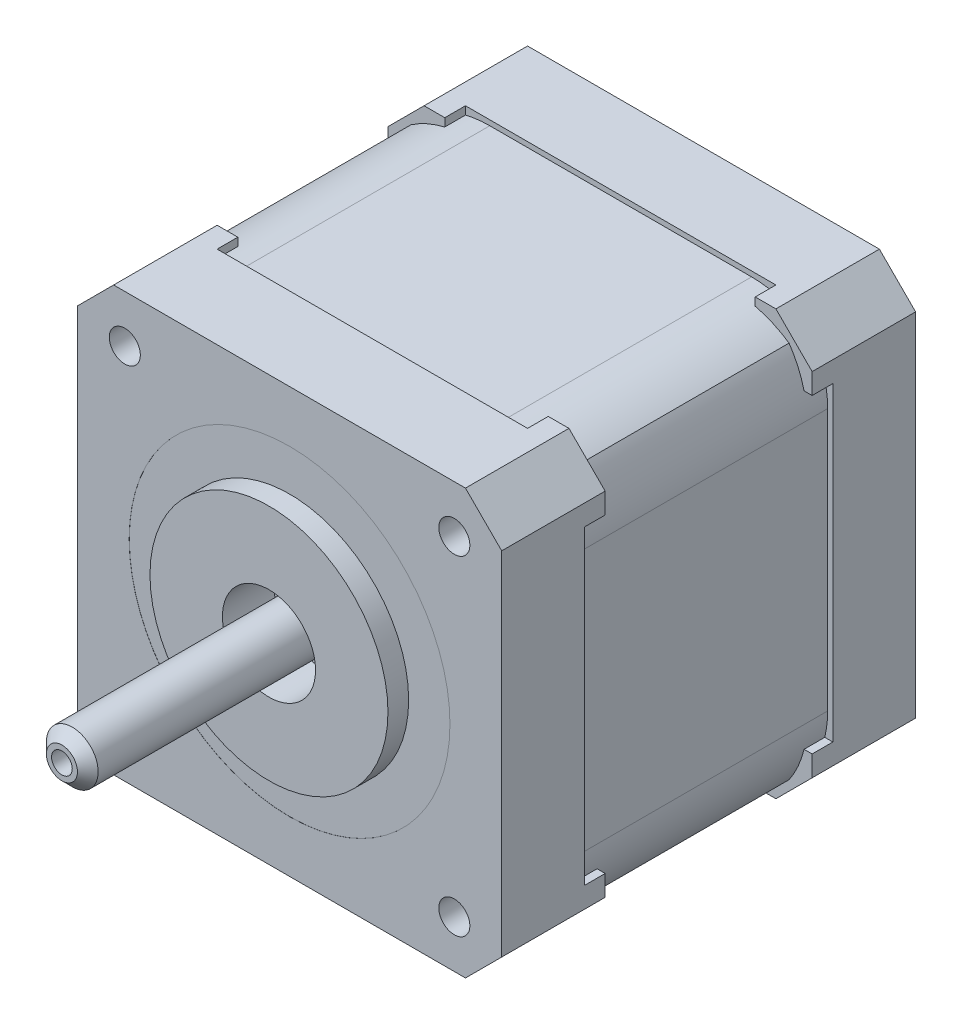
ISO-10303-21;
HEADER;
FILE_DESCRIPTION(('STEP AP214'),'2;1');
FILE_NAME('part.step','',(''),(''),'','','');
FILE_SCHEMA(('AUTOMOTIVE_DESIGN { 1 0 10303 214 1 1 1 1 }'));
ENDSEC;
DATA;
#1=APPLICATION_CONTEXT('core data for automotive mechanical design processes');
#2=APPLICATION_PROTOCOL_DEFINITION('international standard','automotive_design',2000,#1);
#3=PRODUCT_CONTEXT('',#1,'mechanical');
#4=PRODUCT('Part','Part','',(#3));
#5=PRODUCT_RELATED_PRODUCT_CATEGORY('part','',(#4));
#6=PRODUCT_DEFINITION_FORMATION('','',#4);
#7=PRODUCT_DEFINITION_CONTEXT('part definition',#1,'design');
#8=PRODUCT_DEFINITION('design','',#6,#7);
#9=PRODUCT_DEFINITION_SHAPE('','',#8);
#10=(LENGTH_UNIT() NAMED_UNIT(*) SI_UNIT(.MILLI.,.METRE.));
#11=(NAMED_UNIT(*) PLANE_ANGLE_UNIT() SI_UNIT($,.RADIAN.));
#12=(NAMED_UNIT(*) SI_UNIT($,.STERADIAN.) SOLID_ANGLE_UNIT());
#13=UNCERTAINTY_MEASURE_WITH_UNIT(LENGTH_MEASURE(1.E-05),#10,'distance_accuracy_value','');
#14=(GEOMETRIC_REPRESENTATION_CONTEXT(3) GLOBAL_UNCERTAINTY_ASSIGNED_CONTEXT((#13)) GLOBAL_UNIT_ASSIGNED_CONTEXT((#10,
#11,#12)) REPRESENTATION_CONTEXT('',''));
#15=CARTESIAN_POINT('',(0.,0.,0.));
#16=DIRECTION('',(0.,0.,1.));
#17=DIRECTION('',(1.,0.,0.));
#18=AXIS2_PLACEMENT_3D('',#15,#16,#17);
#19=CARTESIAN_POINT('',(15.,5.49999999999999,-31.5));
#20=DIRECTION('',(0.,0.,-1.));
#21=DIRECTION('',(-1.,0.,0.));
#22=AXIS2_PLACEMENT_3D('',#19,#20,#21);
#23=PLANE('',#22);
#24=CARTESIAN_POINT('',(15.,5.49999999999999,-31.5));
#25=DIRECTION('',(0.,0.,-1.));
#26=DIRECTION('',(-1.,0.,0.));
#27=AXIS2_PLACEMENT_3D('',#24,#25,#26);
#28=CIRCLE('',#27,1.50000000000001);
#29=CARTESIAN_POINT('',(13.5,5.49999999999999,-31.5));
#30=VERTEX_POINT('',#29);
#31=EDGE_CURVE('E1667',#30,#30,#28,.T.);
#32=ORIENTED_EDGE('',*,*,#31,.T.);
#33=EDGE_LOOP('',(#32));
#34=FACE_BOUND('',#33,.T.);
#35=DIRECTION('',(0.,1.,0.));
#36=VECTOR('',#35,1.);
#37=CARTESIAN_POINT('',(15.15,0.,-31.5));
#38=LINE('',#37,#36);
#39=CARTESIAN_POINT('',(15.15,5.65,-31.5));
#40=VERTEX_POINT('',#39);
#41=CARTESIAN_POINT('',(15.15,6.5,-31.5));
#42=VERTEX_POINT('',#41);
#43=EDGE_CURVE('E789',#40,#42,#38,.T.);
#44=ORIENTED_EDGE('',*,*,#43,.T.);
#45=DIRECTION('',(-1.,0.,0.));
#46=VECTOR('',#45,1.);
#47=CARTESIAN_POINT('',(0.,6.5,-31.5));
#48=LINE('',#47,#46);
#49=CARTESIAN_POINT('',(14.85,6.5,-31.5));
#50=VERTEX_POINT('',#49);
#51=EDGE_CURVE('E52',#42,#50,#48,.T.);
#52=ORIENTED_EDGE('',*,*,#51,.T.);
#53=DIRECTION('',(0.,1.,0.));
#54=VECTOR('',#53,1.);
#55=CARTESIAN_POINT('',(14.85,0.,-31.5));
#56=LINE('',#55,#54);
#57=CARTESIAN_POINT('',(14.85,5.65,-31.5));
#58=VERTEX_POINT('',#57);
#59=EDGE_CURVE('E759',#58,#50,#56,.T.);
#60=ORIENTED_EDGE('',*,*,#59,.F.);
#61=DIRECTION('',(-1.,0.,0.));
#62=VECTOR('',#61,1.);
#63=CARTESIAN_POINT('',(0.,5.65000000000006,-31.5));
#64=LINE('',#63,#62);
#65=CARTESIAN_POINT('',(14.,5.65,-31.5));
#66=VERTEX_POINT('',#65);
#67=EDGE_CURVE('E762',#58,#66,#64,.T.);
#68=ORIENTED_EDGE('',*,*,#67,.T.);
#69=DIRECTION('',(0.,-1.,0.));
#70=VECTOR('',#69,1.);
#71=CARTESIAN_POINT('',(14.,0.,-31.5));
#72=LINE('',#71,#70);
#73=CARTESIAN_POINT('',(14.,5.35,-31.5));
#74=VERTEX_POINT('',#73);
#75=EDGE_CURVE('E812',#66,#74,#72,.T.);
#76=ORIENTED_EDGE('',*,*,#75,.T.);
#77=DIRECTION('',(-1.,0.,0.));
#78=VECTOR('',#77,1.);
#79=CARTESIAN_POINT('',(0.,5.35000000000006,-31.5));
#80=LINE('',#79,#78);
#81=CARTESIAN_POINT('',(14.85,5.35,-31.5));
#82=VERTEX_POINT('',#81);
#83=EDGE_CURVE('E809',#82,#74,#80,.T.);
#84=ORIENTED_EDGE('',*,*,#83,.F.);
#85=DIRECTION('',(0.,-1.,0.));
#86=VECTOR('',#85,1.);
#87=CARTESIAN_POINT('',(14.85,0.,-31.5));
#88=LINE('',#87,#86);
#89=CARTESIAN_POINT('',(14.85,4.5,-31.5));
#90=VERTEX_POINT('',#89);
#91=EDGE_CURVE('E806',#82,#90,#88,.T.);
#92=ORIENTED_EDGE('',*,*,#91,.T.);
#93=DIRECTION('',(1.,0.,0.));
#94=VECTOR('',#93,1.);
#95=CARTESIAN_POINT('',(0.,4.5,-31.5));
#96=LINE('',#95,#94);
#97=CARTESIAN_POINT('',(15.15,4.5,-31.5));
#98=VERTEX_POINT('',#97);
#99=EDGE_CURVE('E803',#90,#98,#96,.T.);
#100=ORIENTED_EDGE('',*,*,#99,.T.);
#101=DIRECTION('',(0.,-1.,0.));
#102=VECTOR('',#101,1.);
#103=CARTESIAN_POINT('',(15.15,0.,-31.5));
#104=LINE('',#103,#102);
#105=CARTESIAN_POINT('',(15.15,5.35,-31.5));
#106=VERTEX_POINT('',#105);
#107=EDGE_CURVE('E800',#106,#98,#104,.T.);
#108=ORIENTED_EDGE('',*,*,#107,.F.);
#109=DIRECTION('',(1.,0.,0.));
#110=VECTOR('',#109,1.);
#111=CARTESIAN_POINT('',(0.,5.35,-31.5));
#112=LINE('',#111,#110);
#113=CARTESIAN_POINT('',(16.,5.35,-31.5));
#114=VERTEX_POINT('',#113);
#115=EDGE_CURVE('E797',#106,#114,#112,.T.);
#116=ORIENTED_EDGE('',*,*,#115,.T.);
#117=DIRECTION('',(0.,1.,0.));
#118=VECTOR('',#117,1.);
#119=CARTESIAN_POINT('',(16.,0.,-31.5));
#120=LINE('',#119,#118);
#121=CARTESIAN_POINT('',(16.,5.65,-31.5));
#122=VERTEX_POINT('',#121);
#123=EDGE_CURVE('E794',#114,#122,#120,.T.);
#124=ORIENTED_EDGE('',*,*,#123,.T.);
#125=DIRECTION('',(1.,0.,0.));
#126=VECTOR('',#125,1.);
#127=CARTESIAN_POINT('',(0.,5.65,-31.5));
#128=LINE('',#127,#126);
#129=EDGE_CURVE('E791',#40,#122,#128,.T.);
#130=ORIENTED_EDGE('',*,*,#129,.F.);
#131=EDGE_LOOP('',(#44,#52,#60,#68,#76,#84,#92,#100,#108,#116,#124,#130));
#132=FACE_BOUND('',#131,.T.);
#133=ADVANCED_FACE('F37',(#34,#132),#23,.T.);
#134=CARTESIAN_POINT('',(-15.,5.5,-31.5));
#135=DIRECTION('',(0.,0.,1.));
#136=DIRECTION('',(1.,0.,0.));
#137=AXIS2_PLACEMENT_3D('',#134,#135,#136);
#138=PLANE('',#137);
#139=CARTESIAN_POINT('',(-15.,5.5,-31.5));
#140=DIRECTION('',(0.,0.,1.));
#141=DIRECTION('',(1.,0.,0.));
#142=AXIS2_PLACEMENT_3D('',#139,#140,#141);
#143=CIRCLE('',#142,1.5);
#144=CARTESIAN_POINT('',(-13.5,5.5,-31.5));
#145=VERTEX_POINT('',#144);
#146=EDGE_CURVE('E1670',#145,#145,#143,.F.);
#147=ORIENTED_EDGE('',*,*,#146,.T.);
#148=EDGE_LOOP('',(#147));
#149=FACE_BOUND('',#148,.T.);
#150=DIRECTION('',(0.,-1.,0.));
#151=VECTOR('',#150,1.);
#152=CARTESIAN_POINT('',(-15.15,0.,-31.5));
#153=LINE('',#152,#151);
#154=CARTESIAN_POINT('',(-15.15,5.35,-31.5));
#155=VERTEX_POINT('',#154);
#156=CARTESIAN_POINT('',(-15.15,4.5,-31.5));
#157=VERTEX_POINT('',#156);
#158=EDGE_CURVE('E60',#155,#157,#153,.T.);
#159=ORIENTED_EDGE('',*,*,#158,.T.);
#160=DIRECTION('',(-1.,0.,0.));
#161=VECTOR('',#160,1.);
#162=CARTESIAN_POINT('',(0.,4.5,-31.5));
#163=LINE('',#162,#161);
#164=CARTESIAN_POINT('',(-14.85,4.5,-31.5));
#165=VERTEX_POINT('',#164);
#166=EDGE_CURVE('E841',#165,#157,#163,.T.);
#167=ORIENTED_EDGE('',*,*,#166,.F.);
#168=DIRECTION('',(0.,-1.,0.));
#169=VECTOR('',#168,1.);
#170=CARTESIAN_POINT('',(-14.85,0.,-31.5));
#171=LINE('',#170,#169);
#172=CARTESIAN_POINT('',(-14.85,5.35,-31.5));
#173=VERTEX_POINT('',#172);
#174=EDGE_CURVE('E900',#173,#165,#171,.T.);
#175=ORIENTED_EDGE('',*,*,#174,.F.);
#176=DIRECTION('',(1.,0.,0.));
#177=VECTOR('',#176,1.);
#178=CARTESIAN_POINT('',(0.,5.35,-31.5));
#179=LINE('',#178,#177);
#180=CARTESIAN_POINT('',(-14.,5.35,-31.5));
#181=VERTEX_POINT('',#180);
#182=EDGE_CURVE('E897',#173,#181,#179,.T.);
#183=ORIENTED_EDGE('',*,*,#182,.T.);
#184=DIRECTION('',(0.,-1.,0.));
#185=VECTOR('',#184,1.);
#186=CARTESIAN_POINT('',(-14.,0.,-31.5));
#187=LINE('',#186,#185);
#188=CARTESIAN_POINT('',(-14.,5.65,-31.5));
#189=VERTEX_POINT('',#188);
#190=EDGE_CURVE('E894',#189,#181,#187,.T.);
#191=ORIENTED_EDGE('',*,*,#190,.F.);
#192=DIRECTION('',(1.,0.,0.));
#193=VECTOR('',#192,1.);
#194=CARTESIAN_POINT('',(0.,5.65,-31.5));
#195=LINE('',#194,#193);
#196=CARTESIAN_POINT('',(-14.85,5.65,-31.5));
#197=VERTEX_POINT('',#196);
#198=EDGE_CURVE('E891',#197,#189,#195,.T.);
#199=ORIENTED_EDGE('',*,*,#198,.F.);
#200=DIRECTION('',(0.,1.,0.));
#201=VECTOR('',#200,1.);
#202=CARTESIAN_POINT('',(-14.85,0.,-31.5));
#203=LINE('',#202,#201);
#204=CARTESIAN_POINT('',(-14.85,6.5,-31.5));
#205=VERTEX_POINT('',#204);
#206=EDGE_CURVE('E888',#197,#205,#203,.T.);
#207=ORIENTED_EDGE('',*,*,#206,.T.);
#208=DIRECTION('',(1.,0.,0.));
#209=VECTOR('',#208,1.);
#210=CARTESIAN_POINT('',(0.,6.5,-31.5));
#211=LINE('',#210,#209);
#212=CARTESIAN_POINT('',(-15.15,6.5,-31.5));
#213=VERTEX_POINT('',#212);
#214=EDGE_CURVE('E885',#213,#205,#211,.T.);
#215=ORIENTED_EDGE('',*,*,#214,.F.);
#216=DIRECTION('',(0.,1.,0.));
#217=VECTOR('',#216,1.);
#218=CARTESIAN_POINT('',(-15.15,0.,-31.5));
#219=LINE('',#218,#217);
#220=CARTESIAN_POINT('',(-15.15,5.65,-31.5));
#221=VERTEX_POINT('',#220);
#222=EDGE_CURVE('E882',#221,#213,#219,.T.);
#223=ORIENTED_EDGE('',*,*,#222,.F.);
#224=DIRECTION('',(-1.,0.,0.));
#225=VECTOR('',#224,1.);
#226=CARTESIAN_POINT('',(0.,5.65,-31.5));
#227=LINE('',#226,#225);
#228=CARTESIAN_POINT('',(-16.,5.65,-31.5));
#229=VERTEX_POINT('',#228);
#230=EDGE_CURVE('E879',#221,#229,#227,.T.);
#231=ORIENTED_EDGE('',*,*,#230,.T.);
#232=DIRECTION('',(0.,1.,0.));
#233=VECTOR('',#232,1.);
#234=CARTESIAN_POINT('',(-16.,0.,-31.5));
#235=LINE('',#234,#233);
#236=CARTESIAN_POINT('',(-16.,5.35,-31.5));
#237=VERTEX_POINT('',#236);
#238=EDGE_CURVE('E876',#237,#229,#235,.T.);
#239=ORIENTED_EDGE('',*,*,#238,.F.);
#240=DIRECTION('',(-1.,0.,0.));
#241=VECTOR('',#240,1.);
#242=CARTESIAN_POINT('',(0.,5.35,-31.5));
#243=LINE('',#242,#241);
#244=EDGE_CURVE('E873',#155,#237,#243,.T.);
#245=ORIENTED_EDGE('',*,*,#244,.F.);
#246=EDGE_LOOP('',(#159,#167,#175,#183,#191,#199,#207,#215,#223,#231,#239,#245));
#247=FACE_BOUND('',#246,.T.);
#248=ADVANCED_FACE('F1698',(#149,#247),#138,.F.);
#249=CARTESIAN_POINT('',(-15.,35.5,-31.5));
#250=DIRECTION('',(0.,0.,-1.));
#251=DIRECTION('',(-1.,0.,0.));
#252=AXIS2_PLACEMENT_3D('',#249,#250,#251);
#253=PLANE('',#252);
#254=CARTESIAN_POINT('',(-15.,35.5,-31.5));
#255=DIRECTION('',(0.,0.,-1.));
#256=DIRECTION('',(-1.,0.,0.));
#257=AXIS2_PLACEMENT_3D('',#254,#255,#256);
#258=CIRCLE('',#257,1.5);
#259=CARTESIAN_POINT('',(-16.5,35.5,-31.5));
#260=VERTEX_POINT('',#259);
#261=EDGE_CURVE('E1673',#260,#260,#258,.T.);
#262=ORIENTED_EDGE('',*,*,#261,.T.);
#263=EDGE_LOOP('',(#262));
#264=FACE_BOUND('',#263,.T.);
#265=DIRECTION('',(1.,0.,0.));
#266=VECTOR('',#265,1.);
#267=CARTESIAN_POINT('',(0.,35.35,-31.5));
#268=LINE('',#267,#266);
#269=CARTESIAN_POINT('',(-14.85,35.35,-31.5));
#270=VERTEX_POINT('',#269);
#271=CARTESIAN_POINT('',(-14.,35.35,-31.5));
#272=VERTEX_POINT('',#271);
#273=EDGE_CURVE('E961',#270,#272,#268,.T.);
#274=ORIENTED_EDGE('',*,*,#273,.T.);
#275=DIRECTION('',(0.,1.,0.));
#276=VECTOR('',#275,1.);
#277=CARTESIAN_POINT('',(-14.,0.,-31.5));
#278=LINE('',#277,#276);
#279=CARTESIAN_POINT('',(-14.,35.65,-31.5));
#280=VERTEX_POINT('',#279);
#281=EDGE_CURVE('E907',#272,#280,#278,.T.);
#282=ORIENTED_EDGE('',*,*,#281,.T.);
#283=DIRECTION('',(1.,0.,0.));
#284=VECTOR('',#283,1.);
#285=CARTESIAN_POINT('',(0.,35.65,-31.5));
#286=LINE('',#285,#284);
#287=CARTESIAN_POINT('',(-14.85,35.65,-31.5));
#288=VERTEX_POINT('',#287);
#289=EDGE_CURVE('E932',#288,#280,#286,.T.);
#290=ORIENTED_EDGE('',*,*,#289,.F.);
#291=DIRECTION('',(0.,1.,0.));
#292=VECTOR('',#291,1.);
#293=CARTESIAN_POINT('',(-14.85,0.,-31.5));
#294=LINE('',#293,#292);
#295=CARTESIAN_POINT('',(-14.85,36.5,-31.5));
#296=VERTEX_POINT('',#295);
#297=EDGE_CURVE('E988',#288,#296,#294,.T.);
#298=ORIENTED_EDGE('',*,*,#297,.T.);
#299=DIRECTION('',(-1.,0.,0.));
#300=VECTOR('',#299,1.);
#301=CARTESIAN_POINT('',(0.,36.5,-31.5));
#302=LINE('',#301,#300);
#303=CARTESIAN_POINT('',(-15.15,36.5,-31.5));
#304=VERTEX_POINT('',#303);
#305=EDGE_CURVE('E985',#296,#304,#302,.T.);
#306=ORIENTED_EDGE('',*,*,#305,.T.);
#307=DIRECTION('',(0.,1.,0.));
#308=VECTOR('',#307,1.);
#309=CARTESIAN_POINT('',(-15.15,0.,-31.5));
#310=LINE('',#309,#308);
#311=CARTESIAN_POINT('',(-15.15,35.65,-31.5));
#312=VERTEX_POINT('',#311);
#313=EDGE_CURVE('E982',#312,#304,#310,.T.);
#314=ORIENTED_EDGE('',*,*,#313,.F.);
#315=DIRECTION('',(-1.,0.,0.));
#316=VECTOR('',#315,1.);
#317=CARTESIAN_POINT('',(0.,35.65,-31.5));
#318=LINE('',#317,#316);
#319=CARTESIAN_POINT('',(-16.,35.65,-31.5));
#320=VERTEX_POINT('',#319);
#321=EDGE_CURVE('E979',#312,#320,#318,.T.);
#322=ORIENTED_EDGE('',*,*,#321,.T.);
#323=DIRECTION('',(0.,-1.,0.));
#324=VECTOR('',#323,1.);
#325=CARTESIAN_POINT('',(-16.,0.,-31.5));
#326=LINE('',#325,#324);
#327=CARTESIAN_POINT('',(-16.,35.35,-31.5));
#328=VERTEX_POINT('',#327);
#329=EDGE_CURVE('E976',#320,#328,#326,.T.);
#330=ORIENTED_EDGE('',*,*,#329,.T.);
#331=DIRECTION('',(-1.,0.,0.));
#332=VECTOR('',#331,1.);
#333=CARTESIAN_POINT('',(0.,35.35,-31.5));
#334=LINE('',#333,#332);
#335=CARTESIAN_POINT('',(-15.15,35.35,-31.5));
#336=VERTEX_POINT('',#335);
#337=EDGE_CURVE('E973',#336,#328,#334,.T.);
#338=ORIENTED_EDGE('',*,*,#337,.F.);
#339=DIRECTION('',(0.,-1.,0.));
#340=VECTOR('',#339,1.);
#341=CARTESIAN_POINT('',(-15.15,0.,-31.5));
#342=LINE('',#341,#340);
#343=CARTESIAN_POINT('',(-15.15,34.5,-31.5));
#344=VERTEX_POINT('',#343);
#345=EDGE_CURVE('E970',#336,#344,#342,.T.);
#346=ORIENTED_EDGE('',*,*,#345,.T.);
#347=DIRECTION('',(1.,0.,0.));
#348=VECTOR('',#347,1.);
#349=CARTESIAN_POINT('',(0.,34.5,-31.5));
#350=LINE('',#349,#348);
#351=CARTESIAN_POINT('',(-14.85,34.5,-31.5));
#352=VERTEX_POINT('',#351);
#353=EDGE_CURVE('E967',#344,#352,#350,.T.);
#354=ORIENTED_EDGE('',*,*,#353,.T.);
#355=DIRECTION('',(0.,-1.,0.));
#356=VECTOR('',#355,1.);
#357=CARTESIAN_POINT('',(-14.85,0.,-31.5));
#358=LINE('',#357,#356);
#359=EDGE_CURVE('E964',#270,#352,#358,.T.);
#360=ORIENTED_EDGE('',*,*,#359,.F.);
#361=EDGE_LOOP('',(#274,#282,#290,#298,#306,#314,#322,#330,#338,#346,#354,#360));
#362=FACE_BOUND('',#361,.T.);
#363=ADVANCED_FACE('F1704',(#264,#362),#253,.T.);
#364=CARTESIAN_POINT('',(15.,35.5,-31.5));
#365=DIRECTION('',(0.,0.,1.));
#366=DIRECTION('',(1.,0.,0.));
#367=AXIS2_PLACEMENT_3D('',#364,#365,#366);
#368=PLANE('',#367);
#369=CARTESIAN_POINT('',(15.,35.5,-31.5));
#370=DIRECTION('',(0.,0.,1.));
#371=DIRECTION('',(1.,0.,0.));
#372=AXIS2_PLACEMENT_3D('',#369,#370,#371);
#373=CIRCLE('',#372,1.5);
#374=CARTESIAN_POINT('',(16.5,35.5,-31.5));
#375=VERTEX_POINT('',#374);
#376=EDGE_CURVE('E1676',#375,#375,#373,.F.);
#377=ORIENTED_EDGE('',*,*,#376,.T.);
#378=EDGE_LOOP('',(#377));
#379=FACE_BOUND('',#378,.T.);
#380=DIRECTION('',(0.,1.,0.));
#381=VECTOR('',#380,1.);
#382=CARTESIAN_POINT('',(15.15,0.,-31.5));
#383=LINE('',#382,#381);
#384=CARTESIAN_POINT('',(15.15,35.65,-31.5));
#385=VERTEX_POINT('',#384);
#386=CARTESIAN_POINT('',(15.15,36.5,-31.5));
#387=VERTEX_POINT('',#386);
#388=EDGE_CURVE('E995',#385,#387,#383,.T.);
#389=ORIENTED_EDGE('',*,*,#388,.T.);
#390=DIRECTION('',(1.,0.,0.));
#391=VECTOR('',#390,1.);
#392=CARTESIAN_POINT('',(0.,36.5,-31.5));
#393=LINE('',#392,#391);
#394=CARTESIAN_POINT('',(14.85,36.5,-31.5));
#395=VERTEX_POINT('',#394);
#396=EDGE_CURVE('E1021',#395,#387,#393,.T.);
#397=ORIENTED_EDGE('',*,*,#396,.F.);
#398=DIRECTION('',(0.,1.,0.));
#399=VECTOR('',#398,1.);
#400=CARTESIAN_POINT('',(14.85,0.,-31.5));
#401=LINE('',#400,#399);
#402=CARTESIAN_POINT('',(14.85,35.65,-31.5));
#403=VERTEX_POINT('',#402);
#404=EDGE_CURVE('E1081',#403,#395,#401,.T.);
#405=ORIENTED_EDGE('',*,*,#404,.F.);
#406=DIRECTION('',(-1.,0.,0.));
#407=VECTOR('',#406,1.);
#408=CARTESIAN_POINT('',(0.,35.65,-31.5));
#409=LINE('',#408,#407);
#410=CARTESIAN_POINT('',(14.,35.65,-31.5));
#411=VERTEX_POINT('',#410);
#412=EDGE_CURVE('E1078',#403,#411,#409,.T.);
#413=ORIENTED_EDGE('',*,*,#412,.T.);
#414=DIRECTION('',(0.,1.,0.));
#415=VECTOR('',#414,1.);
#416=CARTESIAN_POINT('',(14.,0.,-31.5));
#417=LINE('',#416,#415);
#418=CARTESIAN_POINT('',(14.,35.35,-31.5));
#419=VERTEX_POINT('',#418);
#420=EDGE_CURVE('E1075',#419,#411,#417,.T.);
#421=ORIENTED_EDGE('',*,*,#420,.F.);
#422=DIRECTION('',(-1.,0.,0.));
#423=VECTOR('',#422,1.);
#424=CARTESIAN_POINT('',(0.,35.35,-31.5));
#425=LINE('',#424,#423);
#426=CARTESIAN_POINT('',(14.85,35.35,-31.5));
#427=VERTEX_POINT('',#426);
#428=EDGE_CURVE('E1072',#427,#419,#425,.T.);
#429=ORIENTED_EDGE('',*,*,#428,.F.);
#430=DIRECTION('',(0.,-1.,0.));
#431=VECTOR('',#430,1.);
#432=CARTESIAN_POINT('',(14.8499999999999,0.,-31.5));
#433=LINE('',#432,#431);
#434=CARTESIAN_POINT('',(14.85,34.5,-31.5));
#435=VERTEX_POINT('',#434);
#436=EDGE_CURVE('E1069',#427,#435,#433,.T.);
#437=ORIENTED_EDGE('',*,*,#436,.T.);
#438=DIRECTION('',(-1.,0.,0.));
#439=VECTOR('',#438,1.);
#440=CARTESIAN_POINT('',(0.,34.5,-31.5));
#441=LINE('',#440,#439);
#442=CARTESIAN_POINT('',(15.15,34.5,-31.5));
#443=VERTEX_POINT('',#442);
#444=EDGE_CURVE('E1066',#443,#435,#441,.T.);
#445=ORIENTED_EDGE('',*,*,#444,.F.);
#446=DIRECTION('',(0.,-1.,0.));
#447=VECTOR('',#446,1.);
#448=CARTESIAN_POINT('',(15.1499999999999,0.,-31.5));
#449=LINE('',#448,#447);
#450=CARTESIAN_POINT('',(15.15,35.35,-31.5));
#451=VERTEX_POINT('',#450);
#452=EDGE_CURVE('E1063',#451,#443,#449,.T.);
#453=ORIENTED_EDGE('',*,*,#452,.F.);
#454=DIRECTION('',(1.,0.,0.));
#455=VECTOR('',#454,1.);
#456=CARTESIAN_POINT('',(0.,35.35,-31.5));
#457=LINE('',#456,#455);
#458=CARTESIAN_POINT('',(16.,35.35,-31.5));
#459=VERTEX_POINT('',#458);
#460=EDGE_CURVE('E1060',#451,#459,#457,.T.);
#461=ORIENTED_EDGE('',*,*,#460,.T.);
#462=DIRECTION('',(0.,-1.,0.));
#463=VECTOR('',#462,1.);
#464=CARTESIAN_POINT('',(16.,0.,-31.5));
#465=LINE('',#464,#463);
#466=CARTESIAN_POINT('',(16.,35.65,-31.5));
#467=VERTEX_POINT('',#466);
#468=EDGE_CURVE('E1057',#467,#459,#465,.T.);
#469=ORIENTED_EDGE('',*,*,#468,.F.);
#470=DIRECTION('',(1.,0.,0.));
#471=VECTOR('',#470,1.);
#472=CARTESIAN_POINT('',(0.,35.65,-31.5));
#473=LINE('',#472,#471);
#474=EDGE_CURVE('E1054',#385,#467,#473,.T.);
#475=ORIENTED_EDGE('',*,*,#474,.F.);
#476=EDGE_LOOP('',(#389,#397,#405,#413,#421,#429,#437,#445,#453,#461,#469,#475));
#477=FACE_BOUND('',#476,.T.);
#478=ADVANCED_FACE('F1712',(#379,#477),#368,.F.);
#479=CARTESIAN_POINT('',(0.,0.,-24.));
#480=DIRECTION('',(0.,0.,-1.));
#481=DIRECTION('',(-1.,0.,0.));
#482=AXIS2_PLACEMENT_3D('',#479,#480,#481);
#483=PLANE('',#482);
#484=DIRECTION('',(0.,-1.,0.));
#485=VECTOR('',#484,1.);
#486=CARTESIAN_POINT('',(14.9999999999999,0.,-24.));
#487=LINE('',#486,#485);
#488=CARTESIAN_POINT('',(15.,41.,-24.));
#489=VERTEX_POINT('',#488);
#490=CARTESIAN_POINT('',(15.,40.2201368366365,-24.));
#491=VERTEX_POINT('',#490);
#492=EDGE_CURVE('E1198',#489,#491,#487,.T.);
#493=ORIENTED_EDGE('',*,*,#492,.F.);
#494=DIRECTION('',(1.,0.,0.));
#495=VECTOR('',#494,1.);
#496=CARTESIAN_POINT('',(-17.,41.,-24.));
#497=LINE('',#496,#495);
#498=CARTESIAN_POINT('',(-15.,41.,-24.));
#499=VERTEX_POINT('',#498);
#500=EDGE_CURVE('E1284',#499,#489,#497,.T.);
#501=ORIENTED_EDGE('',*,*,#500,.F.);
#502=DIRECTION('',(0.,-1.,0.));
#503=VECTOR('',#502,1.);
#504=CARTESIAN_POINT('',(-14.9999999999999,0.,-24.));
#505=LINE('',#504,#503);
#506=CARTESIAN_POINT('',(-15.,40.2201368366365,-24.));
#507=VERTEX_POINT('',#506);
#508=EDGE_CURVE('E1263',#499,#507,#505,.T.);
#509=ORIENTED_EDGE('',*,*,#508,.T.);
#510=CARTESIAN_POINT('',(-12.6507575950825,30.5,-24.));
#511=DIRECTION('',(0.,0.,-1.));
#512=DIRECTION('',(-1.,0.,0.));
#513=AXIS2_PLACEMENT_3D('',#510,#511,#512);
#514=CIRCLE('',#513,10.);
#515=CARTESIAN_POINT('',(-12.6507575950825,40.5,-24.));
#516=VERTEX_POINT('',#515);
#517=EDGE_CURVE('E1577',#507,#516,#514,.T.);
#518=ORIENTED_EDGE('',*,*,#517,.T.);
#519=DIRECTION('',(1.,0.,0.));
#520=VECTOR('',#519,1.);
#521=CARTESIAN_POINT('',(0.,40.5,-24.));
#522=LINE('',#521,#520);
#523=CARTESIAN_POINT('',(12.6507575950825,40.5,-24.));
#524=VERTEX_POINT('',#523);
#525=EDGE_CURVE('E1327',#516,#524,#522,.T.);
#526=ORIENTED_EDGE('',*,*,#525,.T.);
#527=CARTESIAN_POINT('',(12.6507575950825,30.5,-24.));
#528=DIRECTION('',(0.,0.,-1.));
#529=DIRECTION('',(-1.,0.,0.));
#530=AXIS2_PLACEMENT_3D('',#527,#528,#529);
#531=CIRCLE('',#530,10.);
#532=EDGE_CURVE('E1587',#524,#491,#531,.T.);
#533=ORIENTED_EDGE('',*,*,#532,.T.);
#534=EDGE_LOOP('',(#493,#501,#509,#518,#526,#533));
#535=FACE_BOUND('',#534,.T.);
#536=ADVANCED_FACE('F1854',(#535),#483,.F.);
#537=CARTESIAN_POINT('',(0.,40.5,-24.));
#538=DIRECTION('',(0.,-1.,0.));
#539=DIRECTION('',(0.,0.,-1.));
#540=AXIS2_PLACEMENT_3D('',#537,#538,#539);
#541=PLANE('',#540);
#542=ORIENTED_EDGE('',*,*,#525,.F.);
#543=DIRECTION('',(0.,0.,1.));
#544=VECTOR('',#543,1.);
#545=CARTESIAN_POINT('',(-12.6507575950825,40.5,-24.));
#546=LINE('',#545,#544);
#547=CARTESIAN_POINT('',(-12.6507575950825,40.5,0.));
#548=VERTEX_POINT('',#547);
#549=EDGE_CURVE('E3365',#516,#548,#546,.T.);
#550=ORIENTED_EDGE('',*,*,#549,.T.);
#551=DIRECTION('',(1.,0.,0.));
#552=VECTOR('',#551,1.);
#553=CARTESIAN_POINT('',(0.,40.5,0.));
#554=LINE('',#553,#552);
#555=CARTESIAN_POINT('',(12.6507575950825,40.5,0.));
#556=VERTEX_POINT('',#555);
#557=EDGE_CURVE('E1326',#548,#556,#554,.T.);
#558=ORIENTED_EDGE('',*,*,#557,.T.);
#559=DIRECTION('',(0.,0.,1.));
#560=VECTOR('',#559,1.);
#561=CARTESIAN_POINT('',(12.6507575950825,40.5,-24.));
#562=LINE('',#561,#560);
#563=EDGE_CURVE('E3369',#556,#524,#562,.F.);
#564=ORIENTED_EDGE('',*,*,#563,.T.);
#565=EDGE_LOOP('',(#542,#550,#558,#564));
#566=FACE_BOUND('',#565,.T.);
#567=ADVANCED_FACE('F1900',(#566),#541,.F.);
#568=DIRECTION('',(0.,-1.,0.));
#569=VECTOR('',#568,1.);
#570=CARTESIAN_POINT('',(20.5,37.5,-24.));
#571=LINE('',#570,#569);
#572=CARTESIAN_POINT('',(20.5,35.5,-24.));
#573=VERTEX_POINT('',#572);
#574=CARTESIAN_POINT('',(20.5,5.50000000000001,-24.));
#575=VERTEX_POINT('',#574);
#576=EDGE_CURVE('E1306',#573,#575,#571,.T.);
#577=ORIENTED_EDGE('',*,*,#576,.F.);
#578=DIRECTION('',(-1.,0.,0.));
#579=VECTOR('',#578,1.);
#580=CARTESIAN_POINT('',(0.,35.5,-24.));
#581=LINE('',#580,#579);
#582=CARTESIAN_POINT('',(19.7201368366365,35.5,-24.));
#583=VERTEX_POINT('',#582);
#584=EDGE_CURVE('E1209',#573,#583,#581,.T.);
#585=ORIENTED_EDGE('',*,*,#584,.T.);
#586=CARTESIAN_POINT('',(10.,33.1507575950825,-24.));
#587=DIRECTION('',(0.,0.,-1.));
#588=DIRECTION('',(-1.,0.,0.));
#589=AXIS2_PLACEMENT_3D('',#586,#587,#588);
#590=CIRCLE('',#589,10.);
#591=CARTESIAN_POINT('',(20.,33.1507575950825,-24.));
#592=VERTEX_POINT('',#591);
#593=EDGE_CURVE('E1609',#583,#592,#590,.T.);
#594=ORIENTED_EDGE('',*,*,#593,.T.);
#595=DIRECTION('',(0.,-1.,0.));
#596=VECTOR('',#595,1.);
#597=CARTESIAN_POINT('',(20.,0.,-24.));
#598=LINE('',#597,#596);
#599=CARTESIAN_POINT('',(20.,7.84924240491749,-24.));
#600=VERTEX_POINT('',#599);
#601=EDGE_CURVE('E1330',#592,#600,#598,.T.);
#602=ORIENTED_EDGE('',*,*,#601,.T.);
#603=CARTESIAN_POINT('',(10.,7.84924240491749,-24.));
#604=DIRECTION('',(0.,0.,-1.));
#605=DIRECTION('',(-1.,0.,0.));
#606=AXIS2_PLACEMENT_3D('',#603,#604,#605);
#607=CIRCLE('',#606,10.);
#608=CARTESIAN_POINT('',(19.7201368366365,5.50000000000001,-24.));
#609=VERTEX_POINT('',#608);
#610=EDGE_CURVE('E1619',#600,#609,#607,.T.);
#611=ORIENTED_EDGE('',*,*,#610,.T.);
#612=DIRECTION('',(-1.,0.,0.));
#613=VECTOR('',#612,1.);
#614=CARTESIAN_POINT('',(0.,5.50000000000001,-24.));
#615=LINE('',#614,#613);
#616=EDGE_CURVE('E1217',#575,#609,#615,.T.);
#617=ORIENTED_EDGE('',*,*,#616,.F.);
#618=EDGE_LOOP('',(#577,#585,#594,#602,#611,#617));
#619=FACE_BOUND('',#618,.T.);
#620=ADVANCED_FACE('F1898',(#619),#483,.F.);
#621=CARTESIAN_POINT('',(20.,0.,-24.));
#622=DIRECTION('',(-1.,0.,0.));
#623=DIRECTION('',(0.,0.,1.));
#624=AXIS2_PLACEMENT_3D('',#621,#622,#623);
#625=PLANE('',#624);
#626=ORIENTED_EDGE('',*,*,#601,.F.);
#627=DIRECTION('',(0.,0.,1.));
#628=VECTOR('',#627,1.);
#629=CARTESIAN_POINT('',(20.,33.1507575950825,-24.));
#630=LINE('',#629,#628);
#631=CARTESIAN_POINT('',(20.,33.1507575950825,0.));
#632=VERTEX_POINT('',#631);
#633=EDGE_CURVE('E3358',#592,#632,#630,.T.);
#634=ORIENTED_EDGE('',*,*,#633,.T.);
#635=DIRECTION('',(0.,-1.,0.));
#636=VECTOR('',#635,1.);
#637=CARTESIAN_POINT('',(20.,0.,0.));
#638=LINE('',#637,#636);
#639=CARTESIAN_POINT('',(20.,7.84924240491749,0.));
#640=VERTEX_POINT('',#639);
#641=EDGE_CURVE('E1343',#632,#640,#638,.T.);
#642=ORIENTED_EDGE('',*,*,#641,.T.);
#643=DIRECTION('',(0.,0.,1.));
#644=VECTOR('',#643,1.);
#645=CARTESIAN_POINT('',(20.,7.84924240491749,-24.));
#646=LINE('',#645,#644);
#647=EDGE_CURVE('E3363',#640,#600,#646,.F.);
#648=ORIENTED_EDGE('',*,*,#647,.T.);
#649=EDGE_LOOP('',(#626,#634,#642,#648));
#650=FACE_BOUND('',#649,.T.);
#651=ADVANCED_FACE('F1894',(#650),#625,.F.);
#652=CARTESIAN_POINT('',(0.,0.5,-24.));
#653=DIRECTION('',(0.,1.,0.));
#654=DIRECTION('',(0.,0.,1.));
#655=AXIS2_PLACEMENT_3D('',#652,#653,#654);
#656=PLANE('',#655);
#657=DIRECTION('',(-1.,0.,0.));
#658=VECTOR('',#657,1.);
#659=CARTESIAN_POINT('',(0.,0.5,0.));
#660=LINE('',#659,#658);
#661=CARTESIAN_POINT('',(12.6507575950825,0.5,0.));
#662=VERTEX_POINT('',#661);
#663=CARTESIAN_POINT('',(-12.6507575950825,0.5,0.));
#664=VERTEX_POINT('',#663);
#665=EDGE_CURVE('E1346',#662,#664,#660,.T.);
#666=ORIENTED_EDGE('',*,*,#665,.T.);
#667=DIRECTION('',(0.,0.,1.));
#668=VECTOR('',#667,1.);
#669=CARTESIAN_POINT('',(-12.6507575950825,0.5,-24.));
#670=LINE('',#669,#668);
#671=CARTESIAN_POINT('',(-12.6507575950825,0.5,-24.));
#672=VERTEX_POINT('',#671);
#673=EDGE_CURVE('E1501',#664,#672,#670,.F.);
#674=ORIENTED_EDGE('',*,*,#673,.T.);
#675=DIRECTION('',(-1.,0.,0.));
#676=VECTOR('',#675,1.);
#677=CARTESIAN_POINT('',(0.,0.5,-24.));
#678=LINE('',#677,#676);
#679=CARTESIAN_POINT('',(12.6507575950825,0.5,-24.));
#680=VERTEX_POINT('',#679);
#681=EDGE_CURVE('E1334',#680,#672,#678,.T.);
#682=ORIENTED_EDGE('',*,*,#681,.F.);
#683=DIRECTION('',(0.,0.,1.));
#684=VECTOR('',#683,1.);
#685=CARTESIAN_POINT('',(12.6507575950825,0.5,-24.));
#686=LINE('',#685,#684);
#687=EDGE_CURVE('E1442',#680,#662,#686,.T.);
#688=ORIENTED_EDGE('',*,*,#687,.T.);
#689=EDGE_LOOP('',(#666,#674,#682,#688));
#690=FACE_BOUND('',#689,.T.);
#691=ADVANCED_FACE('F1891',(#690),#656,.F.);
#692=DIRECTION('',(-1.,0.,0.));
#693=VECTOR('',#692,1.);
#694=CARTESIAN_POINT('',(17.,0.,-24.));
#695=LINE('',#694,#693);
#696=CARTESIAN_POINT('',(15.,0.,-24.));
#697=VERTEX_POINT('',#696);
#698=CARTESIAN_POINT('',(-15.,0.,-24.));
#699=VERTEX_POINT('',#698);
#700=EDGE_CURVE('E1308',#697,#699,#695,.T.);
#701=ORIENTED_EDGE('',*,*,#700,.F.);
#702=DIRECTION('',(0.,1.,0.));
#703=VECTOR('',#702,1.);
#704=CARTESIAN_POINT('',(15.,0.,-24.));
#705=LINE('',#704,#703);
#706=CARTESIAN_POINT('',(15.,0.779863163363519,-24.));
#707=VERTEX_POINT('',#706);
#708=EDGE_CURVE('E1222',#697,#707,#705,.T.);
#709=ORIENTED_EDGE('',*,*,#708,.T.);
#710=CARTESIAN_POINT('',(12.6507575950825,10.5,-24.));
#711=DIRECTION('',(0.,0.,-1.));
#712=DIRECTION('',(-1.,0.,0.));
#713=AXIS2_PLACEMENT_3D('',#710,#711,#712);
#714=CIRCLE('',#713,10.);
#715=EDGE_CURVE('E1641',#707,#680,#714,.T.);
#716=ORIENTED_EDGE('',*,*,#715,.T.);
#717=ORIENTED_EDGE('',*,*,#681,.T.);
#718=CARTESIAN_POINT('',(-12.6507575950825,10.5,-24.));
#719=DIRECTION('',(0.,0.,-1.));
#720=DIRECTION('',(-1.,0.,0.));
#721=AXIS2_PLACEMENT_3D('',#718,#719,#720);
#722=CIRCLE('',#721,10.);
#723=CARTESIAN_POINT('',(-15.,0.779863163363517,-24.));
#724=VERTEX_POINT('',#723);
#725=EDGE_CURVE('E3380',#672,#724,#722,.T.);
#726=ORIENTED_EDGE('',*,*,#725,.T.);
#727=DIRECTION('',(0.,1.,0.));
#728=VECTOR('',#727,1.);
#729=CARTESIAN_POINT('',(-15.,0.,-24.));
#730=LINE('',#729,#728);
#731=EDGE_CURVE('E1240',#699,#724,#730,.T.);
#732=ORIENTED_EDGE('',*,*,#731,.F.);
#733=EDGE_LOOP('',(#701,#709,#716,#717,#726,#732));
#734=FACE_BOUND('',#733,.T.);
#735=ADVANCED_FACE('F1855',(#734),#483,.F.);
#736=CARTESIAN_POINT('',(-20.,0.,-24.));
#737=DIRECTION('',(1.,0.,0.));
#738=DIRECTION('',(0.,0.,-1.));
#739=AXIS2_PLACEMENT_3D('',#736,#737,#738);
#740=PLANE('',#739);
#741=DIRECTION('',(0.,1.,0.));
#742=VECTOR('',#741,1.);
#743=CARTESIAN_POINT('',(-20.,0.,-24.));
#744=LINE('',#743,#742);
#745=CARTESIAN_POINT('',(-20.,7.84924240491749,-24.));
#746=VERTEX_POINT('',#745);
#747=CARTESIAN_POINT('',(-20.,33.1507575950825,-24.));
#748=VERTEX_POINT('',#747);
#749=EDGE_CURVE('E1337',#746,#748,#744,.T.);
#750=ORIENTED_EDGE('',*,*,#749,.F.);
#751=DIRECTION('',(0.,0.,1.));
#752=VECTOR('',#751,1.);
#753=CARTESIAN_POINT('',(-20.,7.84924240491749,-24.));
#754=LINE('',#753,#752);
#755=CARTESIAN_POINT('',(-20.,7.84924240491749,0.));
#756=VERTEX_POINT('',#755);
#757=EDGE_CURVE('E3405',#746,#756,#754,.T.);
#758=ORIENTED_EDGE('',*,*,#757,.T.);
#759=DIRECTION('',(0.,1.,0.));
#760=VECTOR('',#759,1.);
#761=CARTESIAN_POINT('',(-20.,0.,0.));
#762=LINE('',#761,#760);
#763=CARTESIAN_POINT('',(-20.,33.1507575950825,0.));
#764=VERTEX_POINT('',#763);
#765=EDGE_CURVE('E1331',#756,#764,#762,.T.);
#766=ORIENTED_EDGE('',*,*,#765,.T.);
#767=DIRECTION('',(0.,0.,1.));
#768=VECTOR('',#767,1.);
#769=CARTESIAN_POINT('',(-20.,33.1507575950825,-24.));
#770=LINE('',#769,#768);
#771=EDGE_CURVE('E3411',#764,#748,#770,.F.);
#772=ORIENTED_EDGE('',*,*,#771,.T.);
#773=EDGE_LOOP('',(#750,#758,#766,#772));
#774=FACE_BOUND('',#773,.T.);
#775=ADVANCED_FACE('F1886',(#774),#740,.F.);
#776=CARTESIAN_POINT('',(0.,0.,0.));
#777=DIRECTION('',(0.,0.,-1.));
#778=DIRECTION('',(-1.,0.,0.));
#779=AXIS2_PLACEMENT_3D('',#776,#777,#778);
#780=PLANE('',#779);
#781=DIRECTION('',(0.,-1.,0.));
#782=VECTOR('',#781,1.);
#783=CARTESIAN_POINT('',(15.0000000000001,0.,0.));
#784=LINE('',#783,#782);
#785=CARTESIAN_POINT('',(15.,41.,0.));
#786=VERTEX_POINT('',#785);
#787=CARTESIAN_POINT('',(15.,40.2201368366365,0.));
#788=VERTEX_POINT('',#787);
#789=EDGE_CURVE('E1413',#786,#788,#784,.T.);
#790=ORIENTED_EDGE('',*,*,#789,.T.);
#791=CARTESIAN_POINT('',(12.6507575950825,30.5,0.));
#792=DIRECTION('',(0.,0.,-1.));
#793=DIRECTION('',(-1.,0.,0.));
#794=AXIS2_PLACEMENT_3D('',#791,#792,#793);
#795=CIRCLE('',#794,10.);
#796=EDGE_CURVE('E1585',#788,#556,#795,.F.);
#797=ORIENTED_EDGE('',*,*,#796,.T.);
#798=ORIENTED_EDGE('',*,*,#557,.F.);
#799=CARTESIAN_POINT('',(-12.6507575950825,30.5,0.));
#800=DIRECTION('',(0.,0.,-1.));
#801=DIRECTION('',(-1.,0.,0.));
#802=AXIS2_PLACEMENT_3D('',#799,#800,#801);
#803=CIRCLE('',#802,10.);
#804=CARTESIAN_POINT('',(-15.,40.2201368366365,0.));
#805=VERTEX_POINT('',#804);
#806=EDGE_CURVE('E1569',#548,#805,#803,.F.);
#807=ORIENTED_EDGE('',*,*,#806,.T.);
#808=DIRECTION('',(0.,-1.,0.));
#809=VECTOR('',#808,1.);
#810=CARTESIAN_POINT('',(-15.0000000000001,0.,0.));
#811=LINE('',#810,#809);
#812=CARTESIAN_POINT('',(-15.,41.,0.));
#813=VERTEX_POINT('',#812);
#814=EDGE_CURVE('E1397',#813,#805,#811,.T.);
#815=ORIENTED_EDGE('',*,*,#814,.F.);
#816=DIRECTION('',(-1.,0.,0.));
#817=VECTOR('',#816,1.);
#818=CARTESIAN_POINT('',(-17.,41.,0.));
#819=LINE('',#818,#817);
#820=EDGE_CURVE('E1440',#786,#813,#819,.T.);
#821=ORIENTED_EDGE('',*,*,#820,.F.);
#822=EDGE_LOOP('',(#790,#797,#798,#807,#815,#821));
#823=FACE_BOUND('',#822,.T.);
#824=ADVANCED_FACE('F1889',(#823),#780,.T.);
#825=DIRECTION('',(-1.,0.,0.));
#826=VECTOR('',#825,1.);
#827=CARTESIAN_POINT('',(0.,5.5,0.));
#828=LINE('',#827,#826);
#829=CARTESIAN_POINT('',(20.5,5.5,0.));
#830=VERTEX_POINT('',#829);
#831=CARTESIAN_POINT('',(19.7201368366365,5.5,0.));
#832=VERTEX_POINT('',#831);
#833=EDGE_CURVE('E1340',#830,#832,#828,.T.);
#834=ORIENTED_EDGE('',*,*,#833,.T.);
#835=CARTESIAN_POINT('',(10.,7.84924240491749,0.));
#836=DIRECTION('',(0.,0.,-1.));
#837=DIRECTION('',(-1.,0.,0.));
#838=AXIS2_PLACEMENT_3D('',#835,#836,#837);
#839=CIRCLE('',#838,10.);
#840=EDGE_CURVE('E1617',#832,#640,#839,.F.);
#841=ORIENTED_EDGE('',*,*,#840,.T.);
#842=ORIENTED_EDGE('',*,*,#641,.F.);
#843=CARTESIAN_POINT('',(10.,33.1507575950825,0.));
#844=DIRECTION('',(0.,0.,-1.));
#845=DIRECTION('',(-1.,0.,0.));
#846=AXIS2_PLACEMENT_3D('',#843,#844,#845);
#847=CIRCLE('',#846,10.);
#848=CARTESIAN_POINT('',(19.7201368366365,35.5,0.));
#849=VERTEX_POINT('',#848);
#850=EDGE_CURVE('E1595',#632,#849,#847,.F.);
#851=ORIENTED_EDGE('',*,*,#850,.T.);
#852=DIRECTION('',(-1.,0.,0.));
#853=VECTOR('',#852,1.);
#854=CARTESIAN_POINT('',(0.,35.5,0.));
#855=LINE('',#854,#853);
#856=CARTESIAN_POINT('',(20.5,35.5,0.));
#857=VERTEX_POINT('',#856);
#858=EDGE_CURVE('E1417',#857,#849,#855,.T.);
#859=ORIENTED_EDGE('',*,*,#858,.F.);
#860=DIRECTION('',(0.,1.,0.));
#861=VECTOR('',#860,1.);
#862=CARTESIAN_POINT('',(20.5,3.5,0.));
#863=LINE('',#862,#861);
#864=EDGE_CURVE('E1437',#830,#857,#863,.T.);
#865=ORIENTED_EDGE('',*,*,#864,.F.);
#866=EDGE_LOOP('',(#834,#841,#842,#851,#859,#865));
#867=FACE_BOUND('',#866,.T.);
#868=ADVANCED_FACE('F1952',(#867),#780,.T.);
#869=DIRECTION('',(0.,1.,0.));
#870=VECTOR('',#869,1.);
#871=CARTESIAN_POINT('',(-15.,0.,0.));
#872=LINE('',#871,#870);
#873=CARTESIAN_POINT('',(-15.,0.,0.));
#874=VERTEX_POINT('',#873);
#875=CARTESIAN_POINT('',(-15.,0.779863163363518,0.));
#876=VERTEX_POINT('',#875);
#877=EDGE_CURVE('E1376',#874,#876,#872,.T.);
#878=ORIENTED_EDGE('',*,*,#877,.T.);
#879=CARTESIAN_POINT('',(-12.6507575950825,10.5,0.));
#880=DIRECTION('',(0.,0.,-1.));
#881=DIRECTION('',(-1.,0.,0.));
#882=AXIS2_PLACEMENT_3D('',#879,#880,#881);
#883=CIRCLE('',#882,10.);
#884=EDGE_CURVE('E3378',#876,#664,#883,.F.);
#885=ORIENTED_EDGE('',*,*,#884,.T.);
#886=ORIENTED_EDGE('',*,*,#665,.F.);
#887=CARTESIAN_POINT('',(12.6507575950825,10.5,0.));
#888=DIRECTION('',(0.,0.,-1.));
#889=DIRECTION('',(-1.,0.,0.));
#890=AXIS2_PLACEMENT_3D('',#887,#888,#889);
#891=CIRCLE('',#890,10.);
#892=CARTESIAN_POINT('',(15.,0.779863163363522,0.));
#893=VERTEX_POINT('',#892);
#894=EDGE_CURVE('E1627',#662,#893,#891,.F.);
#895=ORIENTED_EDGE('',*,*,#894,.T.);
#896=DIRECTION('',(0.,1.,0.));
#897=VECTOR('',#896,1.);
#898=CARTESIAN_POINT('',(15.,0.,0.));
#899=LINE('',#898,#897);
#900=CARTESIAN_POINT('',(15.,0.,0.));
#901=VERTEX_POINT('',#900);
#902=EDGE_CURVE('E1354',#901,#893,#899,.T.);
#903=ORIENTED_EDGE('',*,*,#902,.F.);
#904=DIRECTION('',(1.,0.,0.));
#905=VECTOR('',#904,1.);
#906=CARTESIAN_POINT('',(-17.,0.,0.));
#907=LINE('',#906,#905);
#908=EDGE_CURVE('E1441',#874,#901,#907,.T.);
#909=ORIENTED_EDGE('',*,*,#908,.F.);
#910=EDGE_LOOP('',(#878,#885,#886,#895,#903,#909));
#911=FACE_BOUND('',#910,.T.);
#912=ADVANCED_FACE('F3205',(#911),#780,.T.);
#913=DIRECTION('',(1.,0.,0.));
#914=VECTOR('',#913,1.);
#915=CARTESIAN_POINT('',(0.,35.5,0.));
#916=LINE('',#915,#914);
#917=CARTESIAN_POINT('',(-20.5,35.5,0.));
#918=VERTEX_POINT('',#917);
#919=CARTESIAN_POINT('',(-19.7201368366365,35.5,0.));
#920=VERTEX_POINT('',#919);
#921=EDGE_CURVE('E1393',#918,#920,#916,.T.);
#922=ORIENTED_EDGE('',*,*,#921,.T.);
#923=CARTESIAN_POINT('',(-10.,33.1507575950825,0.));
#924=DIRECTION('',(0.,0.,-1.));
#925=DIRECTION('',(-1.,0.,0.));
#926=AXIS2_PLACEMENT_3D('',#923,#924,#925);
#927=CIRCLE('',#926,10.);
#928=EDGE_CURVE('E1554',#920,#764,#927,.F.);
#929=ORIENTED_EDGE('',*,*,#928,.T.);
#930=ORIENTED_EDGE('',*,*,#765,.F.);
#931=CARTESIAN_POINT('',(-10.,7.84924240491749,0.));
#932=DIRECTION('',(0.,0.,-1.));
#933=DIRECTION('',(-1.,0.,0.));
#934=AXIS2_PLACEMENT_3D('',#931,#932,#933);
#935=CIRCLE('',#934,10.);
#936=CARTESIAN_POINT('',(-19.7201368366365,5.5,0.));
#937=VERTEX_POINT('',#936);
#938=EDGE_CURVE('E3388',#756,#937,#935,.F.);
#939=ORIENTED_EDGE('',*,*,#938,.T.);
#940=DIRECTION('',(1.,0.,0.));
#941=VECTOR('',#940,1.);
#942=CARTESIAN_POINT('',(0.,5.5,0.));
#943=LINE('',#942,#941);
#944=CARTESIAN_POINT('',(-20.5,5.5,0.));
#945=VERTEX_POINT('',#944);
#946=EDGE_CURVE('E1371',#945,#937,#943,.T.);
#947=ORIENTED_EDGE('',*,*,#946,.F.);
#948=DIRECTION('',(0.,-1.,0.));
#949=VECTOR('',#948,1.);
#950=CARTESIAN_POINT('',(-20.5,3.5,0.));
#951=LINE('',#950,#949);
#952=EDGE_CURVE('E1466',#918,#945,#951,.T.);
#953=ORIENTED_EDGE('',*,*,#952,.F.);
#954=EDGE_LOOP('',(#922,#929,#930,#939,#947,#953));
#955=FACE_BOUND('',#954,.T.);
#956=ADVANCED_FACE('F1954',(#955),#780,.T.);
#957=CARTESIAN_POINT('',(-17.,41.,8.));
#958=DIRECTION('',(0.707106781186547,-0.707106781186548,0.));
#959=DIRECTION('',(0.707106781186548,0.707106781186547,0.));
#960=AXIS2_PLACEMENT_3D('',#957,#958,#959);
#961=PLANE('',#960);
#962=DIRECTION('',(0.,0.,-1.));
#963=VECTOR('',#962,1.);
#964=CARTESIAN_POINT('',(-17.,41.,8.));
#965=LINE('',#964,#963);
#966=CARTESIAN_POINT('',(-17.,41.,8.));
#967=VERTEX_POINT('',#966);
#968=CARTESIAN_POINT('',(-17.,41.,-2.));
#969=VERTEX_POINT('',#968);
#970=EDGE_CURVE('E1450',#967,#969,#965,.T.);
#971=ORIENTED_EDGE('',*,*,#970,.T.);
#972=DIRECTION('',(0.707106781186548,0.707106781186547,0.));
#973=VECTOR('',#972,1.);
#974=CARTESIAN_POINT('',(-29.,29.,-2.));
#975=LINE('',#974,#973);
#976=CARTESIAN_POINT('',(-20.5,37.5,-2.));
#977=VERTEX_POINT('',#976);
#978=EDGE_CURVE('E1400',#977,#969,#975,.T.);
#979=ORIENTED_EDGE('',*,*,#978,.F.);
#980=DIRECTION('',(0.,0.,-1.));
#981=VECTOR('',#980,1.);
#982=CARTESIAN_POINT('',(-20.5,37.5,8.));
#983=LINE('',#982,#981);
#984=CARTESIAN_POINT('',(-20.5,37.5,8.));
#985=VERTEX_POINT('',#984);
#986=EDGE_CURVE('E1456',#985,#977,#983,.T.);
#987=ORIENTED_EDGE('',*,*,#986,.F.);
#988=DIRECTION('',(-0.707106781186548,-0.707106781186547,0.));
#989=VECTOR('',#988,1.);
#990=CARTESIAN_POINT('',(-17.,41.,8.));
#991=LINE('',#990,#989);
#992=EDGE_CURVE('E1430',#967,#985,#991,.T.);
#993=ORIENTED_EDGE('',*,*,#992,.F.);
#994=EDGE_LOOP('',(#971,#979,#987,#993));
#995=FACE_BOUND('',#994,.T.);
#996=ADVANCED_FACE('F1498',(#995),#961,.F.);
#997=CARTESIAN_POINT('',(-20.5,3.5,8.));
#998=DIRECTION('',(1.,0.,0.));
#999=DIRECTION('',(0.,0.,-1.));
#1000=AXIS2_PLACEMENT_3D('',#997,#998,#999);
#1001=PLANE('',#1000);
#1002=ORIENTED_EDGE('',*,*,#986,.T.);
#1003=DIRECTION('',(0.,1.,0.));
#1004=VECTOR('',#1003,1.);
#1005=CARTESIAN_POINT('',(-20.5,0.,-2.));
#1006=LINE('',#1005,#1004);
#1007=CARTESIAN_POINT('',(-20.5,35.5,-2.));
#1008=VERTEX_POINT('',#1007);
#1009=EDGE_CURVE('E1396',#1008,#977,#1006,.T.);
#1010=ORIENTED_EDGE('',*,*,#1009,.F.);
#1011=DIRECTION('',(0.,0.,1.));
#1012=VECTOR('',#1011,1.);
#1013=CARTESIAN_POINT('',(-20.5,35.5,-2.));
#1014=LINE('',#1013,#1012);
#1015=EDGE_CURVE('E1411',#1008,#918,#1014,.T.);
#1016=ORIENTED_EDGE('',*,*,#1015,.T.);
#1017=ORIENTED_EDGE('',*,*,#952,.T.);
#1018=DIRECTION('',(0.,0.,1.));
#1019=VECTOR('',#1018,1.);
#1020=CARTESIAN_POINT('',(-20.5,5.5,-2.));
#1021=LINE('',#1020,#1019);
#1022=CARTESIAN_POINT('',(-20.5,5.5,-2.));
#1023=VERTEX_POINT('',#1022);
#1024=EDGE_CURVE('E1391',#1023,#945,#1021,.T.);
#1025=ORIENTED_EDGE('',*,*,#1024,.F.);
#1026=DIRECTION('',(0.,1.,0.));
#1027=VECTOR('',#1026,1.);
#1028=CARTESIAN_POINT('',(-20.5,0.,-2.));
#1029=LINE('',#1028,#1027);
#1030=CARTESIAN_POINT('',(-20.5,3.5,-2.));
#1031=VERTEX_POINT('',#1030);
#1032=EDGE_CURVE('E1372',#1031,#1023,#1029,.T.);
#1033=ORIENTED_EDGE('',*,*,#1032,.F.);
#1034=DIRECTION('',(0.,0.,-1.));
#1035=VECTOR('',#1034,1.);
#1036=CARTESIAN_POINT('',(-20.5,3.5,8.));
#1037=LINE('',#1036,#1035);
#1038=CARTESIAN_POINT('',(-20.5,3.5,8.));
#1039=VERTEX_POINT('',#1038);
#1040=EDGE_CURVE('E1500',#1039,#1031,#1037,.T.);
#1041=ORIENTED_EDGE('',*,*,#1040,.F.);
#1042=DIRECTION('',(0.,-1.,0.));
#1043=VECTOR('',#1042,1.);
#1044=CARTESIAN_POINT('',(-20.5,3.5,8.));
#1045=LINE('',#1044,#1043);
#1046=EDGE_CURVE('E1487',#985,#1039,#1045,.T.);
#1047=ORIENTED_EDGE('',*,*,#1046,.F.);
#1048=EDGE_LOOP('',(#1002,#1010,#1016,#1017,#1025,#1033,#1041,#1047));
#1049=FACE_BOUND('',#1048,.T.);
#1050=ADVANCED_FACE('F1976',(#1049),#1001,.F.);
#1051=CARTESIAN_POINT('',(-17.,0.,8.));
#1052=DIRECTION('',(0.707106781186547,0.707106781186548,0.));
#1053=DIRECTION('',(-0.707106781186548,0.707106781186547,0.));
#1054=AXIS2_PLACEMENT_3D('',#1051,#1052,#1053);
#1055=PLANE('',#1054);
#1056=ORIENTED_EDGE('',*,*,#1040,.T.);
#1057=DIRECTION('',(-0.707106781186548,0.707106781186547,0.));
#1058=VECTOR('',#1057,1.);
#1059=CARTESIAN_POINT('',(-8.49999999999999,-8.5,-2.));
#1060=LINE('',#1059,#1058);
#1061=CARTESIAN_POINT('',(-17.,0.,-2.));
#1062=VERTEX_POINT('',#1061);
#1063=EDGE_CURVE('E1383',#1062,#1031,#1060,.T.);
#1064=ORIENTED_EDGE('',*,*,#1063,.F.);
#1065=DIRECTION('',(0.,0.,-1.));
#1066=VECTOR('',#1065,1.);
#1067=CARTESIAN_POINT('',(-17.,0.,8.));
#1068=LINE('',#1067,#1066);
#1069=CARTESIAN_POINT('',(-17.,0.,8.));
#1070=VERTEX_POINT('',#1069);
#1071=EDGE_CURVE('E1502',#1070,#1062,#1068,.T.);
#1072=ORIENTED_EDGE('',*,*,#1071,.F.);
#1073=DIRECTION('',(0.707106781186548,-0.707106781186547,0.));
#1074=VECTOR('',#1073,1.);
#1075=CARTESIAN_POINT('',(-17.,0.,8.));
#1076=LINE('',#1075,#1074);
#1077=EDGE_CURVE('E1486',#1039,#1070,#1076,.T.);
#1078=ORIENTED_EDGE('',*,*,#1077,.F.);
#1079=EDGE_LOOP('',(#1056,#1064,#1072,#1078));
#1080=FACE_BOUND('',#1079,.T.);
#1081=ADVANCED_FACE('F1972',(#1080),#1055,.F.);
#1082=CARTESIAN_POINT('',(-17.,0.,8.));
#1083=DIRECTION('',(0.,1.,0.));
#1084=DIRECTION('',(0.,0.,1.));
#1085=AXIS2_PLACEMENT_3D('',#1082,#1083,#1084);
#1086=PLANE('',#1085);
#1087=ORIENTED_EDGE('',*,*,#1071,.T.);
#1088=DIRECTION('',(-1.,0.,0.));
#1089=VECTOR('',#1088,1.);
#1090=CARTESIAN_POINT('',(0.,0.,-2.));
#1091=LINE('',#1090,#1089);
#1092=CARTESIAN_POINT('',(-15.,0.,-2.));
#1093=VERTEX_POINT('',#1092);
#1094=EDGE_CURVE('E1380',#1093,#1062,#1091,.T.);
#1095=ORIENTED_EDGE('',*,*,#1094,.F.);
#1096=DIRECTION('',(0.,0.,1.));
#1097=VECTOR('',#1096,1.);
#1098=CARTESIAN_POINT('',(-15.,0.,-2.));
#1099=LINE('',#1098,#1097);
#1100=EDGE_CURVE('E1386',#1093,#874,#1099,.T.);
#1101=ORIENTED_EDGE('',*,*,#1100,.T.);
#1102=ORIENTED_EDGE('',*,*,#908,.T.);
#1103=DIRECTION('',(0.,0.,1.));
#1104=VECTOR('',#1103,1.);
#1105=CARTESIAN_POINT('',(15.,0.,-2.));
#1106=LINE('',#1105,#1104);
#1107=CARTESIAN_POINT('',(15.,0.,-2.));
#1108=VERTEX_POINT('',#1107);
#1109=EDGE_CURVE('E1364',#1108,#901,#1106,.T.);
#1110=ORIENTED_EDGE('',*,*,#1109,.F.);
#1111=DIRECTION('',(-1.,0.,0.));
#1112=VECTOR('',#1111,1.);
#1113=CARTESIAN_POINT('',(0.,0.,-2.));
#1114=LINE('',#1113,#1112);
#1115=CARTESIAN_POINT('',(17.,0.,-2.));
#1116=VERTEX_POINT('',#1115);
#1117=EDGE_CURVE('E1360',#1116,#1108,#1114,.T.);
#1118=ORIENTED_EDGE('',*,*,#1117,.F.);
#1119=DIRECTION('',(0.,0.,-1.));
#1120=VECTOR('',#1119,1.);
#1121=CARTESIAN_POINT('',(17.,0.,8.));
#1122=LINE('',#1121,#1120);
#1123=CARTESIAN_POINT('',(17.,0.,8.));
#1124=VERTEX_POINT('',#1123);
#1125=EDGE_CURVE('E1506',#1124,#1116,#1122,.T.);
#1126=ORIENTED_EDGE('',*,*,#1125,.F.);
#1127=DIRECTION('',(1.,0.,0.));
#1128=VECTOR('',#1127,1.);
#1129=CARTESIAN_POINT('',(-17.,0.,8.));
#1130=LINE('',#1129,#1128);
#1131=EDGE_CURVE('E1484',#1070,#1124,#1130,.T.);
#1132=ORIENTED_EDGE('',*,*,#1131,.F.);
#1133=EDGE_LOOP('',(#1087,#1095,#1101,#1102,#1110,#1118,#1126,#1132));
#1134=FACE_BOUND('',#1133,.T.);
#1135=ADVANCED_FACE('F1968',(#1134),#1086,.F.);
#1136=CARTESIAN_POINT('',(17.,0.,8.));
#1137=DIRECTION('',(-0.707106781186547,0.707106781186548,0.));
#1138=DIRECTION('',(-0.707106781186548,-0.707106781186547,0.));
#1139=AXIS2_PLACEMENT_3D('',#1136,#1137,#1138);
#1140=PLANE('',#1139);
#1141=ORIENTED_EDGE('',*,*,#1125,.T.);
#1142=DIRECTION('',(-0.707106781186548,-0.707106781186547,0.));
#1143=VECTOR('',#1142,1.);
#1144=CARTESIAN_POINT('',(8.49999999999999,-8.5,-2.));
#1145=LINE('',#1144,#1143);
#1146=CARTESIAN_POINT('',(20.5,3.5,-2.));
#1147=VERTEX_POINT('',#1146);
#1148=EDGE_CURVE('E1357',#1147,#1116,#1145,.T.);
#1149=ORIENTED_EDGE('',*,*,#1148,.F.);
#1150=DIRECTION('',(0.,0.,-1.));
#1151=VECTOR('',#1150,1.);
#1152=CARTESIAN_POINT('',(20.5,3.5,8.));
#1153=LINE('',#1152,#1151);
#1154=CARTESIAN_POINT('',(20.5,3.5,8.));
#1155=VERTEX_POINT('',#1154);
#1156=EDGE_CURVE('E1510',#1155,#1147,#1153,.T.);
#1157=ORIENTED_EDGE('',*,*,#1156,.F.);
#1158=DIRECTION('',(0.707106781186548,0.707106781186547,0.));
#1159=VECTOR('',#1158,1.);
#1160=CARTESIAN_POINT('',(17.,0.,8.));
#1161=LINE('',#1160,#1159);
#1162=EDGE_CURVE('E1482',#1124,#1155,#1161,.T.);
#1163=ORIENTED_EDGE('',*,*,#1162,.F.);
#1164=EDGE_LOOP('',(#1141,#1149,#1157,#1163));
#1165=FACE_BOUND('',#1164,.T.);
#1166=ADVANCED_FACE('F1964',(#1165),#1140,.F.);
#1167=CARTESIAN_POINT('',(20.5,3.5,8.));
#1168=DIRECTION('',(-1.,0.,0.));
#1169=DIRECTION('',(0.,0.,1.));
#1170=AXIS2_PLACEMENT_3D('',#1167,#1168,#1169);
#1171=PLANE('',#1170);
#1172=ORIENTED_EDGE('',*,*,#1156,.T.);
#1173=DIRECTION('',(0.,-1.,0.));
#1174=VECTOR('',#1173,1.);
#1175=CARTESIAN_POINT('',(20.5,0.,-2.));
#1176=LINE('',#1175,#1174);
#1177=CARTESIAN_POINT('',(20.5,5.5,-2.));
#1178=VERTEX_POINT('',#1177);
#1179=EDGE_CURVE('E1353',#1178,#1147,#1176,.T.);
#1180=ORIENTED_EDGE('',*,*,#1179,.F.);
#1181=DIRECTION('',(0.,0.,1.));
#1182=VECTOR('',#1181,1.);
#1183=CARTESIAN_POINT('',(20.5,5.5,-2.));
#1184=LINE('',#1183,#1182);
#1185=EDGE_CURVE('E1368',#1178,#830,#1184,.T.);
#1186=ORIENTED_EDGE('',*,*,#1185,.T.);
#1187=ORIENTED_EDGE('',*,*,#864,.T.);
#1188=DIRECTION('',(0.,0.,1.));
#1189=VECTOR('',#1188,1.);
#1190=CARTESIAN_POINT('',(20.5,35.5,-2.));
#1191=LINE('',#1190,#1189);
#1192=CARTESIAN_POINT('',(20.5,35.5,-2.));
#1193=VERTEX_POINT('',#1192);
#1194=EDGE_CURVE('E1427',#1193,#857,#1191,.T.);
#1195=ORIENTED_EDGE('',*,*,#1194,.F.);
#1196=DIRECTION('',(0.,-1.,0.));
#1197=VECTOR('',#1196,1.);
#1198=CARTESIAN_POINT('',(20.5,0.,-2.));
#1199=LINE('',#1198,#1197);
#1200=CARTESIAN_POINT('',(20.5,37.5,-2.));
#1201=VERTEX_POINT('',#1200);
#1202=EDGE_CURVE('E1423',#1201,#1193,#1199,.T.);
#1203=ORIENTED_EDGE('',*,*,#1202,.F.);
#1204=DIRECTION('',(0.,0.,-1.));
#1205=VECTOR('',#1204,1.);
#1206=CARTESIAN_POINT('',(20.5,37.5,8.));
#1207=LINE('',#1206,#1205);
#1208=CARTESIAN_POINT('',(20.5,37.5,8.));
#1209=VERTEX_POINT('',#1208);
#1210=EDGE_CURVE('E1512',#1209,#1201,#1207,.T.);
#1211=ORIENTED_EDGE('',*,*,#1210,.F.);
#1212=DIRECTION('',(0.,1.,0.));
#1213=VECTOR('',#1212,1.);
#1214=CARTESIAN_POINT('',(20.5,3.5,8.));
#1215=LINE('',#1214,#1213);
#1216=EDGE_CURVE('E1480',#1155,#1209,#1215,.T.);
#1217=ORIENTED_EDGE('',*,*,#1216,.F.);
#1218=EDGE_LOOP('',(#1172,#1180,#1186,#1187,#1195,#1203,#1211,#1217));
#1219=FACE_BOUND('',#1218,.T.);
#1220=ADVANCED_FACE('F1960',(#1219),#1171,.F.);
#1221=CARTESIAN_POINT('',(17.,41.,8.));
#1222=DIRECTION('',(-0.707106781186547,-0.707106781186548,0.));
#1223=DIRECTION('',(0.707106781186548,-0.707106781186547,0.));
#1224=AXIS2_PLACEMENT_3D('',#1221,#1222,#1223);
#1225=PLANE('',#1224);
#1226=ORIENTED_EDGE('',*,*,#1210,.T.);
#1227=DIRECTION('',(0.707106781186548,-0.707106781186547,0.));
#1228=VECTOR('',#1227,1.);
#1229=CARTESIAN_POINT('',(29.,29.,-2.));
#1230=LINE('',#1229,#1228);
#1231=CARTESIAN_POINT('',(17.,41.,-2.));
#1232=VERTEX_POINT('',#1231);
#1233=EDGE_CURVE('E1420',#1232,#1201,#1230,.T.);
#1234=ORIENTED_EDGE('',*,*,#1233,.F.);
#1235=DIRECTION('',(0.,0.,-1.));
#1236=VECTOR('',#1235,1.);
#1237=CARTESIAN_POINT('',(17.,41.,8.));
#1238=LINE('',#1237,#1236);
#1239=CARTESIAN_POINT('',(17.,41.,8.));
#1240=VERTEX_POINT('',#1239);
#1241=EDGE_CURVE('E1513',#1240,#1232,#1238,.T.);
#1242=ORIENTED_EDGE('',*,*,#1241,.F.);
#1243=DIRECTION('',(-0.707106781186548,0.707106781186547,0.));
#1244=VECTOR('',#1243,1.);
#1245=CARTESIAN_POINT('',(17.,41.,8.));
#1246=LINE('',#1245,#1244);
#1247=EDGE_CURVE('E1478',#1209,#1240,#1246,.T.);
#1248=ORIENTED_EDGE('',*,*,#1247,.F.);
#1249=EDGE_LOOP('',(#1226,#1234,#1242,#1248));
#1250=FACE_BOUND('',#1249,.T.);
#1251=ADVANCED_FACE('F1957',(#1250),#1225,.F.);
#1252=CARTESIAN_POINT('',(-17.,41.,8.));
#1253=DIRECTION('',(0.,-1.,0.));
#1254=DIRECTION('',(0.,0.,-1.));
#1255=AXIS2_PLACEMENT_3D('',#1252,#1253,#1254);
#1256=PLANE('',#1255);
#1257=ORIENTED_EDGE('',*,*,#1241,.T.);
#1258=DIRECTION('',(1.,0.,0.));
#1259=VECTOR('',#1258,1.);
#1260=CARTESIAN_POINT('',(0.,41.,-2.));
#1261=LINE('',#1260,#1259);
#1262=CARTESIAN_POINT('',(15.,41.,-2.));
#1263=VERTEX_POINT('',#1262);
#1264=EDGE_CURVE('E1416',#1263,#1232,#1261,.T.);
#1265=ORIENTED_EDGE('',*,*,#1264,.F.);
#1266=DIRECTION('',(0.,0.,1.));
#1267=VECTOR('',#1266,1.);
#1268=CARTESIAN_POINT('',(15.,41.,-2.));
#1269=LINE('',#1268,#1267);
#1270=EDGE_CURVE('E1463',#1263,#786,#1269,.T.);
#1271=ORIENTED_EDGE('',*,*,#1270,.T.);
#1272=ORIENTED_EDGE('',*,*,#820,.T.);
#1273=DIRECTION('',(0.,0.,1.));
#1274=VECTOR('',#1273,1.);
#1275=CARTESIAN_POINT('',(-15.,41.,-2.));
#1276=LINE('',#1275,#1274);
#1277=CARTESIAN_POINT('',(-15.,41.,-2.));
#1278=VERTEX_POINT('',#1277);
#1279=EDGE_CURVE('E1407',#1278,#813,#1276,.T.);
#1280=ORIENTED_EDGE('',*,*,#1279,.F.);
#1281=DIRECTION('',(1.,0.,0.));
#1282=VECTOR('',#1281,1.);
#1283=CARTESIAN_POINT('',(0.,41.,-2.));
#1284=LINE('',#1283,#1282);
#1285=EDGE_CURVE('E1403',#969,#1278,#1284,.T.);
#1286=ORIENTED_EDGE('',*,*,#1285,.F.);
#1287=ORIENTED_EDGE('',*,*,#970,.F.);
#1288=DIRECTION('',(-1.,0.,0.));
#1289=VECTOR('',#1288,1.);
#1290=CARTESIAN_POINT('',(-17.,41.,8.));
#1291=LINE('',#1290,#1289);
#1292=EDGE_CURVE('E1476',#1240,#967,#1291,.T.);
#1293=ORIENTED_EDGE('',*,*,#1292,.F.);
#1294=EDGE_LOOP('',(#1257,#1265,#1271,#1272,#1280,#1286,#1287,#1293));
#1295=FACE_BOUND('',#1294,.T.);
#1296=ADVANCED_FACE('F1520',(#1295),#1256,.F.);
#1297=CARTESIAN_POINT('',(0.,0.,8.));
#1298=DIRECTION('',(0.,0.,-1.));
#1299=DIRECTION('',(-1.,0.,0.));
#1300=AXIS2_PLACEMENT_3D('',#1297,#1298,#1299);
#1301=PLANE('',#1300);
#1302=CARTESIAN_POINT('',(-15.9215728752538,4.57842712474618,8.));
#1303=DIRECTION('',(0.,0.,1.));
#1304=DIRECTION('',(1.,0.,0.));
#1305=AXIS2_PLACEMENT_3D('',#1302,#1303,#1304);
#1306=CIRCLE('',#1305,1.49999999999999);
#1307=CARTESIAN_POINT('',(-14.4215728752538,4.57842712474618,8.));
#1308=VERTEX_POINT('',#1307);
#1309=EDGE_CURVE('E2332',#1308,#1308,#1306,.F.);
#1310=ORIENTED_EDGE('',*,*,#1309,.T.);
#1311=EDGE_LOOP('',(#1310));
#1312=FACE_BOUND('',#1311,.T.);
#1313=CARTESIAN_POINT('',(15.9215728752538,4.5784271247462,8.));
#1314=DIRECTION('',(0.,0.,1.));
#1315=DIRECTION('',(1.,0.,0.));
#1316=AXIS2_PLACEMENT_3D('',#1313,#1314,#1315);
#1317=CIRCLE('',#1316,1.49999999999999);
#1318=CARTESIAN_POINT('',(17.4215728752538,4.5784271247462,8.));
#1319=VERTEX_POINT('',#1318);
#1320=EDGE_CURVE('E2331',#1319,#1319,#1317,.T.);
#1321=ORIENTED_EDGE('',*,*,#1320,.F.);
#1322=EDGE_LOOP('',(#1321));
#1323=FACE_BOUND('',#1322,.T.);
#1324=CARTESIAN_POINT('',(-15.9215728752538,36.4215728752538,8.));
#1325=DIRECTION('',(0.,0.,1.));
#1326=DIRECTION('',(1.,0.,0.));
#1327=AXIS2_PLACEMENT_3D('',#1324,#1325,#1326);
#1328=CIRCLE('',#1327,1.5);
#1329=CARTESIAN_POINT('',(-14.4215728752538,36.4215728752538,8.));
#1330=VERTEX_POINT('',#1329);
#1331=EDGE_CURVE('E2341',#1330,#1330,#1328,.T.);
#1332=ORIENTED_EDGE('',*,*,#1331,.F.);
#1333=EDGE_LOOP('',(#1332));
#1334=FACE_BOUND('',#1333,.T.);
#1335=CARTESIAN_POINT('',(15.9215728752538,36.4215728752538,8.));
#1336=DIRECTION('',(0.,0.,1.));
#1337=DIRECTION('',(1.,0.,0.));
#1338=AXIS2_PLACEMENT_3D('',#1335,#1336,#1337);
#1339=CIRCLE('',#1338,1.5);
#1340=CARTESIAN_POINT('',(17.4215728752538,36.4215728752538,8.));
#1341=VERTEX_POINT('',#1340);
#1342=EDGE_CURVE('E2346',#1341,#1341,#1339,.F.);
#1343=ORIENTED_EDGE('',*,*,#1342,.T.);
#1344=EDGE_LOOP('',(#1343));
#1345=FACE_BOUND('',#1344,.T.);
#1346=CARTESIAN_POINT('',(0.,20.5,8.));
#1347=DIRECTION('',(0.,0.,1.));
#1348=DIRECTION('',(1.,0.,0.));
#1349=AXIS2_PLACEMENT_3D('',#1346,#1347,#1348);
#1350=CIRCLE('',#1349,15.5);
#1351=CARTESIAN_POINT('',(15.5,20.5,8.));
#1352=VERTEX_POINT('',#1351);
#1353=EDGE_CURVE('E2361',#1352,#1352,#1350,.T.);
#1354=ORIENTED_EDGE('',*,*,#1353,.F.);
#1355=EDGE_LOOP('',(#1354));
#1356=FACE_BOUND('',#1355,.T.);
#1357=ORIENTED_EDGE('',*,*,#992,.T.);
#1358=ORIENTED_EDGE('',*,*,#1046,.T.);
#1359=ORIENTED_EDGE('',*,*,#1077,.T.);
#1360=ORIENTED_EDGE('',*,*,#1131,.T.);
#1361=ORIENTED_EDGE('',*,*,#1162,.T.);
#1362=ORIENTED_EDGE('',*,*,#1216,.T.);
#1363=ORIENTED_EDGE('',*,*,#1247,.T.);
#1364=ORIENTED_EDGE('',*,*,#1292,.T.);
#1365=EDGE_LOOP('',(#1357,#1358,#1359,#1360,#1361,#1362,#1363,#1364));
#1366=FACE_BOUND('',#1365,.T.);
#1367=ADVANCED_FACE('F1493',(#1312,#1323,#1334,#1345,#1356,#1366),#1301,.F.);
#1368=CARTESIAN_POINT('',(15.0000000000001,0.,-2.));
#1369=DIRECTION('',(-1.,0.,0.));
#1370=DIRECTION('',(0.,-1.,0.));
#1371=AXIS2_PLACEMENT_3D('',#1368,#1369,#1370);
#1372=PLANE('',#1371);
#1373=ORIENTED_EDGE('',*,*,#789,.F.);
#1374=ORIENTED_EDGE('',*,*,#1270,.F.);
#1375=DIRECTION('',(0.,-1.,0.));
#1376=VECTOR('',#1375,1.);
#1377=CARTESIAN_POINT('',(15.0000000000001,0.,-2.));
#1378=LINE('',#1377,#1376);
#1379=CARTESIAN_POINT('',(15.,40.2201368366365,-2.));
#1380=VERTEX_POINT('',#1379);
#1381=EDGE_CURVE('E1414',#1263,#1380,#1378,.T.);
#1382=ORIENTED_EDGE('',*,*,#1381,.T.);
#1383=DIRECTION('',(0.,0.,1.));
#1384=VECTOR('',#1383,1.);
#1385=CARTESIAN_POINT('',(15.,40.2201368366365,-2.));
#1386=LINE('',#1385,#1384);
#1387=EDGE_CURVE('E1582',#1380,#788,#1386,.T.);
#1388=ORIENTED_EDGE('',*,*,#1387,.T.);
#1389=EDGE_LOOP('',(#1373,#1374,#1382,#1388));
#1390=FACE_BOUND('',#1389,.T.);
#1391=ADVANCED_FACE('F1942',(#1390),#1372,.T.);
#1392=CARTESIAN_POINT('',(0.,35.5,-2.));
#1393=DIRECTION('',(0.,1.,0.));
#1394=DIRECTION('',(0.,0.,1.));
#1395=AXIS2_PLACEMENT_3D('',#1392,#1393,#1394);
#1396=PLANE('',#1395);
#1397=ORIENTED_EDGE('',*,*,#858,.T.);
#1398=DIRECTION('',(0.,0.,1.));
#1399=VECTOR('',#1398,1.);
#1400=CARTESIAN_POINT('',(19.7201368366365,35.5,0.));
#1401=LINE('',#1400,#1399);
#1402=CARTESIAN_POINT('',(19.7201368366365,35.5,-2.));
#1403=VERTEX_POINT('',#1402);
#1404=EDGE_CURVE('E1598',#849,#1403,#1401,.F.);
#1405=ORIENTED_EDGE('',*,*,#1404,.T.);
#1406=DIRECTION('',(-1.,0.,0.));
#1407=VECTOR('',#1406,1.);
#1408=CARTESIAN_POINT('',(0.,35.5,-2.));
#1409=LINE('',#1408,#1407);
#1410=EDGE_CURVE('E1425',#1193,#1403,#1409,.T.);
#1411=ORIENTED_EDGE('',*,*,#1410,.F.);
#1412=ORIENTED_EDGE('',*,*,#1194,.T.);
#1413=EDGE_LOOP('',(#1397,#1405,#1411,#1412));
#1414=FACE_BOUND('',#1413,.T.);
#1415=ADVANCED_FACE('F1938',(#1414),#1396,.F.);
#1416=CARTESIAN_POINT('',(0.,0.,-2.));
#1417=DIRECTION('',(0.,0.,-1.));
#1418=DIRECTION('',(-1.,0.,0.));
#1419=AXIS2_PLACEMENT_3D('',#1416,#1417,#1418);
#1420=PLANE('',#1419);
#1421=ORIENTED_EDGE('',*,*,#1381,.F.);
#1422=ORIENTED_EDGE('',*,*,#1264,.T.);
#1423=ORIENTED_EDGE('',*,*,#1233,.T.);
#1424=ORIENTED_EDGE('',*,*,#1202,.T.);
#1425=ORIENTED_EDGE('',*,*,#1410,.T.);
#1426=CARTESIAN_POINT('',(10.,33.1507575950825,-2.));
#1427=DIRECTION('',(0.,0.,-1.));
#1428=DIRECTION('',(-1.,0.,0.));
#1429=AXIS2_PLACEMENT_3D('',#1426,#1427,#1428);
#1430=CIRCLE('',#1429,10.);
#1431=CARTESIAN_POINT('',(18.271123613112,38.771123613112,-2.));
#1432=VERTEX_POINT('',#1431);
#1433=EDGE_CURVE('E1601',#1403,#1432,#1430,.F.);
#1434=ORIENTED_EDGE('',*,*,#1433,.T.);
#1435=CARTESIAN_POINT('',(12.6507575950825,30.5,-2.));
#1436=DIRECTION('',(0.,0.,-1.));
#1437=DIRECTION('',(-1.,0.,0.));
#1438=AXIS2_PLACEMENT_3D('',#1435,#1436,#1437);
#1439=CIRCLE('',#1438,10.);
#1440=EDGE_CURVE('E1579',#1432,#1380,#1439,.F.);
#1441=ORIENTED_EDGE('',*,*,#1440,.T.);
#1442=EDGE_LOOP('',(#1421,#1422,#1423,#1424,#1425,#1434,#1441));
#1443=FACE_BOUND('',#1442,.T.);
#1444=ADVANCED_FACE('F1934',(#1443),#1420,.T.);
#1445=CARTESIAN_POINT('',(0.,35.5,-2.));
#1446=DIRECTION('',(0.,-1.,0.));
#1447=DIRECTION('',(0.,0.,-1.));
#1448=AXIS2_PLACEMENT_3D('',#1445,#1446,#1447);
#1449=PLANE('',#1448);
#1450=ORIENTED_EDGE('',*,*,#921,.F.);
#1451=ORIENTED_EDGE('',*,*,#1015,.F.);
#1452=DIRECTION('',(1.,0.,0.));
#1453=VECTOR('',#1452,1.);
#1454=CARTESIAN_POINT('',(0.,35.5,-2.));
#1455=LINE('',#1454,#1453);
#1456=CARTESIAN_POINT('',(-19.7201368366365,35.5,-2.));
#1457=VERTEX_POINT('',#1456);
#1458=EDGE_CURVE('E1394',#1008,#1457,#1455,.T.);
#1459=ORIENTED_EDGE('',*,*,#1458,.T.);
#1460=DIRECTION('',(0.,0.,1.));
#1461=VECTOR('',#1460,1.);
#1462=CARTESIAN_POINT('',(-19.7201368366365,35.5,-2.));
#1463=LINE('',#1462,#1461);
#1464=EDGE_CURVE('E1551',#1457,#920,#1463,.T.);
#1465=ORIENTED_EDGE('',*,*,#1464,.T.);
#1466=EDGE_LOOP('',(#1450,#1451,#1459,#1465));
#1467=FACE_BOUND('',#1466,.T.);
#1468=ADVANCED_FACE('F1931',(#1467),#1449,.T.);
#1469=CARTESIAN_POINT('',(-15.0000000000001,0.,-2.));
#1470=DIRECTION('',(-1.,0.,0.));
#1471=DIRECTION('',(0.,-1.,0.));
#1472=AXIS2_PLACEMENT_3D('',#1469,#1470,#1471);
#1473=PLANE('',#1472);
#1474=ORIENTED_EDGE('',*,*,#814,.T.);
#1475=DIRECTION('',(0.,0.,1.));
#1476=VECTOR('',#1475,1.);
#1477=CARTESIAN_POINT('',(-15.,40.2201368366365,0.));
#1478=LINE('',#1477,#1476);
#1479=CARTESIAN_POINT('',(-15.,40.2201368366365,-2.));
#1480=VERTEX_POINT('',#1479);
#1481=EDGE_CURVE('E1527',#805,#1480,#1478,.F.);
#1482=ORIENTED_EDGE('',*,*,#1481,.T.);
#1483=DIRECTION('',(0.,-1.,0.));
#1484=VECTOR('',#1483,1.);
#1485=CARTESIAN_POINT('',(-15.0000000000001,0.,-2.));
#1486=LINE('',#1485,#1484);
#1487=EDGE_CURVE('E1405',#1278,#1480,#1486,.T.);
#1488=ORIENTED_EDGE('',*,*,#1487,.F.);
#1489=ORIENTED_EDGE('',*,*,#1279,.T.);
#1490=EDGE_LOOP('',(#1474,#1482,#1488,#1489));
#1491=FACE_BOUND('',#1490,.T.);
#1492=ADVANCED_FACE('F1525',(#1491),#1473,.F.);
#1493=CARTESIAN_POINT('',(0.,0.,-2.));
#1494=DIRECTION('',(0.,0.,-1.));
#1495=DIRECTION('',(-1.,0.,0.));
#1496=AXIS2_PLACEMENT_3D('',#1493,#1494,#1495);
#1497=PLANE('',#1496);
#1498=ORIENTED_EDGE('',*,*,#1458,.F.);
#1499=ORIENTED_EDGE('',*,*,#1009,.T.);
#1500=ORIENTED_EDGE('',*,*,#978,.T.);
#1501=ORIENTED_EDGE('',*,*,#1285,.T.);
#1502=ORIENTED_EDGE('',*,*,#1487,.T.);
#1503=CARTESIAN_POINT('',(-12.6507575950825,30.5,-2.));
#1504=DIRECTION('',(0.,0.,-1.));
#1505=DIRECTION('',(-1.,0.,0.));
#1506=AXIS2_PLACEMENT_3D('',#1503,#1504,#1505);
#1507=CIRCLE('',#1506,10.);
#1508=CARTESIAN_POINT('',(-18.271123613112,38.771123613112,-2.));
#1509=VERTEX_POINT('',#1508);
#1510=EDGE_CURVE('E1530',#1480,#1509,#1507,.F.);
#1511=ORIENTED_EDGE('',*,*,#1510,.T.);
#1512=CARTESIAN_POINT('',(-10.,33.1507575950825,-2.));
#1513=DIRECTION('',(0.,0.,-1.));
#1514=DIRECTION('',(-1.,0.,0.));
#1515=AXIS2_PLACEMENT_3D('',#1512,#1513,#1514);
#1516=CIRCLE('',#1515,10.);
#1517=EDGE_CURVE('E1533',#1509,#1457,#1516,.F.);
#1518=ORIENTED_EDGE('',*,*,#1517,.T.);
#1519=EDGE_LOOP('',(#1498,#1499,#1500,#1501,#1502,#1511,#1518));
#1520=FACE_BOUND('',#1519,.T.);
#1521=ADVANCED_FACE('F1518',(#1520),#1497,.T.);
#1522=CARTESIAN_POINT('',(0.,5.5,-2.));
#1523=DIRECTION('',(0.,-1.,0.));
#1524=DIRECTION('',(0.,0.,-1.));
#1525=AXIS2_PLACEMENT_3D('',#1522,#1523,#1524);
#1526=PLANE('',#1525);
#1527=ORIENTED_EDGE('',*,*,#946,.T.);
#1528=DIRECTION('',(0.,0.,1.));
#1529=VECTOR('',#1528,1.);
#1530=CARTESIAN_POINT('',(-19.7201368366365,5.5,0.));
#1531=LINE('',#1530,#1529);
#1532=CARTESIAN_POINT('',(-19.7201368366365,5.5,-2.));
#1533=VERTEX_POINT('',#1532);
#1534=EDGE_CURVE('E3391',#937,#1533,#1531,.F.);
#1535=ORIENTED_EDGE('',*,*,#1534,.T.);
#1536=DIRECTION('',(1.,0.,0.));
#1537=VECTOR('',#1536,1.);
#1538=CARTESIAN_POINT('',(0.,5.5,-2.));
#1539=LINE('',#1538,#1537);
#1540=EDGE_CURVE('E1375',#1023,#1533,#1539,.T.);
#1541=ORIENTED_EDGE('',*,*,#1540,.F.);
#1542=ORIENTED_EDGE('',*,*,#1024,.T.);
#1543=EDGE_LOOP('',(#1527,#1535,#1541,#1542));
#1544=FACE_BOUND('',#1543,.T.);
#1545=ADVANCED_FACE('F1922',(#1544),#1526,.F.);
#1546=CARTESIAN_POINT('',(-15.,0.,-2.));
#1547=DIRECTION('',(1.,0.,0.));
#1548=DIRECTION('',(0.,1.,0.));
#1549=AXIS2_PLACEMENT_3D('',#1546,#1547,#1548);
#1550=PLANE('',#1549);
#1551=ORIENTED_EDGE('',*,*,#877,.F.);
#1552=ORIENTED_EDGE('',*,*,#1100,.F.);
#1553=DIRECTION('',(0.,1.,0.));
#1554=VECTOR('',#1553,1.);
#1555=CARTESIAN_POINT('',(-15.,0.,-2.));
#1556=LINE('',#1555,#1554);
#1557=CARTESIAN_POINT('',(-15.,0.779863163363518,-2.));
#1558=VERTEX_POINT('',#1557);
#1559=EDGE_CURVE('E1378',#1093,#1558,#1556,.T.);
#1560=ORIENTED_EDGE('',*,*,#1559,.T.);
#1561=DIRECTION('',(0.,0.,1.));
#1562=VECTOR('',#1561,1.);
#1563=CARTESIAN_POINT('',(-15.,0.779863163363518,-2.));
#1564=LINE('',#1563,#1562);
#1565=EDGE_CURVE('E3375',#1558,#876,#1564,.T.);
#1566=ORIENTED_EDGE('',*,*,#1565,.T.);
#1567=EDGE_LOOP('',(#1551,#1552,#1560,#1566));
#1568=FACE_BOUND('',#1567,.T.);
#1569=ADVANCED_FACE('F1918',(#1568),#1550,.T.);
#1570=CARTESIAN_POINT('',(0.,0.,-2.));
#1571=DIRECTION('',(0.,0.,-1.));
#1572=DIRECTION('',(-1.,0.,0.));
#1573=AXIS2_PLACEMENT_3D('',#1570,#1571,#1572);
#1574=PLANE('',#1573);
#1575=ORIENTED_EDGE('',*,*,#1032,.T.);
#1576=ORIENTED_EDGE('',*,*,#1540,.T.);
#1577=CARTESIAN_POINT('',(-10.,7.84924240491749,-2.));
#1578=DIRECTION('',(0.,0.,-1.));
#1579=DIRECTION('',(-1.,0.,0.));
#1580=AXIS2_PLACEMENT_3D('',#1577,#1578,#1579);
#1581=CIRCLE('',#1580,10.);
#1582=CARTESIAN_POINT('',(-18.271123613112,2.22887638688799,-2.));
#1583=VERTEX_POINT('',#1582);
#1584=EDGE_CURVE('E3394',#1533,#1583,#1581,.F.);
#1585=ORIENTED_EDGE('',*,*,#1584,.T.);
#1586=CARTESIAN_POINT('',(-12.6507575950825,10.5,-2.));
#1587=DIRECTION('',(0.,0.,-1.));
#1588=DIRECTION('',(-1.,0.,0.));
#1589=AXIS2_PLACEMENT_3D('',#1586,#1587,#1588);
#1590=CIRCLE('',#1589,10.);
#1591=EDGE_CURVE('E3367',#1583,#1558,#1590,.F.);
#1592=ORIENTED_EDGE('',*,*,#1591,.T.);
#1593=ORIENTED_EDGE('',*,*,#1559,.F.);
#1594=ORIENTED_EDGE('',*,*,#1094,.T.);
#1595=ORIENTED_EDGE('',*,*,#1063,.T.);
#1596=EDGE_LOOP('',(#1575,#1576,#1585,#1592,#1593,#1594,#1595));
#1597=FACE_BOUND('',#1596,.T.);
#1598=ADVANCED_FACE('F1914',(#1597),#1574,.T.);
#1599=CARTESIAN_POINT('',(0.,5.5,-2.));
#1600=DIRECTION('',(0.,1.,0.));
#1601=DIRECTION('',(0.,0.,1.));
#1602=AXIS2_PLACEMENT_3D('',#1599,#1600,#1601);
#1603=PLANE('',#1602);
#1604=ORIENTED_EDGE('',*,*,#833,.F.);
#1605=ORIENTED_EDGE('',*,*,#1185,.F.);
#1606=DIRECTION('',(-1.,0.,0.));
#1607=VECTOR('',#1606,1.);
#1608=CARTESIAN_POINT('',(0.,5.5,-2.));
#1609=LINE('',#1608,#1607);
#1610=CARTESIAN_POINT('',(19.7201368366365,5.5,-2.));
#1611=VERTEX_POINT('',#1610);
#1612=EDGE_CURVE('E1351',#1178,#1611,#1609,.T.);
#1613=ORIENTED_EDGE('',*,*,#1612,.T.);
#1614=DIRECTION('',(0.,0.,1.));
#1615=VECTOR('',#1614,1.);
#1616=CARTESIAN_POINT('',(19.7201368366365,5.5,-2.));
#1617=LINE('',#1616,#1615);
#1618=EDGE_CURVE('E1614',#1611,#832,#1617,.T.);
#1619=ORIENTED_EDGE('',*,*,#1618,.T.);
#1620=EDGE_LOOP('',(#1604,#1605,#1613,#1619));
#1621=FACE_BOUND('',#1620,.T.);
#1622=ADVANCED_FACE('F1910',(#1621),#1603,.T.);
#1623=CARTESIAN_POINT('',(15.,0.,-2.));
#1624=DIRECTION('',(1.,0.,0.));
#1625=DIRECTION('',(0.,1.,0.));
#1626=AXIS2_PLACEMENT_3D('',#1623,#1624,#1625);
#1627=PLANE('',#1626);
#1628=ORIENTED_EDGE('',*,*,#902,.T.);
#1629=DIRECTION('',(0.,0.,1.));
#1630=VECTOR('',#1629,1.);
#1631=CARTESIAN_POINT('',(15.,0.779863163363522,0.));
#1632=LINE('',#1631,#1630);
#1633=CARTESIAN_POINT('',(15.,0.779863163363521,-2.));
#1634=VERTEX_POINT('',#1633);
#1635=EDGE_CURVE('E1630',#893,#1634,#1632,.F.);
#1636=ORIENTED_EDGE('',*,*,#1635,.T.);
#1637=DIRECTION('',(0.,1.,0.));
#1638=VECTOR('',#1637,1.);
#1639=CARTESIAN_POINT('',(15.,0.,-2.));
#1640=LINE('',#1639,#1638);
#1641=EDGE_CURVE('E1362',#1108,#1634,#1640,.T.);
#1642=ORIENTED_EDGE('',*,*,#1641,.F.);
#1643=ORIENTED_EDGE('',*,*,#1109,.T.);
#1644=EDGE_LOOP('',(#1628,#1636,#1642,#1643));
#1645=FACE_BOUND('',#1644,.T.);
#1646=ADVANCED_FACE('F1906',(#1645),#1627,.F.);
#1647=CARTESIAN_POINT('',(0.,0.,-2.));
#1648=DIRECTION('',(0.,0.,-1.));
#1649=DIRECTION('',(-1.,0.,0.));
#1650=AXIS2_PLACEMENT_3D('',#1647,#1648,#1649);
#1651=PLANE('',#1650);
#1652=ORIENTED_EDGE('',*,*,#1641,.T.);
#1653=CARTESIAN_POINT('',(12.6507575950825,10.5,-2.));
#1654=DIRECTION('',(0.,0.,-1.));
#1655=DIRECTION('',(-1.,0.,0.));
#1656=AXIS2_PLACEMENT_3D('',#1653,#1654,#1655);
#1657=CIRCLE('',#1656,10.);
#1658=CARTESIAN_POINT('',(18.271123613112,2.22887638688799,-2.));
#1659=VERTEX_POINT('',#1658);
#1660=EDGE_CURVE('E1633',#1634,#1659,#1657,.F.);
#1661=ORIENTED_EDGE('',*,*,#1660,.T.);
#1662=CARTESIAN_POINT('',(10.,7.84924240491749,-2.));
#1663=DIRECTION('',(0.,0.,-1.));
#1664=DIRECTION('',(-1.,0.,0.));
#1665=AXIS2_PLACEMENT_3D('',#1662,#1663,#1664);
#1666=CIRCLE('',#1665,10.);
#1667=EDGE_CURVE('E1611',#1659,#1611,#1666,.F.);
#1668=ORIENTED_EDGE('',*,*,#1667,.T.);
#1669=ORIENTED_EDGE('',*,*,#1612,.F.);
#1670=ORIENTED_EDGE('',*,*,#1179,.T.);
#1671=ORIENTED_EDGE('',*,*,#1148,.T.);
#1672=ORIENTED_EDGE('',*,*,#1117,.T.);
#1673=EDGE_LOOP('',(#1652,#1661,#1668,#1669,#1670,#1671,#1672));
#1674=FACE_BOUND('',#1673,.T.);
#1675=ADVANCED_FACE('F1852',(#1674),#1651,.T.);
#1676=DIRECTION('',(0.,1.,0.));
#1677=VECTOR('',#1676,1.);
#1678=CARTESIAN_POINT('',(-20.5,3.5,-24.));
#1679=LINE('',#1678,#1677);
#1680=CARTESIAN_POINT('',(-20.5,5.5,-24.));
#1681=VERTEX_POINT('',#1680);
#1682=CARTESIAN_POINT('',(-20.5,35.5,-24.));
#1683=VERTEX_POINT('',#1682);
#1684=EDGE_CURVE('E1289',#1681,#1683,#1679,.T.);
#1685=ORIENTED_EDGE('',*,*,#1684,.F.);
#1686=DIRECTION('',(1.,0.,0.));
#1687=VECTOR('',#1686,1.);
#1688=CARTESIAN_POINT('',(0.,5.5,-24.));
#1689=LINE('',#1688,#1687);
#1690=CARTESIAN_POINT('',(-19.7201368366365,5.5,-24.));
#1691=VERTEX_POINT('',#1690);
#1692=EDGE_CURVE('E1245',#1681,#1691,#1689,.T.);
#1693=ORIENTED_EDGE('',*,*,#1692,.T.);
#1694=CARTESIAN_POINT('',(-10.,7.84924240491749,-24.));
#1695=DIRECTION('',(0.,0.,-1.));
#1696=DIRECTION('',(-1.,0.,0.));
#1697=AXIS2_PLACEMENT_3D('',#1694,#1695,#1696);
#1698=CIRCLE('',#1697,10.);
#1699=EDGE_CURVE('E1552',#1691,#746,#1698,.T.);
#1700=ORIENTED_EDGE('',*,*,#1699,.T.);
#1701=ORIENTED_EDGE('',*,*,#749,.T.);
#1702=CARTESIAN_POINT('',(-10.,33.1507575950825,-24.));
#1703=DIRECTION('',(0.,0.,-1.));
#1704=DIRECTION('',(-1.,0.,0.));
#1705=AXIS2_PLACEMENT_3D('',#1702,#1703,#1704);
#1706=CIRCLE('',#1705,10.);
#1707=CARTESIAN_POINT('',(-19.7201368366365,35.5,-24.));
#1708=VERTEX_POINT('',#1707);
#1709=EDGE_CURVE('E1561',#748,#1708,#1706,.T.);
#1710=ORIENTED_EDGE('',*,*,#1709,.T.);
#1711=DIRECTION('',(1.,0.,0.));
#1712=VECTOR('',#1711,1.);
#1713=CARTESIAN_POINT('',(0.,35.5,-24.));
#1714=LINE('',#1713,#1712);
#1715=EDGE_CURVE('E1267',#1683,#1708,#1714,.T.);
#1716=ORIENTED_EDGE('',*,*,#1715,.F.);
#1717=EDGE_LOOP('',(#1685,#1693,#1700,#1701,#1710,#1716));
#1718=FACE_BOUND('',#1717,.T.);
#1719=ADVANCED_FACE('F1848',(#1718),#483,.F.);
#1720=CARTESIAN_POINT('',(-17.,41.,-32.));
#1721=DIRECTION('',(0.,-1.,0.));
#1722=DIRECTION('',(1.,0.,0.));
#1723=AXIS2_PLACEMENT_3D('',#1720,#1721,#1722);
#1724=PLANE('',#1723);
#1725=DIRECTION('',(0.,0.,1.));
#1726=VECTOR('',#1725,1.);
#1727=CARTESIAN_POINT('',(-17.,41.,-32.));
#1728=LINE('',#1727,#1726);
#1729=CARTESIAN_POINT('',(-17.,41.,-32.));
#1730=VERTEX_POINT('',#1729);
#1731=CARTESIAN_POINT('',(-17.,41.,-22.));
#1732=VERTEX_POINT('',#1731);
#1733=EDGE_CURVE('E1303',#1730,#1732,#1728,.T.);
#1734=ORIENTED_EDGE('',*,*,#1733,.T.);
#1735=DIRECTION('',(-1.,0.,0.));
#1736=VECTOR('',#1735,1.);
#1737=CARTESIAN_POINT('',(0.,41.,-22.));
#1738=LINE('',#1737,#1736);
#1739=CARTESIAN_POINT('',(-15.,41.,-22.));
#1740=VERTEX_POINT('',#1739);
#1741=EDGE_CURVE('E1266',#1740,#1732,#1738,.T.);
#1742=ORIENTED_EDGE('',*,*,#1741,.F.);
#1743=DIRECTION('',(0.,0.,-1.));
#1744=VECTOR('',#1743,1.);
#1745=CARTESIAN_POINT('',(-15.,41.,-22.));
#1746=LINE('',#1745,#1744);
#1747=EDGE_CURVE('E1282',#1740,#499,#1746,.T.);
#1748=ORIENTED_EDGE('',*,*,#1747,.T.);
#1749=ORIENTED_EDGE('',*,*,#500,.T.);
#1750=DIRECTION('',(0.,0.,-1.));
#1751=VECTOR('',#1750,1.);
#1752=CARTESIAN_POINT('',(15.,41.,-22.));
#1753=LINE('',#1752,#1751);
#1754=CARTESIAN_POINT('',(15.,41.,-22.));
#1755=VERTEX_POINT('',#1754);
#1756=EDGE_CURVE('E1208',#1755,#489,#1753,.T.);
#1757=ORIENTED_EDGE('',*,*,#1756,.F.);
#1758=DIRECTION('',(-1.,0.,0.));
#1759=VECTOR('',#1758,1.);
#1760=CARTESIAN_POINT('',(0.,41.,-22.));
#1761=LINE('',#1760,#1759);
#1762=CARTESIAN_POINT('',(17.,41.,-22.));
#1763=VERTEX_POINT('',#1762);
#1764=EDGE_CURVE('E1204',#1763,#1755,#1761,.T.);
#1765=ORIENTED_EDGE('',*,*,#1764,.F.);
#1766=DIRECTION('',(0.,0.,1.));
#1767=VECTOR('',#1766,1.);
#1768=CARTESIAN_POINT('',(17.,41.,-32.));
#1769=LINE('',#1768,#1767);
#1770=CARTESIAN_POINT('',(17.,41.,-32.));
#1771=VERTEX_POINT('',#1770);
#1772=EDGE_CURVE('E1324',#1771,#1763,#1769,.T.);
#1773=ORIENTED_EDGE('',*,*,#1772,.F.);
#1774=DIRECTION('',(1.,0.,0.));
#1775=VECTOR('',#1774,1.);
#1776=CARTESIAN_POINT('',(-17.,41.,-32.));
#1777=LINE('',#1776,#1775);
#1778=EDGE_CURVE('E1285',#1730,#1771,#1777,.T.);
#1779=ORIENTED_EDGE('',*,*,#1778,.F.);
#1780=EDGE_LOOP('',(#1734,#1742,#1748,#1749,#1757,#1765,#1773,#1779));
#1781=FACE_BOUND('',#1780,.T.);
#1782=ADVANCED_FACE('F1851',(#1781),#1724,.F.);
#1783=CARTESIAN_POINT('',(17.,41.,-32.));
#1784=DIRECTION('',(-0.707106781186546,-0.707106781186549,0.));
#1785=DIRECTION('',(0.707106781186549,-0.707106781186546,0.));
#1786=AXIS2_PLACEMENT_3D('',#1783,#1784,#1785);
#1787=PLANE('',#1786);
#1788=ORIENTED_EDGE('',*,*,#1772,.T.);
#1789=DIRECTION('',(-0.707106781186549,0.707106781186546,0.));
#1790=VECTOR('',#1789,1.);
#1791=CARTESIAN_POINT('',(29.,29.0000000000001,-22.));
#1792=LINE('',#1791,#1790);
#1793=CARTESIAN_POINT('',(20.5,37.5,-22.));
#1794=VERTEX_POINT('',#1793);
#1795=EDGE_CURVE('E1201',#1794,#1763,#1792,.T.);
#1796=ORIENTED_EDGE('',*,*,#1795,.F.);
#1797=DIRECTION('',(0.,0.,1.));
#1798=VECTOR('',#1797,1.);
#1799=CARTESIAN_POINT('',(20.5,37.5,-32.));
#1800=LINE('',#1799,#1798);
#1801=CARTESIAN_POINT('',(20.5,37.5,-32.));
#1802=VERTEX_POINT('',#1801);
#1803=EDGE_CURVE('E1322',#1802,#1794,#1800,.T.);
#1804=ORIENTED_EDGE('',*,*,#1803,.F.);
#1805=DIRECTION('',(0.707106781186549,-0.707106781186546,0.));
#1806=VECTOR('',#1805,1.);
#1807=CARTESIAN_POINT('',(17.,41.,-32.));
#1808=LINE('',#1807,#1806);
#1809=EDGE_CURVE('E1288',#1771,#1802,#1808,.T.);
#1810=ORIENTED_EDGE('',*,*,#1809,.F.);
#1811=EDGE_LOOP('',(#1788,#1796,#1804,#1810));
#1812=FACE_BOUND('',#1811,.T.);
#1813=ADVANCED_FACE('F1878',(#1812),#1787,.F.);
#1814=CARTESIAN_POINT('',(20.5,37.5,-32.));
#1815=DIRECTION('',(-1.,0.,0.));
#1816=DIRECTION('',(0.,-1.,0.));
#1817=AXIS2_PLACEMENT_3D('',#1814,#1815,#1816);
#1818=PLANE('',#1817);
#1819=ORIENTED_EDGE('',*,*,#1803,.T.);
#1820=DIRECTION('',(0.,1.,0.));
#1821=VECTOR('',#1820,1.);
#1822=CARTESIAN_POINT('',(20.5,0.,-22.));
#1823=LINE('',#1822,#1821);
#1824=CARTESIAN_POINT('',(20.5,35.5,-22.));
#1825=VERTEX_POINT('',#1824);
#1826=EDGE_CURVE('E1197',#1825,#1794,#1823,.T.);
#1827=ORIENTED_EDGE('',*,*,#1826,.F.);
#1828=DIRECTION('',(0.,0.,-1.));
#1829=VECTOR('',#1828,1.);
#1830=CARTESIAN_POINT('',(20.5,35.5,-22.));
#1831=LINE('',#1830,#1829);
#1832=EDGE_CURVE('E1214',#1825,#573,#1831,.T.);
#1833=ORIENTED_EDGE('',*,*,#1832,.T.);
#1834=ORIENTED_EDGE('',*,*,#576,.T.);
#1835=DIRECTION('',(0.,0.,-1.));
#1836=VECTOR('',#1835,1.);
#1837=CARTESIAN_POINT('',(20.5,5.50000000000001,-22.));
#1838=LINE('',#1837,#1836);
#1839=CARTESIAN_POINT('',(20.5,5.50000000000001,-22.));
#1840=VERTEX_POINT('',#1839);
#1841=EDGE_CURVE('E1237',#1840,#575,#1838,.T.);
#1842=ORIENTED_EDGE('',*,*,#1841,.F.);
#1843=DIRECTION('',(0.,1.,0.));
#1844=VECTOR('',#1843,1.);
#1845=CARTESIAN_POINT('',(20.5,0.,-22.));
#1846=LINE('',#1845,#1844);
#1847=CARTESIAN_POINT('',(20.5,3.5,-22.));
#1848=VERTEX_POINT('',#1847);
#1849=EDGE_CURVE('E1218',#1848,#1840,#1846,.T.);
#1850=ORIENTED_EDGE('',*,*,#1849,.F.);
#1851=DIRECTION('',(0.,0.,1.));
#1852=VECTOR('',#1851,1.);
#1853=CARTESIAN_POINT('',(20.5,3.5,-32.));
#1854=LINE('',#1853,#1852);
#1855=CARTESIAN_POINT('',(20.5,3.5,-32.));
#1856=VERTEX_POINT('',#1855);
#1857=EDGE_CURVE('E1320',#1856,#1848,#1854,.T.);
#1858=ORIENTED_EDGE('',*,*,#1857,.F.);
#1859=DIRECTION('',(0.,-1.,0.));
#1860=VECTOR('',#1859,1.);
#1861=CARTESIAN_POINT('',(20.5,37.5,-32.));
#1862=LINE('',#1861,#1860);
#1863=EDGE_CURVE('E1291',#1802,#1856,#1862,.T.);
#1864=ORIENTED_EDGE('',*,*,#1863,.F.);
#1865=EDGE_LOOP('',(#1819,#1827,#1833,#1834,#1842,#1850,#1858,#1864));
#1866=FACE_BOUND('',#1865,.T.);
#1867=ADVANCED_FACE('F1874',(#1866),#1818,.F.);
#1868=CARTESIAN_POINT('',(20.5,3.5,-32.));
#1869=DIRECTION('',(-0.707106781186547,0.707106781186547,0.));
#1870=DIRECTION('',(-0.707106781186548,-0.707106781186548,0.));
#1871=AXIS2_PLACEMENT_3D('',#1868,#1869,#1870);
#1872=PLANE('',#1871);
#1873=ORIENTED_EDGE('',*,*,#1857,.T.);
#1874=DIRECTION('',(0.707106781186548,0.707106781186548,0.));
#1875=VECTOR('',#1874,1.);
#1876=CARTESIAN_POINT('',(8.5,-8.5,-22.));
#1877=LINE('',#1876,#1875);
#1878=CARTESIAN_POINT('',(17.,0.,-22.));
#1879=VERTEX_POINT('',#1878);
#1880=EDGE_CURVE('E1229',#1879,#1848,#1877,.T.);
#1881=ORIENTED_EDGE('',*,*,#1880,.F.);
#1882=DIRECTION('',(0.,0.,1.));
#1883=VECTOR('',#1882,1.);
#1884=CARTESIAN_POINT('',(17.,0.,-32.));
#1885=LINE('',#1884,#1883);
#1886=CARTESIAN_POINT('',(17.,0.,-32.));
#1887=VERTEX_POINT('',#1886);
#1888=EDGE_CURVE('E1318',#1887,#1879,#1885,.T.);
#1889=ORIENTED_EDGE('',*,*,#1888,.F.);
#1890=DIRECTION('',(-0.707106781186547,-0.707106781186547,0.));
#1891=VECTOR('',#1890,1.);
#1892=CARTESIAN_POINT('',(20.5,3.5,-32.));
#1893=LINE('',#1892,#1891);
#1894=EDGE_CURVE('E1293',#1856,#1887,#1893,.T.);
#1895=ORIENTED_EDGE('',*,*,#1894,.F.);
#1896=EDGE_LOOP('',(#1873,#1881,#1889,#1895));
#1897=FACE_BOUND('',#1896,.T.);
#1898=ADVANCED_FACE('F1870',(#1897),#1872,.F.);
#1899=CARTESIAN_POINT('',(17.,0.,-32.));
#1900=DIRECTION('',(0.,1.,0.));
#1901=DIRECTION('',(-1.,0.,0.));
#1902=AXIS2_PLACEMENT_3D('',#1899,#1900,#1901);
#1903=PLANE('',#1902);
#1904=ORIENTED_EDGE('',*,*,#1888,.T.);
#1905=DIRECTION('',(1.,0.,0.));
#1906=VECTOR('',#1905,1.);
#1907=CARTESIAN_POINT('',(0.,0.,-22.));
#1908=LINE('',#1907,#1906);
#1909=CARTESIAN_POINT('',(15.,0.,-22.));
#1910=VERTEX_POINT('',#1909);
#1911=EDGE_CURVE('E1226',#1910,#1879,#1908,.T.);
#1912=ORIENTED_EDGE('',*,*,#1911,.F.);
#1913=DIRECTION('',(0.,0.,-1.));
#1914=VECTOR('',#1913,1.);
#1915=CARTESIAN_POINT('',(15.,0.,-22.));
#1916=LINE('',#1915,#1914);
#1917=EDGE_CURVE('E1232',#1910,#697,#1916,.T.);
#1918=ORIENTED_EDGE('',*,*,#1917,.T.);
#1919=ORIENTED_EDGE('',*,*,#700,.T.);
#1920=DIRECTION('',(0.,0.,-1.));
#1921=VECTOR('',#1920,1.);
#1922=CARTESIAN_POINT('',(-15.,0.,-22.));
#1923=LINE('',#1922,#1921);
#1924=CARTESIAN_POINT('',(-15.,0.,-22.));
#1925=VERTEX_POINT('',#1924);
#1926=EDGE_CURVE('E1260',#1925,#699,#1923,.T.);
#1927=ORIENTED_EDGE('',*,*,#1926,.F.);
#1928=DIRECTION('',(1.,0.,0.));
#1929=VECTOR('',#1928,1.);
#1930=CARTESIAN_POINT('',(0.,0.,-22.));
#1931=LINE('',#1930,#1929);
#1932=CARTESIAN_POINT('',(-17.,0.,-22.));
#1933=VERTEX_POINT('',#1932);
#1934=EDGE_CURVE('E1241',#1933,#1925,#1931,.T.);
#1935=ORIENTED_EDGE('',*,*,#1934,.F.);
#1936=DIRECTION('',(0.,0.,1.));
#1937=VECTOR('',#1936,1.);
#1938=CARTESIAN_POINT('',(-17.,0.,-32.));
#1939=LINE('',#1938,#1937);
#1940=CARTESIAN_POINT('',(-17.,0.,-32.));
#1941=VERTEX_POINT('',#1940);
#1942=EDGE_CURVE('E1316',#1941,#1933,#1939,.T.);
#1943=ORIENTED_EDGE('',*,*,#1942,.F.);
#1944=DIRECTION('',(-1.,0.,0.));
#1945=VECTOR('',#1944,1.);
#1946=CARTESIAN_POINT('',(17.,0.,-32.));
#1947=LINE('',#1946,#1945);
#1948=EDGE_CURVE('E1295',#1887,#1941,#1947,.T.);
#1949=ORIENTED_EDGE('',*,*,#1948,.F.);
#1950=EDGE_LOOP('',(#1904,#1912,#1918,#1919,#1927,#1935,#1943,#1949));
#1951=FACE_BOUND('',#1950,.T.);
#1952=ADVANCED_FACE('F1866',(#1951),#1903,.F.);
#1953=CARTESIAN_POINT('',(-17.,0.,-32.));
#1954=DIRECTION('',(0.707106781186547,0.707106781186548,0.));
#1955=DIRECTION('',(-0.707106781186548,0.707106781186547,0.));
#1956=AXIS2_PLACEMENT_3D('',#1953,#1954,#1955);
#1957=PLANE('',#1956);
#1958=ORIENTED_EDGE('',*,*,#1942,.T.);
#1959=DIRECTION('',(0.707106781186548,-0.707106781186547,0.));
#1960=VECTOR('',#1959,1.);
#1961=CARTESIAN_POINT('',(-8.49999999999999,-8.5,-22.));
#1962=LINE('',#1961,#1960);
#1963=CARTESIAN_POINT('',(-20.5,3.5,-22.));
#1964=VERTEX_POINT('',#1963);
#1965=EDGE_CURVE('E1252',#1964,#1933,#1962,.T.);
#1966=ORIENTED_EDGE('',*,*,#1965,.F.);
#1967=DIRECTION('',(0.,0.,1.));
#1968=VECTOR('',#1967,1.);
#1969=CARTESIAN_POINT('',(-20.5,3.5,-32.));
#1970=LINE('',#1969,#1968);
#1971=CARTESIAN_POINT('',(-20.5,3.5,-32.));
#1972=VERTEX_POINT('',#1971);
#1973=EDGE_CURVE('E1314',#1972,#1964,#1970,.T.);
#1974=ORIENTED_EDGE('',*,*,#1973,.F.);
#1975=DIRECTION('',(-0.707106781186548,0.707106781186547,0.));
#1976=VECTOR('',#1975,1.);
#1977=CARTESIAN_POINT('',(-17.,0.,-32.));
#1978=LINE('',#1977,#1976);
#1979=EDGE_CURVE('E1297',#1941,#1972,#1978,.T.);
#1980=ORIENTED_EDGE('',*,*,#1979,.F.);
#1981=EDGE_LOOP('',(#1958,#1966,#1974,#1980));
#1982=FACE_BOUND('',#1981,.T.);
#1983=ADVANCED_FACE('F1862',(#1982),#1957,.F.);
#1984=CARTESIAN_POINT('',(-20.5,3.5,-32.));
#1985=DIRECTION('',(1.,0.,0.));
#1986=DIRECTION('',(0.,0.,-1.));
#1987=AXIS2_PLACEMENT_3D('',#1984,#1985,#1986);
#1988=PLANE('',#1987);
#1989=ORIENTED_EDGE('',*,*,#1973,.T.);
#1990=DIRECTION('',(0.,-1.,0.));
#1991=VECTOR('',#1990,1.);
#1992=CARTESIAN_POINT('',(-20.5,0.,-22.));
#1993=LINE('',#1992,#1991);
#1994=CARTESIAN_POINT('',(-20.5,5.5,-22.));
#1995=VERTEX_POINT('',#1994);
#1996=EDGE_CURVE('E1249',#1995,#1964,#1993,.T.);
#1997=ORIENTED_EDGE('',*,*,#1996,.F.);
#1998=DIRECTION('',(0.,0.,-1.));
#1999=VECTOR('',#1998,1.);
#2000=CARTESIAN_POINT('',(-20.5,5.5,-22.));
#2001=LINE('',#2000,#1999);
#2002=EDGE_CURVE('E1255',#1995,#1681,#2001,.T.);
#2003=ORIENTED_EDGE('',*,*,#2002,.T.);
#2004=ORIENTED_EDGE('',*,*,#1684,.T.);
#2005=DIRECTION('',(0.,0.,-1.));
#2006=VECTOR('',#2005,1.);
#2007=CARTESIAN_POINT('',(-20.5,35.5,-22.));
#2008=LINE('',#2007,#2006);
#2009=CARTESIAN_POINT('',(-20.5,35.5,-22.));
#2010=VERTEX_POINT('',#2009);
#2011=EDGE_CURVE('E1277',#2010,#1683,#2008,.T.);
#2012=ORIENTED_EDGE('',*,*,#2011,.F.);
#2013=DIRECTION('',(0.,-1.,0.));
#2014=VECTOR('',#2013,1.);
#2015=CARTESIAN_POINT('',(-20.5,0.,-22.));
#2016=LINE('',#2015,#2014);
#2017=CARTESIAN_POINT('',(-20.5,37.5,-22.));
#2018=VERTEX_POINT('',#2017);
#2019=EDGE_CURVE('E1273',#2018,#2010,#2016,.T.);
#2020=ORIENTED_EDGE('',*,*,#2019,.F.);
#2021=DIRECTION('',(0.,0.,1.));
#2022=VECTOR('',#2021,1.);
#2023=CARTESIAN_POINT('',(-20.5,37.5,-32.));
#2024=LINE('',#2023,#2022);
#2025=CARTESIAN_POINT('',(-20.5,37.5,-32.));
#2026=VERTEX_POINT('',#2025);
#2027=EDGE_CURVE('E1312',#2026,#2018,#2024,.T.);
#2028=ORIENTED_EDGE('',*,*,#2027,.F.);
#2029=DIRECTION('',(0.,1.,0.));
#2030=VECTOR('',#2029,1.);
#2031=CARTESIAN_POINT('',(-20.5,3.5,-32.));
#2032=LINE('',#2031,#2030);
#2033=EDGE_CURVE('E1299',#1972,#2026,#2032,.T.);
#2034=ORIENTED_EDGE('',*,*,#2033,.F.);
#2035=EDGE_LOOP('',(#1989,#1997,#2003,#2004,#2012,#2020,#2028,#2034));
#2036=FACE_BOUND('',#2035,.T.);
#2037=ADVANCED_FACE('F1858',(#2036),#1988,.F.);
#2038=CARTESIAN_POINT('',(-20.5,37.5,-32.));
#2039=DIRECTION('',(0.707106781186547,-0.707106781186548,0.));
#2040=DIRECTION('',(0.707106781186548,0.707106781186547,0.));
#2041=AXIS2_PLACEMENT_3D('',#2038,#2039,#2040);
#2042=PLANE('',#2041);
#2043=ORIENTED_EDGE('',*,*,#2027,.T.);
#2044=DIRECTION('',(-0.707106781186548,-0.707106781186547,0.));
#2045=VECTOR('',#2044,1.);
#2046=CARTESIAN_POINT('',(-29.,29.,-22.));
#2047=LINE('',#2046,#2045);
#2048=EDGE_CURVE('E1270',#1732,#2018,#2047,.T.);
#2049=ORIENTED_EDGE('',*,*,#2048,.F.);
#2050=ORIENTED_EDGE('',*,*,#1733,.F.);
#2051=DIRECTION('',(0.707106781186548,0.707106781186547,0.));
#2052=VECTOR('',#2051,1.);
#2053=CARTESIAN_POINT('',(-20.5,37.5,-32.));
#2054=LINE('',#2053,#2052);
#2055=EDGE_CURVE('E1301',#2026,#1730,#2054,.T.);
#2056=ORIENTED_EDGE('',*,*,#2055,.F.);
#2057=EDGE_LOOP('',(#2043,#2049,#2050,#2056));
#2058=FACE_BOUND('',#2057,.T.);
#2059=ADVANCED_FACE('F1846',(#2058),#2042,.F.);
#2060=CARTESIAN_POINT('',(0.,0.,-32.));
#2061=DIRECTION('',(0.,0.,-1.));
#2062=DIRECTION('',(-1.,0.,0.));
#2063=AXIS2_PLACEMENT_3D('',#2060,#2061,#2062);
#2064=PLANE('',#2063);
#2065=CARTESIAN_POINT('',(15.,35.5,-32.));
#2066=DIRECTION('',(0.,0.,1.));
#2067=DIRECTION('',(1.,0.,0.));
#2068=AXIS2_PLACEMENT_3D('',#2065,#2066,#2067);
#2069=CIRCLE('',#2068,3.00000000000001);
#2070=CARTESIAN_POINT('',(18.,35.5,-32.));
#2071=VERTEX_POINT('',#2070);
#2072=EDGE_CURVE('E1117',#2071,#2071,#2069,.T.);
#2073=ORIENTED_EDGE('',*,*,#2072,.T.);
#2074=EDGE_LOOP('',(#2073));
#2075=FACE_BOUND('',#2074,.T.);
#2076=CARTESIAN_POINT('',(-15.,5.5,-32.));
#2077=DIRECTION('',(0.,0.,1.));
#2078=DIRECTION('',(1.,0.,0.));
#2079=AXIS2_PLACEMENT_3D('',#2076,#2077,#2078);
#2080=CIRCLE('',#2079,2.99999999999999);
#2081=CARTESIAN_POINT('',(-12.,5.5,-32.));
#2082=VERTEX_POINT('',#2081);
#2083=EDGE_CURVE('E1123',#2082,#2082,#2080,.T.);
#2084=ORIENTED_EDGE('',*,*,#2083,.T.);
#2085=EDGE_LOOP('',(#2084));
#2086=FACE_BOUND('',#2085,.T.);
#2087=CARTESIAN_POINT('',(-15.,35.5,-32.));
#2088=DIRECTION('',(0.,0.,-1.));
#2089=DIRECTION('',(-1.,0.,0.));
#2090=AXIS2_PLACEMENT_3D('',#2087,#2088,#2089);
#2091=CIRCLE('',#2090,3.);
#2092=CARTESIAN_POINT('',(-18.,35.5,-32.));
#2093=VERTEX_POINT('',#2092);
#2094=EDGE_CURVE('E1129',#2093,#2093,#2091,.T.);
#2095=ORIENTED_EDGE('',*,*,#2094,.F.);
#2096=EDGE_LOOP('',(#2095));
#2097=FACE_BOUND('',#2096,.T.);
#2098=CARTESIAN_POINT('',(15.,5.49999999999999,-32.));
#2099=DIRECTION('',(0.,0.,-1.));
#2100=DIRECTION('',(-1.,0.,0.));
#2101=AXIS2_PLACEMENT_3D('',#2098,#2099,#2100);
#2102=CIRCLE('',#2101,3.);
#2103=CARTESIAN_POINT('',(12.,5.49999999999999,-32.));
#2104=VERTEX_POINT('',#2103);
#2105=EDGE_CURVE('E1132',#2104,#2104,#2102,.T.);
#2106=ORIENTED_EDGE('',*,*,#2105,.F.);
#2107=EDGE_LOOP('',(#2106));
#2108=FACE_BOUND('',#2107,.T.);
#2109=CARTESIAN_POINT('',(0.,20.5,-32.));
#2110=DIRECTION('',(0.,0.,-1.));
#2111=DIRECTION('',(-1.,0.,0.));
#2112=AXIS2_PLACEMENT_3D('',#2109,#2110,#2111);
#2113=CIRCLE('',#2112,5.);
#2114=CARTESIAN_POINT('',(-5.,20.5,-32.));
#2115=VERTEX_POINT('',#2114);
#2116=EDGE_CURVE('E1652',#2115,#2115,#2113,.F.);
#2117=ORIENTED_EDGE('',*,*,#2116,.T.);
#2118=EDGE_LOOP('',(#2117));
#2119=FACE_BOUND('',#2118,.T.);
#2120=ORIENTED_EDGE('',*,*,#1778,.T.);
#2121=ORIENTED_EDGE('',*,*,#1809,.T.);
#2122=ORIENTED_EDGE('',*,*,#1863,.T.);
#2123=ORIENTED_EDGE('',*,*,#1894,.T.);
#2124=ORIENTED_EDGE('',*,*,#1948,.T.);
#2125=ORIENTED_EDGE('',*,*,#1979,.T.);
#2126=ORIENTED_EDGE('',*,*,#2033,.T.);
#2127=ORIENTED_EDGE('',*,*,#2055,.T.);
#2128=EDGE_LOOP('',(#2120,#2121,#2122,#2123,#2124,#2125,#2126,#2127));
#2129=FACE_BOUND('',#2128,.T.);
#2130=ADVANCED_FACE('F1842',(#2075,#2086,#2097,#2108,#2119,#2129),#2064,.T.);
#2131=CARTESIAN_POINT('',(-14.9999999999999,0.,-22.));
#2132=DIRECTION('',(1.,0.,0.));
#2133=DIRECTION('',(0.,1.,0.));
#2134=AXIS2_PLACEMENT_3D('',#2131,#2132,#2133);
#2135=PLANE('',#2134);
#2136=ORIENTED_EDGE('',*,*,#508,.F.);
#2137=ORIENTED_EDGE('',*,*,#1747,.F.);
#2138=DIRECTION('',(0.,-1.,0.));
#2139=VECTOR('',#2138,1.);
#2140=CARTESIAN_POINT('',(-14.9999999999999,0.,-22.));
#2141=LINE('',#2140,#2139);
#2142=CARTESIAN_POINT('',(-15.,40.2201368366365,-22.));
#2143=VERTEX_POINT('',#2142);
#2144=EDGE_CURVE('E1264',#1740,#2143,#2141,.T.);
#2145=ORIENTED_EDGE('',*,*,#2144,.T.);
#2146=DIRECTION('',(0.,0.,1.));
#2147=VECTOR('',#2146,1.);
#2148=CARTESIAN_POINT('',(-15.,40.2201368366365,-22.));
#2149=LINE('',#2148,#2147);
#2150=EDGE_CURVE('E1574',#2143,#507,#2149,.F.);
#2151=ORIENTED_EDGE('',*,*,#2150,.T.);
#2152=EDGE_LOOP('',(#2136,#2137,#2145,#2151));
#2153=FACE_BOUND('',#2152,.T.);
#2154=ADVANCED_FACE('F1838',(#2153),#2135,.T.);
#2155=CARTESIAN_POINT('',(0.,35.5,-22.));
#2156=DIRECTION('',(0.,1.,0.));
#2157=DIRECTION('',(0.,0.,1.));
#2158=AXIS2_PLACEMENT_3D('',#2155,#2156,#2157);
#2159=PLANE('',#2158);
#2160=ORIENTED_EDGE('',*,*,#1715,.T.);
#2161=DIRECTION('',(0.,0.,1.));
#2162=VECTOR('',#2161,1.);
#2163=CARTESIAN_POINT('',(-19.7201368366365,35.5,-24.));
#2164=LINE('',#2163,#2162);
#2165=CARTESIAN_POINT('',(-19.7201368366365,35.5,-22.));
#2166=VERTEX_POINT('',#2165);
#2167=EDGE_CURVE('E1564',#1708,#2166,#2164,.T.);
#2168=ORIENTED_EDGE('',*,*,#2167,.T.);
#2169=DIRECTION('',(1.,0.,0.));
#2170=VECTOR('',#2169,1.);
#2171=CARTESIAN_POINT('',(0.,35.5,-22.));
#2172=LINE('',#2171,#2170);
#2173=EDGE_CURVE('E1275',#2010,#2166,#2172,.T.);
#2174=ORIENTED_EDGE('',*,*,#2173,.F.);
#2175=ORIENTED_EDGE('',*,*,#2011,.T.);
#2176=EDGE_LOOP('',(#2160,#2168,#2174,#2175));
#2177=FACE_BOUND('',#2176,.T.);
#2178=ADVANCED_FACE('F1834',(#2177),#2159,.F.);
#2179=CARTESIAN_POINT('',(0.,0.,-22.));
#2180=DIRECTION('',(0.,0.,1.));
#2181=DIRECTION('',(1.,0.,0.));
#2182=AXIS2_PLACEMENT_3D('',#2179,#2180,#2181);
#2183=PLANE('',#2182);
#2184=ORIENTED_EDGE('',*,*,#2144,.F.);
#2185=ORIENTED_EDGE('',*,*,#1741,.T.);
#2186=ORIENTED_EDGE('',*,*,#2048,.T.);
#2187=ORIENTED_EDGE('',*,*,#2019,.T.);
#2188=ORIENTED_EDGE('',*,*,#2173,.T.);
#2189=CARTESIAN_POINT('',(-10.,33.1507575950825,-22.));
#2190=DIRECTION('',(0.,0.,1.));
#2191=DIRECTION('',(1.,0.,0.));
#2192=AXIS2_PLACEMENT_3D('',#2189,#2190,#2191);
#2193=CIRCLE('',#2192,10.);
#2194=CARTESIAN_POINT('',(-18.271123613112,38.771123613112,-22.));
#2195=VERTEX_POINT('',#2194);
#2196=EDGE_CURVE('E1567',#2166,#2195,#2193,.F.);
#2197=ORIENTED_EDGE('',*,*,#2196,.T.);
#2198=CARTESIAN_POINT('',(-12.6507575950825,30.5,-22.));
#2199=DIRECTION('',(0.,0.,1.));
#2200=DIRECTION('',(1.,0.,0.));
#2201=AXIS2_PLACEMENT_3D('',#2198,#2199,#2200);
#2202=CIRCLE('',#2201,10.);
#2203=EDGE_CURVE('E1536',#2195,#2143,#2202,.F.);
#2204=ORIENTED_EDGE('',*,*,#2203,.T.);
#2205=EDGE_LOOP('',(#2184,#2185,#2186,#2187,#2188,#2197,#2204));
#2206=FACE_BOUND('',#2205,.T.);
#2207=ADVANCED_FACE('F1830',(#2206),#2183,.T.);
#2208=CARTESIAN_POINT('',(-15.,0.,-22.));
#2209=DIRECTION('',(-1.,0.,0.));
#2210=DIRECTION('',(0.,-1.,0.));
#2211=AXIS2_PLACEMENT_3D('',#2208,#2209,#2210);
#2212=PLANE('',#2211);
#2213=ORIENTED_EDGE('',*,*,#731,.T.);
#2214=DIRECTION('',(0.,0.,1.));
#2215=VECTOR('',#2214,1.);
#2216=CARTESIAN_POINT('',(-15.,0.779863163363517,-24.));
#2217=LINE('',#2216,#2215);
#2218=CARTESIAN_POINT('',(-15.,0.779863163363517,-22.));
#2219=VERTEX_POINT('',#2218);
#2220=EDGE_CURVE('E3383',#724,#2219,#2217,.T.);
#2221=ORIENTED_EDGE('',*,*,#2220,.T.);
#2222=DIRECTION('',(0.,1.,0.));
#2223=VECTOR('',#2222,1.);
#2224=CARTESIAN_POINT('',(-15.,0.,-22.));
#2225=LINE('',#2224,#2223);
#2226=EDGE_CURVE('E1244',#1925,#2219,#2225,.T.);
#2227=ORIENTED_EDGE('',*,*,#2226,.F.);
#2228=ORIENTED_EDGE('',*,*,#1926,.T.);
#2229=EDGE_LOOP('',(#2213,#2221,#2227,#2228));
#2230=FACE_BOUND('',#2229,.T.);
#2231=ADVANCED_FACE('F1826',(#2230),#2212,.F.);
#2232=CARTESIAN_POINT('',(0.,5.5,-22.));
#2233=DIRECTION('',(0.,1.,0.));
#2234=DIRECTION('',(0.,0.,1.));
#2235=AXIS2_PLACEMENT_3D('',#2232,#2233,#2234);
#2236=PLANE('',#2235);
#2237=ORIENTED_EDGE('',*,*,#1692,.F.);
#2238=ORIENTED_EDGE('',*,*,#2002,.F.);
#2239=DIRECTION('',(1.,0.,0.));
#2240=VECTOR('',#2239,1.);
#2241=CARTESIAN_POINT('',(0.,5.5,-22.));
#2242=LINE('',#2241,#2240);
#2243=CARTESIAN_POINT('',(-19.7201368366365,5.5,-22.));
#2244=VERTEX_POINT('',#2243);
#2245=EDGE_CURVE('E1247',#1995,#2244,#2242,.T.);
#2246=ORIENTED_EDGE('',*,*,#2245,.T.);
#2247=DIRECTION('',(0.,0.,1.));
#2248=VECTOR('',#2247,1.);
#2249=CARTESIAN_POINT('',(-19.7201368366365,5.5,-22.));
#2250=LINE('',#2249,#2248);
#2251=EDGE_CURVE('E1556',#2244,#1691,#2250,.F.);
#2252=ORIENTED_EDGE('',*,*,#2251,.T.);
#2253=EDGE_LOOP('',(#2237,#2238,#2246,#2252));
#2254=FACE_BOUND('',#2253,.T.);
#2255=ADVANCED_FACE('F1822',(#2254),#2236,.T.);
#2256=CARTESIAN_POINT('',(0.,0.,-22.));
#2257=DIRECTION('',(0.,0.,1.));
#2258=DIRECTION('',(1.,0.,0.));
#2259=AXIS2_PLACEMENT_3D('',#2256,#2257,#2258);
#2260=PLANE('',#2259);
#2261=ORIENTED_EDGE('',*,*,#1934,.T.);
#2262=ORIENTED_EDGE('',*,*,#2226,.T.);
#2263=CARTESIAN_POINT('',(-12.6507575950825,10.5,-22.));
#2264=DIRECTION('',(0.,0.,1.));
#2265=DIRECTION('',(1.,0.,0.));
#2266=AXIS2_PLACEMENT_3D('',#2263,#2264,#2265);
#2267=CIRCLE('',#2266,10.);
#2268=CARTESIAN_POINT('',(-18.271123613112,2.22887638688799,-22.));
#2269=VERTEX_POINT('',#2268);
#2270=EDGE_CURVE('E3386',#2219,#2269,#2267,.F.);
#2271=ORIENTED_EDGE('',*,*,#2270,.T.);
#2272=CARTESIAN_POINT('',(-10.,7.84924240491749,-22.));
#2273=DIRECTION('',(0.,0.,1.));
#2274=DIRECTION('',(1.,0.,0.));
#2275=AXIS2_PLACEMENT_3D('',#2272,#2273,#2274);
#2276=CIRCLE('',#2275,10.);
#2277=EDGE_CURVE('E3396',#2269,#2244,#2276,.F.);
#2278=ORIENTED_EDGE('',*,*,#2277,.T.);
#2279=ORIENTED_EDGE('',*,*,#2245,.F.);
#2280=ORIENTED_EDGE('',*,*,#1996,.T.);
#2281=ORIENTED_EDGE('',*,*,#1965,.T.);
#2282=EDGE_LOOP('',(#2261,#2262,#2271,#2278,#2279,#2280,#2281));
#2283=FACE_BOUND('',#2282,.T.);
#2284=ADVANCED_FACE('F1818',(#2283),#2260,.T.);
#2285=CARTESIAN_POINT('',(0.,5.50000000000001,-22.));
#2286=DIRECTION('',(0.,-1.,0.));
#2287=DIRECTION('',(0.,0.,-1.));
#2288=AXIS2_PLACEMENT_3D('',#2285,#2286,#2287);
#2289=PLANE('',#2288);
#2290=ORIENTED_EDGE('',*,*,#616,.T.);
#2291=DIRECTION('',(0.,0.,1.));
#2292=VECTOR('',#2291,1.);
#2293=CARTESIAN_POINT('',(19.7201368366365,5.50000000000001,-24.));
#2294=LINE('',#2293,#2292);
#2295=CARTESIAN_POINT('',(19.7201368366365,5.50000000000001,-22.));
#2296=VERTEX_POINT('',#2295);
#2297=EDGE_CURVE('E1622',#609,#2296,#2294,.T.);
#2298=ORIENTED_EDGE('',*,*,#2297,.T.);
#2299=DIRECTION('',(-1.,0.,0.));
#2300=VECTOR('',#2299,1.);
#2301=CARTESIAN_POINT('',(0.,5.50000000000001,-22.));
#2302=LINE('',#2301,#2300);
#2303=EDGE_CURVE('E1221',#1840,#2296,#2302,.T.);
#2304=ORIENTED_EDGE('',*,*,#2303,.F.);
#2305=ORIENTED_EDGE('',*,*,#1841,.T.);
#2306=EDGE_LOOP('',(#2290,#2298,#2304,#2305));
#2307=FACE_BOUND('',#2306,.T.);
#2308=ADVANCED_FACE('F1814',(#2307),#2289,.F.);
#2309=CARTESIAN_POINT('',(15.,0.,-22.));
#2310=DIRECTION('',(-1.,0.,0.));
#2311=DIRECTION('',(0.,-1.,0.));
#2312=AXIS2_PLACEMENT_3D('',#2309,#2310,#2311);
#2313=PLANE('',#2312);
#2314=ORIENTED_EDGE('',*,*,#708,.F.);
#2315=ORIENTED_EDGE('',*,*,#1917,.F.);
#2316=DIRECTION('',(0.,1.,0.));
#2317=VECTOR('',#2316,1.);
#2318=CARTESIAN_POINT('',(15.,0.,-22.));
#2319=LINE('',#2318,#2317);
#2320=CARTESIAN_POINT('',(15.,0.779863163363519,-22.));
#2321=VERTEX_POINT('',#2320);
#2322=EDGE_CURVE('E1224',#1910,#2321,#2319,.T.);
#2323=ORIENTED_EDGE('',*,*,#2322,.T.);
#2324=DIRECTION('',(0.,0.,1.));
#2325=VECTOR('',#2324,1.);
#2326=CARTESIAN_POINT('',(15.,0.779863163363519,-22.));
#2327=LINE('',#2326,#2325);
#2328=EDGE_CURVE('E1638',#2321,#707,#2327,.F.);
#2329=ORIENTED_EDGE('',*,*,#2328,.T.);
#2330=EDGE_LOOP('',(#2314,#2315,#2323,#2329));
#2331=FACE_BOUND('',#2330,.T.);
#2332=ADVANCED_FACE('F1810',(#2331),#2313,.T.);
#2333=CARTESIAN_POINT('',(0.,0.,-22.));
#2334=DIRECTION('',(0.,0.,1.));
#2335=DIRECTION('',(1.,0.,0.));
#2336=AXIS2_PLACEMENT_3D('',#2333,#2334,#2335);
#2337=PLANE('',#2336);
#2338=ORIENTED_EDGE('',*,*,#1849,.T.);
#2339=ORIENTED_EDGE('',*,*,#2303,.T.);
#2340=CARTESIAN_POINT('',(10.,7.84924240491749,-22.));
#2341=DIRECTION('',(0.,0.,1.));
#2342=DIRECTION('',(1.,0.,0.));
#2343=AXIS2_PLACEMENT_3D('',#2340,#2341,#2342);
#2344=CIRCLE('',#2343,10.);
#2345=CARTESIAN_POINT('',(18.271123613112,2.22887638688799,-22.));
#2346=VERTEX_POINT('',#2345);
#2347=EDGE_CURVE('E1625',#2296,#2346,#2344,.F.);
#2348=ORIENTED_EDGE('',*,*,#2347,.T.);
#2349=CARTESIAN_POINT('',(12.6507575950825,10.5,-22.));
#2350=DIRECTION('',(0.,0.,1.));
#2351=DIRECTION('',(1.,0.,0.));
#2352=AXIS2_PLACEMENT_3D('',#2349,#2350,#2351);
#2353=CIRCLE('',#2352,10.);
#2354=EDGE_CURVE('E1635',#2346,#2321,#2353,.F.);
#2355=ORIENTED_EDGE('',*,*,#2354,.T.);
#2356=ORIENTED_EDGE('',*,*,#2322,.F.);
#2357=ORIENTED_EDGE('',*,*,#1911,.T.);
#2358=ORIENTED_EDGE('',*,*,#1880,.T.);
#2359=EDGE_LOOP('',(#2338,#2339,#2348,#2355,#2356,#2357,#2358));
#2360=FACE_BOUND('',#2359,.T.);
#2361=ADVANCED_FACE('F1806',(#2360),#2337,.T.);
#2362=CARTESIAN_POINT('',(0.,35.5,-22.));
#2363=DIRECTION('',(0.,-1.,0.));
#2364=DIRECTION('',(0.,0.,-1.));
#2365=AXIS2_PLACEMENT_3D('',#2362,#2363,#2364);
#2366=PLANE('',#2365);
#2367=ORIENTED_EDGE('',*,*,#584,.F.);
#2368=ORIENTED_EDGE('',*,*,#1832,.F.);
#2369=DIRECTION('',(-1.,0.,0.));
#2370=VECTOR('',#2369,1.);
#2371=CARTESIAN_POINT('',(0.,35.5,-22.));
#2372=LINE('',#2371,#2370);
#2373=CARTESIAN_POINT('',(19.7201368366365,35.5,-22.));
#2374=VERTEX_POINT('',#2373);
#2375=EDGE_CURVE('E1195',#1825,#2374,#2372,.T.);
#2376=ORIENTED_EDGE('',*,*,#2375,.T.);
#2377=DIRECTION('',(0.,0.,1.));
#2378=VECTOR('',#2377,1.);
#2379=CARTESIAN_POINT('',(19.7201368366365,35.5,-22.));
#2380=LINE('',#2379,#2378);
#2381=EDGE_CURVE('E1606',#2374,#583,#2380,.F.);
#2382=ORIENTED_EDGE('',*,*,#2381,.T.);
#2383=EDGE_LOOP('',(#2367,#2368,#2376,#2382));
#2384=FACE_BOUND('',#2383,.T.);
#2385=ADVANCED_FACE('F1802',(#2384),#2366,.T.);
#2386=CARTESIAN_POINT('',(14.9999999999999,0.,-22.));
#2387=DIRECTION('',(1.,0.,0.));
#2388=DIRECTION('',(0.,1.,0.));
#2389=AXIS2_PLACEMENT_3D('',#2386,#2387,#2388);
#2390=PLANE('',#2389);
#2391=ORIENTED_EDGE('',*,*,#492,.T.);
#2392=DIRECTION('',(0.,0.,1.));
#2393=VECTOR('',#2392,1.);
#2394=CARTESIAN_POINT('',(15.,40.2201368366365,-24.));
#2395=LINE('',#2394,#2393);
#2396=CARTESIAN_POINT('',(15.,40.2201368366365,-22.));
#2397=VERTEX_POINT('',#2396);
#2398=EDGE_CURVE('E1590',#491,#2397,#2395,.T.);
#2399=ORIENTED_EDGE('',*,*,#2398,.T.);
#2400=DIRECTION('',(0.,-1.,0.));
#2401=VECTOR('',#2400,1.);
#2402=CARTESIAN_POINT('',(14.9999999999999,0.,-22.));
#2403=LINE('',#2402,#2401);
#2404=EDGE_CURVE('E1206',#1755,#2397,#2403,.T.);
#2405=ORIENTED_EDGE('',*,*,#2404,.F.);
#2406=ORIENTED_EDGE('',*,*,#1756,.T.);
#2407=EDGE_LOOP('',(#2391,#2399,#2405,#2406));
#2408=FACE_BOUND('',#2407,.T.);
#2409=ADVANCED_FACE('F1798',(#2408),#2390,.F.);
#2410=CARTESIAN_POINT('',(0.,0.,-22.));
#2411=DIRECTION('',(0.,0.,1.));
#2412=DIRECTION('',(1.,0.,0.));
#2413=AXIS2_PLACEMENT_3D('',#2410,#2411,#2412);
#2414=PLANE('',#2413);
#2415=ORIENTED_EDGE('',*,*,#2375,.F.);
#2416=ORIENTED_EDGE('',*,*,#1826,.T.);
#2417=ORIENTED_EDGE('',*,*,#1795,.T.);
#2418=ORIENTED_EDGE('',*,*,#1764,.T.);
#2419=ORIENTED_EDGE('',*,*,#2404,.T.);
#2420=CARTESIAN_POINT('',(12.6507575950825,30.5,-22.));
#2421=DIRECTION('',(0.,0.,1.));
#2422=DIRECTION('',(1.,0.,0.));
#2423=AXIS2_PLACEMENT_3D('',#2420,#2421,#2422);
#2424=CIRCLE('',#2423,10.);
#2425=CARTESIAN_POINT('',(18.271123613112,38.771123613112,-22.));
#2426=VERTEX_POINT('',#2425);
#2427=EDGE_CURVE('E1593',#2397,#2426,#2424,.F.);
#2428=ORIENTED_EDGE('',*,*,#2427,.T.);
#2429=CARTESIAN_POINT('',(10.,33.1507575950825,-22.));
#2430=DIRECTION('',(0.,0.,1.));
#2431=DIRECTION('',(1.,0.,0.));
#2432=AXIS2_PLACEMENT_3D('',#2429,#2430,#2431);
#2433=CIRCLE('',#2432,10.);
#2434=EDGE_CURVE('E1603',#2426,#2374,#2433,.F.);
#2435=ORIENTED_EDGE('',*,*,#2434,.T.);
#2436=EDGE_LOOP('',(#2415,#2416,#2417,#2418,#2419,#2428,#2435));
#2437=FACE_BOUND('',#2436,.T.);
#2438=ADVANCED_FACE('F1794',(#2437),#2414,.T.);
#2439=CARTESIAN_POINT('',(-10.,7.84924240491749,-24.));
#2440=DIRECTION('',(0.,0.,1.));
#2441=DIRECTION('',(1.,0.,0.));
#2442=AXIS2_PLACEMENT_3D('',#2439,#2440,#2441);
#2443=CYLINDRICAL_SURFACE('',#2442,10.);
#2444=ORIENTED_EDGE('',*,*,#2251,.F.);
#2445=ORIENTED_EDGE('',*,*,#2277,.F.);
#2446=DIRECTION('',(0.,0.,1.));
#2447=VECTOR('',#2446,1.);
#2448=CARTESIAN_POINT('',(-18.271123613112,2.22887638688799,-12.));
#2449=LINE('',#2448,#2447);
#2450=EDGE_CURVE('E1211',#1583,#2269,#2449,.F.);
#2451=ORIENTED_EDGE('',*,*,#2450,.F.);
#2452=ORIENTED_EDGE('',*,*,#1584,.F.);
#2453=ORIENTED_EDGE('',*,*,#1534,.F.);
#2454=ORIENTED_EDGE('',*,*,#938,.F.);
#2455=ORIENTED_EDGE('',*,*,#757,.F.);
#2456=ORIENTED_EDGE('',*,*,#1699,.F.);
#2457=EDGE_LOOP('',(#2444,#2445,#2451,#2452,#2453,#2454,#2455,#2456));
#2458=FACE_BOUND('',#2457,.T.);
#2459=ADVANCED_FACE('F1797',(#2458),#2443,.T.);
#2460=CARTESIAN_POINT('',(-12.6507575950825,10.5,-24.));
#2461=DIRECTION('',(0.,0.,1.));
#2462=DIRECTION('',(1.,0.,0.));
#2463=AXIS2_PLACEMENT_3D('',#2460,#2461,#2462);
#2464=CYLINDRICAL_SURFACE('',#2463,10.);
#2465=ORIENTED_EDGE('',*,*,#725,.F.);
#2466=ORIENTED_EDGE('',*,*,#673,.F.);
#2467=ORIENTED_EDGE('',*,*,#884,.F.);
#2468=ORIENTED_EDGE('',*,*,#1565,.F.);
#2469=ORIENTED_EDGE('',*,*,#1591,.F.);
#2470=ORIENTED_EDGE('',*,*,#2450,.T.);
#2471=ORIENTED_EDGE('',*,*,#2270,.F.);
#2472=ORIENTED_EDGE('',*,*,#2220,.F.);
#2473=EDGE_LOOP('',(#2465,#2466,#2467,#2468,#2469,#2470,#2471,#2472));
#2474=FACE_BOUND('',#2473,.T.);
#2475=ADVANCED_FACE('F1981',(#2474),#2464,.T.);
#2476=CARTESIAN_POINT('',(-12.6507575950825,30.5,-24.));
#2477=DIRECTION('',(0.,0.,1.));
#2478=DIRECTION('',(1.,0.,0.));
#2479=AXIS2_PLACEMENT_3D('',#2476,#2477,#2478);
#2480=CYLINDRICAL_SURFACE('',#2479,10.);
#2481=ORIENTED_EDGE('',*,*,#2150,.F.);
#2482=ORIENTED_EDGE('',*,*,#2203,.F.);
#2483=DIRECTION('',(0.,0.,1.));
#2484=VECTOR('',#2483,1.);
#2485=CARTESIAN_POINT('',(-18.271123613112,38.771123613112,-12.));
#2486=LINE('',#2485,#2484);
#2487=EDGE_CURVE('E1540',#1509,#2195,#2486,.F.);
#2488=ORIENTED_EDGE('',*,*,#2487,.F.);
#2489=ORIENTED_EDGE('',*,*,#1510,.F.);
#2490=ORIENTED_EDGE('',*,*,#1481,.F.);
#2491=ORIENTED_EDGE('',*,*,#806,.F.);
#2492=ORIENTED_EDGE('',*,*,#549,.F.);
#2493=ORIENTED_EDGE('',*,*,#517,.F.);
#2494=EDGE_LOOP('',(#2481,#2482,#2488,#2489,#2490,#2491,#2492,#2493));
#2495=FACE_BOUND('',#2494,.T.);
#2496=ADVANCED_FACE('F1542',(#2495),#2480,.T.);
#2497=CARTESIAN_POINT('',(-10.,33.1507575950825,-24.));
#2498=DIRECTION('',(0.,0.,1.));
#2499=DIRECTION('',(1.,0.,0.));
#2500=AXIS2_PLACEMENT_3D('',#2497,#2498,#2499);
#2501=CYLINDRICAL_SURFACE('',#2500,10.);
#2502=ORIENTED_EDGE('',*,*,#1709,.F.);
#2503=ORIENTED_EDGE('',*,*,#771,.F.);
#2504=ORIENTED_EDGE('',*,*,#928,.F.);
#2505=ORIENTED_EDGE('',*,*,#1464,.F.);
#2506=ORIENTED_EDGE('',*,*,#1517,.F.);
#2507=ORIENTED_EDGE('',*,*,#2487,.T.);
#2508=ORIENTED_EDGE('',*,*,#2196,.F.);
#2509=ORIENTED_EDGE('',*,*,#2167,.F.);
#2510=EDGE_LOOP('',(#2502,#2503,#2504,#2505,#2506,#2507,#2508,#2509));
#2511=FACE_BOUND('',#2510,.T.);
#2512=ADVANCED_FACE('F1548',(#2511),#2501,.T.);
#2513=CARTESIAN_POINT('',(10.,33.1507575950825,-24.));
#2514=DIRECTION('',(0.,0.,1.));
#2515=DIRECTION('',(1.,0.,0.));
#2516=AXIS2_PLACEMENT_3D('',#2513,#2514,#2515);
#2517=CYLINDRICAL_SURFACE('',#2516,10.);
#2518=ORIENTED_EDGE('',*,*,#2381,.F.);
#2519=ORIENTED_EDGE('',*,*,#2434,.F.);
#2520=DIRECTION('',(0.,0.,1.));
#2521=VECTOR('',#2520,1.);
#2522=CARTESIAN_POINT('',(18.271123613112,38.771123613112,-12.));
#2523=LINE('',#2522,#2521);
#2524=EDGE_CURVE('E1546',#1432,#2426,#2523,.F.);
#2525=ORIENTED_EDGE('',*,*,#2524,.F.);
#2526=ORIENTED_EDGE('',*,*,#1433,.F.);
#2527=ORIENTED_EDGE('',*,*,#1404,.F.);
#2528=ORIENTED_EDGE('',*,*,#850,.F.);
#2529=ORIENTED_EDGE('',*,*,#633,.F.);
#2530=ORIENTED_EDGE('',*,*,#593,.F.);
#2531=EDGE_LOOP('',(#2518,#2519,#2525,#2526,#2527,#2528,#2529,#2530));
#2532=FACE_BOUND('',#2531,.T.);
#2533=ADVANCED_FACE('F1990',(#2532),#2517,.T.);
#2534=CARTESIAN_POINT('',(12.6507575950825,30.5,-24.));
#2535=DIRECTION('',(0.,0.,1.));
#2536=DIRECTION('',(1.,0.,0.));
#2537=AXIS2_PLACEMENT_3D('',#2534,#2535,#2536);
#2538=CYLINDRICAL_SURFACE('',#2537,10.);
#2539=ORIENTED_EDGE('',*,*,#532,.F.);
#2540=ORIENTED_EDGE('',*,*,#563,.F.);
#2541=ORIENTED_EDGE('',*,*,#796,.F.);
#2542=ORIENTED_EDGE('',*,*,#1387,.F.);
#2543=ORIENTED_EDGE('',*,*,#1440,.F.);
#2544=ORIENTED_EDGE('',*,*,#2524,.T.);
#2545=ORIENTED_EDGE('',*,*,#2427,.F.);
#2546=ORIENTED_EDGE('',*,*,#2398,.F.);
#2547=EDGE_LOOP('',(#2539,#2540,#2541,#2542,#2543,#2544,#2545,#2546));
#2548=FACE_BOUND('',#2547,.T.);
#2549=ADVANCED_FACE('F1993',(#2548),#2538,.T.);
#2550=CARTESIAN_POINT('',(12.6507575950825,10.5,-24.));
#2551=DIRECTION('',(0.,0.,1.));
#2552=DIRECTION('',(1.,0.,0.));
#2553=AXIS2_PLACEMENT_3D('',#2550,#2551,#2552);
#2554=CYLINDRICAL_SURFACE('',#2553,10.);
#2555=ORIENTED_EDGE('',*,*,#2328,.F.);
#2556=ORIENTED_EDGE('',*,*,#2354,.F.);
#2557=DIRECTION('',(0.,0.,1.));
#2558=VECTOR('',#2557,1.);
#2559=CARTESIAN_POINT('',(18.271123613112,2.22887638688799,-12.));
#2560=LINE('',#2559,#2558);
#2561=EDGE_CURVE('E1194',#1659,#2346,#2560,.F.);
#2562=ORIENTED_EDGE('',*,*,#2561,.F.);
#2563=ORIENTED_EDGE('',*,*,#1660,.F.);
#2564=ORIENTED_EDGE('',*,*,#1635,.F.);
#2565=ORIENTED_EDGE('',*,*,#894,.F.);
#2566=ORIENTED_EDGE('',*,*,#687,.F.);
#2567=ORIENTED_EDGE('',*,*,#715,.F.);
#2568=EDGE_LOOP('',(#2555,#2556,#2562,#2563,#2564,#2565,#2566,#2567));
#2569=FACE_BOUND('',#2568,.T.);
#2570=ADVANCED_FACE('F1996',(#2569),#2554,.T.);
#2571=CARTESIAN_POINT('',(10.,7.84924240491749,-24.));
#2572=DIRECTION('',(0.,0.,1.));
#2573=DIRECTION('',(1.,0.,0.));
#2574=AXIS2_PLACEMENT_3D('',#2571,#2572,#2573);
#2575=CYLINDRICAL_SURFACE('',#2574,10.);
#2576=ORIENTED_EDGE('',*,*,#610,.F.);
#2577=ORIENTED_EDGE('',*,*,#647,.F.);
#2578=ORIENTED_EDGE('',*,*,#840,.F.);
#2579=ORIENTED_EDGE('',*,*,#1618,.F.);
#2580=ORIENTED_EDGE('',*,*,#1667,.F.);
#2581=ORIENTED_EDGE('',*,*,#2561,.T.);
#2582=ORIENTED_EDGE('',*,*,#2347,.F.);
#2583=ORIENTED_EDGE('',*,*,#2297,.F.);
#2584=EDGE_LOOP('',(#2576,#2577,#2578,#2579,#2580,#2581,#2582,#2583));
#2585=FACE_BOUND('',#2584,.T.);
#2586=ADVANCED_FACE('F1792',(#2585),#2575,.T.);
#2587=CARTESIAN_POINT('',(0.,20.5,-29.));
#2588=DIRECTION('',(0.,0.,-1.));
#2589=DIRECTION('',(-1.,0.,0.));
#2590=AXIS2_PLACEMENT_3D('',#2587,#2588,#2589);
#2591=CYLINDRICAL_SURFACE('',#2590,4.5);
#2592=CARTESIAN_POINT('',(0.,20.5,-31.5));
#2593=DIRECTION('',(0.,0.,-1.));
#2594=DIRECTION('',(-1.,0.,0.));
#2595=AXIS2_PLACEMENT_3D('',#2592,#2593,#2594);
#2596=CIRCLE('',#2595,4.5);
#2597=CARTESIAN_POINT('',(-4.5,20.5,-31.5));
#2598=VERTEX_POINT('',#2597);
#2599=EDGE_CURVE('E1643',#2598,#2598,#2596,.T.);
#2600=ORIENTED_EDGE('',*,*,#2599,.T.);
#2601=EDGE_LOOP('',(#2600));
#2602=FACE_BOUND('',#2601,.T.);
#2603=CARTESIAN_POINT('',(0.,20.5,-29.));
#2604=DIRECTION('',(0.,0.,-1.));
#2605=DIRECTION('',(-1.,0.,0.));
#2606=AXIS2_PLACEMENT_3D('',#2603,#2604,#2605);
#2607=CIRCLE('',#2606,4.5);
#2608=CARTESIAN_POINT('',(-4.5,20.5,-29.));
#2609=VERTEX_POINT('',#2608);
#2610=EDGE_CURVE('E1191',#2609,#2609,#2607,.T.);
#2611=ORIENTED_EDGE('',*,*,#2610,.F.);
#2612=EDGE_LOOP('',(#2611));
#2613=FACE_BOUND('',#2612,.T.);
#2614=ADVANCED_FACE('F1788',(#2602,#2613),#2591,.F.);
#2615=CARTESIAN_POINT('',(0.,20.5,-29.));
#2616=DIRECTION('',(0.,0.,-1.));
#2617=DIRECTION('',(-1.,0.,0.));
#2618=AXIS2_PLACEMENT_3D('',#2615,#2616,#2617);
#2619=PLANE('',#2618);
#2620=CARTESIAN_POINT('',(0.,20.5,-29.));
#2621=DIRECTION('',(0.,0.,-1.));
#2622=DIRECTION('',(-1.,0.,0.));
#2623=AXIS2_PLACEMENT_3D('',#2620,#2621,#2622);
#2624=CIRCLE('',#2623,3.);
#2625=CARTESIAN_POINT('',(-3.,20.5,-29.));
#2626=VERTEX_POINT('',#2625);
#2627=EDGE_CURVE('E1178',#2626,#2626,#2624,.T.);
#2628=ORIENTED_EDGE('',*,*,#2627,.F.);
#2629=EDGE_LOOP('',(#2628));
#2630=FACE_BOUND('',#2629,.T.);
#2631=ORIENTED_EDGE('',*,*,#2610,.T.);
#2632=EDGE_LOOP('',(#2631));
#2633=FACE_BOUND('',#2632,.T.);
#2634=ADVANCED_FACE('F1785',(#2630,#2633),#2619,.T.);
#2635=CARTESIAN_POINT('',(0.,20.5,-31.5));
#2636=DIRECTION('',(0.,0.,-1.));
#2637=DIRECTION('',(-1.,0.,0.));
#2638=AXIS2_PLACEMENT_3D('',#2635,#2636,#2637);
#2639=TOROIDAL_SURFACE('',#2638,5.,0.5);
#2640=ORIENTED_EDGE('',*,*,#2116,.F.);
#2641=EDGE_LOOP('',(#2640));
#2642=FACE_BOUND('',#2641,.T.);
#2643=ORIENTED_EDGE('',*,*,#2599,.F.);
#2644=EDGE_LOOP('',(#2643));
#2645=FACE_BOUND('',#2644,.T.);
#2646=ADVANCED_FACE('F1783',(#2642,#2645),#2639,.T.);
#2647=CARTESIAN_POINT('',(0.,20.5,-30.));
#2648=DIRECTION('',(0.,0.,1.));
#2649=DIRECTION('',(1.,0.,0.));
#2650=AXIS2_PLACEMENT_3D('',#2647,#2648,#2649);
#2651=CYLINDRICAL_SURFACE('',#2650,3.);
#2652=CARTESIAN_POINT('',(0.,20.5,-29.5));
#2653=DIRECTION('',(0.,0.,-1.));
#2654=DIRECTION('',(-1.,0.,0.));
#2655=AXIS2_PLACEMENT_3D('',#2652,#2653,#2654);
#2656=CIRCLE('',#2655,3.);
#2657=CARTESIAN_POINT('',(-3.,20.5,-29.5));
#2658=VERTEX_POINT('',#2657);
#2659=EDGE_CURVE('E1658',#2658,#2658,#2656,.F.);
#2660=ORIENTED_EDGE('',*,*,#2659,.T.);
#2661=EDGE_LOOP('',(#2660));
#2662=FACE_BOUND('',#2661,.T.);
#2663=ORIENTED_EDGE('',*,*,#2627,.T.);
#2664=EDGE_LOOP('',(#2663));
#2665=FACE_BOUND('',#2664,.T.);
#2666=ADVANCED_FACE('F1779',(#2662,#2665),#2651,.T.);
#2667=CARTESIAN_POINT('',(0.,20.5,-30.));
#2668=DIRECTION('',(0.,0.,-1.));
#2669=DIRECTION('',(-1.,0.,0.));
#2670=AXIS2_PLACEMENT_3D('',#2667,#2668,#2669);
#2671=PLANE('',#2670);
#2672=DIRECTION('',(-0.858700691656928,0.512477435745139,0.));
#2673=VECTOR('',#2672,1.);
#2674=CARTESIAN_POINT('',(-0.0208829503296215,19.0567754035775,-30.));
#2675=LINE('',#2674,#2673);
#2676=CARTESIAN_POINT('',(-0.0208829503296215,19.0567754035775,-30.));
#2677=VERTEX_POINT('',#2676);
#2678=CARTESIAN_POINT('',(-1.26031063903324,19.7964728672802,-30.));
#2679=VERTEX_POINT('',#2678);
#2680=EDGE_CURVE('E1138',#2677,#2679,#2675,.T.);
#2681=ORIENTED_EDGE('',*,*,#2680,.F.);
#2682=DIRECTION('',(-0.873168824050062,-0.487417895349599,0.));
#2683=VECTOR('',#2682,1.);
#2684=CARTESIAN_POINT('',(1.23942768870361,19.7603025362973,-30.));
#2685=LINE('',#2684,#2683);
#2686=CARTESIAN_POINT('',(1.23942768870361,19.7603025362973,-30.));
#2687=VERTEX_POINT('',#2686);
#2688=EDGE_CURVE('E1145',#2687,#2677,#2685,.T.);
#2689=ORIENTED_EDGE('',*,*,#2688,.F.);
#2690=DIRECTION('',(-0.014468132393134,-0.999895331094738,0.));
#2691=VECTOR('',#2690,1.);
#2692=CARTESIAN_POINT('',(1.26031063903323,21.2035271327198,-30.));
#2693=LINE('',#2692,#2691);
#2694=CARTESIAN_POINT('',(1.26031063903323,21.2035271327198,-30.));
#2695=VERTEX_POINT('',#2694);
#2696=EDGE_CURVE('E1171',#2695,#2687,#2693,.T.);
#2697=ORIENTED_EDGE('',*,*,#2696,.F.);
#2698=DIRECTION('',(0.858700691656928,-0.512477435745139,0.));
#2699=VECTOR('',#2698,1.);
#2700=CARTESIAN_POINT('',(0.0208829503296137,21.9432245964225,-30.));
#2701=LINE('',#2700,#2699);
#2702=CARTESIAN_POINT('',(0.0208829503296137,21.9432245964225,-30.));
#2703=VERTEX_POINT('',#2702);
#2704=EDGE_CURVE('E1168',#2703,#2695,#2701,.T.);
#2705=ORIENTED_EDGE('',*,*,#2704,.F.);
#2706=DIRECTION('',(0.873168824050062,0.487417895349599,0.));
#2707=VECTOR('',#2706,1.);
#2708=CARTESIAN_POINT('',(-1.23942768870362,21.2396974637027,-30.));
#2709=LINE('',#2708,#2707);
#2710=CARTESIAN_POINT('',(-1.23942768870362,21.2396974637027,-30.));
#2711=VERTEX_POINT('',#2710);
#2712=EDGE_CURVE('E1165',#2711,#2703,#2709,.T.);
#2713=ORIENTED_EDGE('',*,*,#2712,.F.);
#2714=DIRECTION('',(0.014468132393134,0.999895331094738,0.));
#2715=VECTOR('',#2714,1.);
#2716=CARTESIAN_POINT('',(-1.26031063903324,19.7964728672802,-30.));
#2717=LINE('',#2716,#2715);
#2718=EDGE_CURVE('E1162',#2679,#2711,#2717,.T.);
#2719=ORIENTED_EDGE('',*,*,#2718,.F.);
#2720=EDGE_LOOP('',(#2681,#2689,#2697,#2705,#2713,#2719));
#2721=FACE_BOUND('',#2720,.T.);
#2722=CARTESIAN_POINT('',(0.,20.5,-30.));
#2723=DIRECTION('',(0.,0.,-1.));
#2724=DIRECTION('',(-1.,0.,0.));
#2725=AXIS2_PLACEMENT_3D('',#2722,#2723,#2724);
#2726=CIRCLE('',#2725,2.5);
#2727=CARTESIAN_POINT('',(-2.5,20.5,-30.));
#2728=VERTEX_POINT('',#2727);
#2729=EDGE_CURVE('E1655',#2728,#2728,#2726,.T.);
#2730=ORIENTED_EDGE('',*,*,#2729,.T.);
#2731=EDGE_LOOP('',(#2730));
#2732=FACE_BOUND('',#2731,.T.);
#2733=ADVANCED_FACE('F1776',(#2721,#2732),#2671,.T.);
#2734=CARTESIAN_POINT('',(0.,20.5,-29.5));
#2735=DIRECTION('',(0.,0.,-1.));
#2736=DIRECTION('',(-1.,0.,0.));
#2737=AXIS2_PLACEMENT_3D('',#2734,#2735,#2736);
#2738=TOROIDAL_SURFACE('',#2737,2.5,0.5);
#2739=ORIENTED_EDGE('',*,*,#2659,.F.);
#2740=EDGE_LOOP('',(#2739));
#2741=FACE_BOUND('',#2740,.T.);
#2742=ORIENTED_EDGE('',*,*,#2729,.F.);
#2743=EDGE_LOOP('',(#2742));
#2744=FACE_BOUND('',#2743,.T.);
#2745=ADVANCED_FACE('F1774',(#2741,#2744),#2738,.T.);
#2746=CARTESIAN_POINT('',(-0.0208829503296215,19.0567754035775,-29.5));
#2747=DIRECTION('',(-0.512477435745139,-0.858700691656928,0.));
#2748=DIRECTION('',(0.858700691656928,-0.512477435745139,0.));
#2749=AXIS2_PLACEMENT_3D('',#2746,#2747,#2748);
#2750=PLANE('',#2749);
#2751=ORIENTED_EDGE('',*,*,#2680,.T.);
#2752=DIRECTION('',(0.,0.,-1.));
#2753=VECTOR('',#2752,1.);
#2754=CARTESIAN_POINT('',(-1.26031063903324,19.7964728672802,-29.5));
#2755=LINE('',#2754,#2753);
#2756=CARTESIAN_POINT('',(-1.26031063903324,19.7964728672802,-29.5));
#2757=VERTEX_POINT('',#2756);
#2758=EDGE_CURVE('E1160',#2757,#2679,#2755,.T.);
#2759=ORIENTED_EDGE('',*,*,#2758,.F.);
#2760=DIRECTION('',(-0.858700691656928,0.512477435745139,0.));
#2761=VECTOR('',#2760,1.);
#2762=CARTESIAN_POINT('',(-0.0208829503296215,19.0567754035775,-29.5));
#2763=LINE('',#2762,#2761);
#2764=CARTESIAN_POINT('',(-0.0208829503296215,19.0567754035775,-29.5));
#2765=VERTEX_POINT('',#2764);
#2766=EDGE_CURVE('E1141',#2765,#2757,#2763,.T.);
#2767=ORIENTED_EDGE('',*,*,#2766,.F.);
#2768=DIRECTION('',(0.,0.,-1.));
#2769=VECTOR('',#2768,1.);
#2770=CARTESIAN_POINT('',(-0.0208829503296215,19.0567754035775,-29.5));
#2771=LINE('',#2770,#2769);
#2772=EDGE_CURVE('E1176',#2765,#2677,#2771,.T.);
#2773=ORIENTED_EDGE('',*,*,#2772,.T.);
#2774=EDGE_LOOP('',(#2751,#2759,#2767,#2773));
#2775=FACE_BOUND('',#2774,.T.);
#2776=ADVANCED_FACE('F1756',(#2775),#2750,.F.);
#2777=CARTESIAN_POINT('',(1.23942768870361,19.7603025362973,-29.5));
#2778=DIRECTION('',(0.487417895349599,-0.873168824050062,0.));
#2779=DIRECTION('',(0.873168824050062,0.487417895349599,0.));
#2780=AXIS2_PLACEMENT_3D('',#2777,#2778,#2779);
#2781=PLANE('',#2780);
#2782=ORIENTED_EDGE('',*,*,#2688,.T.);
#2783=ORIENTED_EDGE('',*,*,#2772,.F.);
#2784=DIRECTION('',(-0.873168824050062,-0.487417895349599,0.));
#2785=VECTOR('',#2784,1.);
#2786=CARTESIAN_POINT('',(1.23942768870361,19.7603025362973,-29.5));
#2787=LINE('',#2786,#2785);
#2788=CARTESIAN_POINT('',(1.23942768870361,19.7603025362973,-29.5));
#2789=VERTEX_POINT('',#2788);
#2790=EDGE_CURVE('E1157',#2789,#2765,#2787,.T.);
#2791=ORIENTED_EDGE('',*,*,#2790,.F.);
#2792=DIRECTION('',(0.,0.,-1.));
#2793=VECTOR('',#2792,1.);
#2794=CARTESIAN_POINT('',(1.23942768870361,19.7603025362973,-29.5));
#2795=LINE('',#2794,#2793);
#2796=EDGE_CURVE('E1179',#2789,#2687,#2795,.T.);
#2797=ORIENTED_EDGE('',*,*,#2796,.T.);
#2798=EDGE_LOOP('',(#2782,#2783,#2791,#2797));
#2799=FACE_BOUND('',#2798,.T.);
#2800=ADVANCED_FACE('F1752',(#2799),#2781,.F.);
#2801=CARTESIAN_POINT('',(1.26031063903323,21.2035271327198,-29.5));
#2802=DIRECTION('',(0.999895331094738,-0.014468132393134,0.));
#2803=DIRECTION('',(0.014468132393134,0.999895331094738,0.));
#2804=AXIS2_PLACEMENT_3D('',#2801,#2802,#2803);
#2805=PLANE('',#2804);
#2806=ORIENTED_EDGE('',*,*,#2696,.T.);
#2807=ORIENTED_EDGE('',*,*,#2796,.F.);
#2808=DIRECTION('',(-0.014468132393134,-0.999895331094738,0.));
#2809=VECTOR('',#2808,1.);
#2810=CARTESIAN_POINT('',(1.26031063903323,21.2035271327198,-29.5));
#2811=LINE('',#2810,#2809);
#2812=CARTESIAN_POINT('',(1.26031063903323,21.2035271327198,-29.5));
#2813=VERTEX_POINT('',#2812);
#2814=EDGE_CURVE('E1154',#2813,#2789,#2811,.T.);
#2815=ORIENTED_EDGE('',*,*,#2814,.F.);
#2816=DIRECTION('',(0.,0.,-1.));
#2817=VECTOR('',#2816,1.);
#2818=CARTESIAN_POINT('',(1.26031063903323,21.2035271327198,-29.5));
#2819=LINE('',#2818,#2817);
#2820=EDGE_CURVE('E1181',#2813,#2695,#2819,.T.);
#2821=ORIENTED_EDGE('',*,*,#2820,.T.);
#2822=EDGE_LOOP('',(#2806,#2807,#2815,#2821));
#2823=FACE_BOUND('',#2822,.T.);
#2824=ADVANCED_FACE('F1755',(#2823),#2805,.F.);
#2825=CARTESIAN_POINT('',(0.0208829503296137,21.9432245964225,-29.5));
#2826=DIRECTION('',(0.512477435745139,0.858700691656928,0.));
#2827=DIRECTION('',(-0.858700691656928,0.512477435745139,0.));
#2828=AXIS2_PLACEMENT_3D('',#2825,#2826,#2827);
#2829=PLANE('',#2828);
#2830=ORIENTED_EDGE('',*,*,#2704,.T.);
#2831=ORIENTED_EDGE('',*,*,#2820,.F.);
#2832=DIRECTION('',(0.858700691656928,-0.512477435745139,0.));
#2833=VECTOR('',#2832,1.);
#2834=CARTESIAN_POINT('',(0.0208829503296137,21.9432245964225,-29.5));
#2835=LINE('',#2834,#2833);
#2836=CARTESIAN_POINT('',(0.0208829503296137,21.9432245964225,-29.5));
#2837=VERTEX_POINT('',#2836);
#2838=EDGE_CURVE('E1151',#2837,#2813,#2835,.T.);
#2839=ORIENTED_EDGE('',*,*,#2838,.F.);
#2840=DIRECTION('',(0.,0.,-1.));
#2841=VECTOR('',#2840,1.);
#2842=CARTESIAN_POINT('',(0.0208829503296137,21.9432245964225,-29.5));
#2843=LINE('',#2842,#2841);
#2844=EDGE_CURVE('E1183',#2837,#2703,#2843,.T.);
#2845=ORIENTED_EDGE('',*,*,#2844,.T.);
#2846=EDGE_LOOP('',(#2830,#2831,#2839,#2845));
#2847=FACE_BOUND('',#2846,.T.);
#2848=ADVANCED_FACE('F1760',(#2847),#2829,.F.);
#2849=CARTESIAN_POINT('',(-1.23942768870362,21.2396974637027,-29.5));
#2850=DIRECTION('',(-0.487417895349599,0.873168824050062,0.));
#2851=DIRECTION('',(-0.873168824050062,-0.487417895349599,0.));
#2852=AXIS2_PLACEMENT_3D('',#2849,#2850,#2851);
#2853=PLANE('',#2852);
#2854=ORIENTED_EDGE('',*,*,#2712,.T.);
#2855=ORIENTED_EDGE('',*,*,#2844,.F.);
#2856=DIRECTION('',(0.873168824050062,0.487417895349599,0.));
#2857=VECTOR('',#2856,1.);
#2858=CARTESIAN_POINT('',(-1.23942768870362,21.2396974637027,-29.5));
#2859=LINE('',#2858,#2857);
#2860=CARTESIAN_POINT('',(-1.23942768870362,21.2396974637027,-29.5));
#2861=VERTEX_POINT('',#2860);
#2862=EDGE_CURVE('E1148',#2861,#2837,#2859,.T.);
#2863=ORIENTED_EDGE('',*,*,#2862,.F.);
#2864=DIRECTION('',(0.,0.,-1.));
#2865=VECTOR('',#2864,1.);
#2866=CARTESIAN_POINT('',(-1.23942768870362,21.2396974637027,-29.5));
#2867=LINE('',#2866,#2865);
#2868=EDGE_CURVE('E1185',#2861,#2711,#2867,.T.);
#2869=ORIENTED_EDGE('',*,*,#2868,.T.);
#2870=EDGE_LOOP('',(#2854,#2855,#2863,#2869));
#2871=FACE_BOUND('',#2870,.T.);
#2872=ADVANCED_FACE('F1764',(#2871),#2853,.F.);
#2873=CARTESIAN_POINT('',(-1.26031063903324,19.7964728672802,-29.5));
#2874=DIRECTION('',(-0.999895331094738,0.014468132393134,0.));
#2875=DIRECTION('',(-0.014468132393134,-0.999895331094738,0.));
#2876=AXIS2_PLACEMENT_3D('',#2873,#2874,#2875);
#2877=PLANE('',#2876);
#2878=ORIENTED_EDGE('',*,*,#2718,.T.);
#2879=ORIENTED_EDGE('',*,*,#2868,.F.);
#2880=DIRECTION('',(0.014468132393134,0.999895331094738,0.));
#2881=VECTOR('',#2880,1.);
#2882=CARTESIAN_POINT('',(-1.26031063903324,19.7964728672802,-29.5));
#2883=LINE('',#2882,#2881);
#2884=EDGE_CURVE('E1144',#2757,#2861,#2883,.T.);
#2885=ORIENTED_EDGE('',*,*,#2884,.F.);
#2886=ORIENTED_EDGE('',*,*,#2758,.T.);
#2887=EDGE_LOOP('',(#2878,#2879,#2885,#2886));
#2888=FACE_BOUND('',#2887,.T.);
#2889=ADVANCED_FACE('F1750',(#2888),#2877,.F.);
#2890=CARTESIAN_POINT('',(0.,0.,-29.5));
#2891=DIRECTION('',(0.,0.,-1.));
#2892=DIRECTION('',(-1.,0.,0.));
#2893=AXIS2_PLACEMENT_3D('',#2890,#2891,#2892);
#2894=PLANE('',#2893);
#2895=ORIENTED_EDGE('',*,*,#2766,.T.);
#2896=ORIENTED_EDGE('',*,*,#2884,.T.);
#2897=ORIENTED_EDGE('',*,*,#2862,.T.);
#2898=ORIENTED_EDGE('',*,*,#2838,.T.);
#2899=ORIENTED_EDGE('',*,*,#2814,.T.);
#2900=ORIENTED_EDGE('',*,*,#2790,.T.);
#2901=EDGE_LOOP('',(#2895,#2896,#2897,#2898,#2899,#2900));
#2902=FACE_BOUND('',#2901,.T.);
#2903=ADVANCED_FACE('F1746',(#2902),#2894,.T.);
#2904=CARTESIAN_POINT('',(15.,5.49999999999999,-31.));
#2905=DIRECTION('',(0.,0.,-1.));
#2906=DIRECTION('',(-1.,0.,0.));
#2907=AXIS2_PLACEMENT_3D('',#2904,#2905,#2906);
#2908=CYLINDRICAL_SURFACE('',#2907,3.);
#2909=CARTESIAN_POINT('',(15.,5.49999999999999,-31.));
#2910=DIRECTION('',(0.,0.,-1.));
#2911=DIRECTION('',(-1.,0.,0.));
#2912=AXIS2_PLACEMENT_3D('',#2909,#2910,#2911);
#2913=CIRCLE('',#2912,3.);
#2914=CARTESIAN_POINT('',(12.,5.49999999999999,-31.));
#2915=VERTEX_POINT('',#2914);
#2916=EDGE_CURVE('E1135',#2915,#2915,#2913,.T.);
#2917=ORIENTED_EDGE('',*,*,#2916,.F.);
#2918=EDGE_LOOP('',(#2917));
#2919=FACE_BOUND('',#2918,.T.);
#2920=ORIENTED_EDGE('',*,*,#2105,.T.);
#2921=EDGE_LOOP('',(#2920));
#2922=FACE_BOUND('',#2921,.T.);
#2923=ADVANCED_FACE('F1742',(#2919,#2922),#2908,.F.);
#2924=CARTESIAN_POINT('',(0.,0.,-31.));
#2925=DIRECTION('',(0.,0.,-1.));
#2926=DIRECTION('',(-1.,0.,0.));
#2927=AXIS2_PLACEMENT_3D('',#2924,#2925,#2926);
#2928=PLANE('',#2927);
#2929=CARTESIAN_POINT('',(15.,5.49999999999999,-31.));
#2930=DIRECTION('',(0.,0.,-1.));
#2931=DIRECTION('',(-1.,0.,0.));
#2932=AXIS2_PLACEMENT_3D('',#2929,#2930,#2931);
#2933=CIRCLE('',#2932,2.00000000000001);
#2934=CARTESIAN_POINT('',(13.,5.49999999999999,-31.));
#2935=VERTEX_POINT('',#2934);
#2936=EDGE_CURVE('E1088',#2935,#2935,#2933,.T.);
#2937=ORIENTED_EDGE('',*,*,#2936,.F.);
#2938=EDGE_LOOP('',(#2937));
#2939=FACE_BOUND('',#2938,.T.);
#2940=ORIENTED_EDGE('',*,*,#2916,.T.);
#2941=EDGE_LOOP('',(#2940));
#2942=FACE_BOUND('',#2941,.T.);
#2943=ADVANCED_FACE('F1735',(#2939,#2942),#2928,.T.);
#2944=CARTESIAN_POINT('',(-15.,35.5,-31.));
#2945=DIRECTION('',(0.,0.,-1.));
#2946=DIRECTION('',(-1.,0.,0.));
#2947=AXIS2_PLACEMENT_3D('',#2944,#2945,#2946);
#2948=CYLINDRICAL_SURFACE('',#2947,3.);
#2949=CARTESIAN_POINT('',(-15.,35.5,-31.));
#2950=DIRECTION('',(0.,0.,-1.));
#2951=DIRECTION('',(-1.,0.,0.));
#2952=AXIS2_PLACEMENT_3D('',#2949,#2950,#2951);
#2953=CIRCLE('',#2952,3.);
#2954=CARTESIAN_POINT('',(-18.,35.5,-31.));
#2955=VERTEX_POINT('',#2954);
#2956=EDGE_CURVE('E1126',#2955,#2955,#2953,.T.);
#2957=ORIENTED_EDGE('',*,*,#2956,.F.);
#2958=EDGE_LOOP('',(#2957));
#2959=FACE_BOUND('',#2958,.T.);
#2960=ORIENTED_EDGE('',*,*,#2094,.T.);
#2961=EDGE_LOOP('',(#2960));
#2962=FACE_BOUND('',#2961,.T.);
#2963=ADVANCED_FACE('F1732',(#2959,#2962),#2948,.F.);
#2964=CARTESIAN_POINT('',(-15.,35.5,-31.));
#2965=DIRECTION('',(0.,0.,-1.));
#2966=DIRECTION('',(-1.,0.,0.));
#2967=AXIS2_PLACEMENT_3D('',#2964,#2965,#2966);
#2968=PLANE('',#2967);
#2969=CARTESIAN_POINT('',(-15.,35.5,-31.));
#2970=DIRECTION('',(0.,0.,-1.));
#2971=DIRECTION('',(-1.,0.,0.));
#2972=AXIS2_PLACEMENT_3D('',#2969,#2970,#2971);
#2973=CIRCLE('',#2972,2.);
#2974=CARTESIAN_POINT('',(-17.,35.5,-31.));
#2975=VERTEX_POINT('',#2974);
#2976=EDGE_CURVE('E1113',#2975,#2975,#2973,.T.);
#2977=ORIENTED_EDGE('',*,*,#2976,.F.);
#2978=EDGE_LOOP('',(#2977));
#2979=FACE_BOUND('',#2978,.T.);
#2980=ORIENTED_EDGE('',*,*,#2956,.T.);
#2981=EDGE_LOOP('',(#2980));
#2982=FACE_BOUND('',#2981,.T.);
#2983=ADVANCED_FACE('F1727',(#2979,#2982),#2968,.T.);
#2984=CARTESIAN_POINT('',(-15.,5.5,-31.));
#2985=DIRECTION('',(0.,0.,-1.));
#2986=DIRECTION('',(-1.,0.,0.));
#2987=AXIS2_PLACEMENT_3D('',#2984,#2985,#2986);
#2988=CYLINDRICAL_SURFACE('',#2987,2.99999999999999);
#2989=CARTESIAN_POINT('',(-15.,5.5,-31.));
#2990=DIRECTION('',(0.,0.,1.));
#2991=DIRECTION('',(1.,0.,0.));
#2992=AXIS2_PLACEMENT_3D('',#2989,#2990,#2991);
#2993=CIRCLE('',#2992,2.99999999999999);
#2994=CARTESIAN_POINT('',(-12.,5.5,-31.));
#2995=VERTEX_POINT('',#2994);
#2996=EDGE_CURVE('E1120',#2995,#2995,#2993,.T.);
#2997=ORIENTED_EDGE('',*,*,#2996,.T.);
#2998=EDGE_LOOP('',(#2997));
#2999=FACE_BOUND('',#2998,.T.);
#3000=ORIENTED_EDGE('',*,*,#2083,.F.);
#3001=EDGE_LOOP('',(#3000));
#3002=FACE_BOUND('',#3001,.T.);
#3003=ADVANCED_FACE('F1724',(#2999,#3002),#2988,.F.);
#3004=CARTESIAN_POINT('',(-15.,5.5,-31.));
#3005=DIRECTION('',(0.,0.,1.));
#3006=DIRECTION('',(1.,0.,0.));
#3007=AXIS2_PLACEMENT_3D('',#3004,#3005,#3006);
#3008=PLANE('',#3007);
#3009=CARTESIAN_POINT('',(-15.,5.5,-31.));
#3010=DIRECTION('',(0.,0.,1.));
#3011=DIRECTION('',(1.,0.,0.));
#3012=AXIS2_PLACEMENT_3D('',#3009,#3010,#3011);
#3013=CIRCLE('',#3012,2.);
#3014=CARTESIAN_POINT('',(-13.,5.5,-31.));
#3015=VERTEX_POINT('',#3014);
#3016=EDGE_CURVE('E1661',#3015,#3015,#3013,.F.);
#3017=ORIENTED_EDGE('',*,*,#3016,.F.);
#3018=EDGE_LOOP('',(#3017));
#3019=FACE_BOUND('',#3018,.T.);
#3020=ORIENTED_EDGE('',*,*,#2996,.F.);
#3021=EDGE_LOOP('',(#3020));
#3022=FACE_BOUND('',#3021,.T.);
#3023=ADVANCED_FACE('F1718',(#3019,#3022),#3008,.F.);
#3024=CARTESIAN_POINT('',(15.,35.5,-31.));
#3025=DIRECTION('',(0.,0.,-1.));
#3026=DIRECTION('',(-1.,0.,0.));
#3027=AXIS2_PLACEMENT_3D('',#3024,#3025,#3026);
#3028=CYLINDRICAL_SURFACE('',#3027,3.00000000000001);
#3029=CARTESIAN_POINT('',(15.,35.5,-31.));
#3030=DIRECTION('',(0.,0.,1.));
#3031=DIRECTION('',(1.,0.,0.));
#3032=AXIS2_PLACEMENT_3D('',#3029,#3030,#3031);
#3033=CIRCLE('',#3032,3.00000000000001);
#3034=CARTESIAN_POINT('',(18.,35.5,-31.));
#3035=VERTEX_POINT('',#3034);
#3036=EDGE_CURVE('E1116',#3035,#3035,#3033,.T.);
#3037=ORIENTED_EDGE('',*,*,#3036,.T.);
#3038=EDGE_LOOP('',(#3037));
#3039=FACE_BOUND('',#3038,.T.);
#3040=ORIENTED_EDGE('',*,*,#2072,.F.);
#3041=EDGE_LOOP('',(#3040));
#3042=FACE_BOUND('',#3041,.T.);
#3043=ADVANCED_FACE('F1714',(#3039,#3042),#3028,.F.);
#3044=CARTESIAN_POINT('',(15.,35.5,-31.));
#3045=DIRECTION('',(0.,0.,1.));
#3046=DIRECTION('',(1.,0.,0.));
#3047=AXIS2_PLACEMENT_3D('',#3044,#3045,#3046);
#3048=PLANE('',#3047);
#3049=CARTESIAN_POINT('',(15.,35.5,-31.));
#3050=DIRECTION('',(0.,0.,1.));
#3051=DIRECTION('',(1.,0.,0.));
#3052=AXIS2_PLACEMENT_3D('',#3049,#3050,#3051);
#3053=CIRCLE('',#3052,2.);
#3054=CARTESIAN_POINT('',(17.,35.5,-31.));
#3055=VERTEX_POINT('',#3054);
#3056=EDGE_CURVE('E1664',#3055,#3055,#3053,.F.);
#3057=ORIENTED_EDGE('',*,*,#3056,.F.);
#3058=EDGE_LOOP('',(#3057));
#3059=FACE_BOUND('',#3058,.T.);
#3060=ORIENTED_EDGE('',*,*,#3036,.F.);
#3061=EDGE_LOOP('',(#3060));
#3062=FACE_BOUND('',#3061,.T.);
#3063=ADVANCED_FACE('F1717',(#3059,#3062),#3048,.F.);
#3064=CARTESIAN_POINT('',(15.,5.49999999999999,-31.));
#3065=DIRECTION('',(0.,0.,-1.));
#3066=DIRECTION('',(-1.,0.,0.));
#3067=AXIS2_PLACEMENT_3D('',#3064,#3065,#3066);
#3068=TOROIDAL_SURFACE('',#3067,1.50000000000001,0.5);
#3069=ORIENTED_EDGE('',*,*,#2936,.T.);
#3070=EDGE_LOOP('',(#3069));
#3071=FACE_BOUND('',#3070,.T.);
#3072=ORIENTED_EDGE('',*,*,#31,.F.);
#3073=EDGE_LOOP('',(#3072));
#3074=FACE_BOUND('',#3073,.T.);
#3075=ADVANCED_FACE('F1722',(#3071,#3074),#3068,.T.);
#3076=CARTESIAN_POINT('',(-15.,5.5,-31.));
#3077=DIRECTION('',(0.,0.,1.));
#3078=DIRECTION('',(1.,0.,0.));
#3079=AXIS2_PLACEMENT_3D('',#3076,#3077,#3078);
#3080=TOROIDAL_SURFACE('',#3079,1.5,0.5);
#3081=ORIENTED_EDGE('',*,*,#3016,.T.);
#3082=EDGE_LOOP('',(#3081));
#3083=FACE_BOUND('',#3082,.T.);
#3084=ORIENTED_EDGE('',*,*,#146,.F.);
#3085=EDGE_LOOP('',(#3084));
#3086=FACE_BOUND('',#3085,.T.);
#3087=ADVANCED_FACE('F2015',(#3083,#3086),#3080,.T.);
#3088=CARTESIAN_POINT('',(-15.,35.5,-31.));
#3089=DIRECTION('',(0.,0.,-1.));
#3090=DIRECTION('',(-1.,0.,0.));
#3091=AXIS2_PLACEMENT_3D('',#3088,#3089,#3090);
#3092=TOROIDAL_SURFACE('',#3091,1.5,0.5);
#3093=ORIENTED_EDGE('',*,*,#2976,.T.);
#3094=EDGE_LOOP('',(#3093));
#3095=FACE_BOUND('',#3094,.T.);
#3096=ORIENTED_EDGE('',*,*,#261,.F.);
#3097=EDGE_LOOP('',(#3096));
#3098=FACE_BOUND('',#3097,.T.);
#3099=ADVANCED_FACE('F2019',(#3095,#3098),#3092,.T.);
#3100=CARTESIAN_POINT('',(15.,35.5,-31.));
#3101=DIRECTION('',(0.,0.,1.));
#3102=DIRECTION('',(1.,0.,0.));
#3103=AXIS2_PLACEMENT_3D('',#3100,#3101,#3102);
#3104=TOROIDAL_SURFACE('',#3103,1.5,0.5);
#3105=ORIENTED_EDGE('',*,*,#3056,.T.);
#3106=EDGE_LOOP('',(#3105));
#3107=FACE_BOUND('',#3106,.T.);
#3108=ORIENTED_EDGE('',*,*,#376,.F.);
#3109=EDGE_LOOP('',(#3108));
#3110=FACE_BOUND('',#3109,.T.);
#3111=ADVANCED_FACE('F2022',(#3107,#3110),#3104,.T.);
#3112=CARTESIAN_POINT('',(15.15,0.,-31.4));
#3113=DIRECTION('',(-1.,0.,0.));
#3114=DIRECTION('',(0.,0.,1.));
#3115=AXIS2_PLACEMENT_3D('',#3112,#3113,#3114);
#3116=PLANE('',#3115);
#3117=ORIENTED_EDGE('',*,*,#388,.F.);
#3118=DIRECTION('',(0.,0.,-1.));
#3119=VECTOR('',#3118,1.);
#3120=CARTESIAN_POINT('',(15.15,35.65,-31.4));
#3121=LINE('',#3120,#3119);
#3122=CARTESIAN_POINT('',(15.15,35.65,-31.4));
#3123=VERTEX_POINT('',#3122);
#3124=EDGE_CURVE('E1051',#3123,#385,#3121,.T.);
#3125=ORIENTED_EDGE('',*,*,#3124,.F.);
#3126=DIRECTION('',(0.,1.,0.));
#3127=VECTOR('',#3126,1.);
#3128=CARTESIAN_POINT('',(15.15,0.,-31.4));
#3129=LINE('',#3128,#3127);
#3130=CARTESIAN_POINT('',(15.15,36.5,-31.4));
#3131=VERTEX_POINT('',#3130);
#3132=EDGE_CURVE('E1018',#3123,#3131,#3129,.T.);
#3133=ORIENTED_EDGE('',*,*,#3132,.T.);
#3134=DIRECTION('',(0.,0.,-1.));
#3135=VECTOR('',#3134,1.);
#3136=CARTESIAN_POINT('',(15.15,36.5,-31.4));
#3137=LINE('',#3136,#3135);
#3138=EDGE_CURVE('E1086',#3131,#387,#3137,.T.);
#3139=ORIENTED_EDGE('',*,*,#3138,.T.);
#3140=EDGE_LOOP('',(#3117,#3125,#3133,#3139));
#3141=FACE_BOUND('',#3140,.T.);
#3142=ADVANCED_FACE('F2025',(#3141),#3116,.T.);
#3143=CARTESIAN_POINT('',(0.,36.5,-31.4));
#3144=DIRECTION('',(0.,1.,0.));
#3145=DIRECTION('',(0.,0.,1.));
#3146=AXIS2_PLACEMENT_3D('',#3143,#3144,#3145);
#3147=PLANE('',#3146);
#3148=ORIENTED_EDGE('',*,*,#396,.T.);
#3149=ORIENTED_EDGE('',*,*,#3138,.F.);
#3150=DIRECTION('',(1.,0.,0.));
#3151=VECTOR('',#3150,1.);
#3152=CARTESIAN_POINT('',(0.,36.5,-31.4));
#3153=LINE('',#3152,#3151);
#3154=CARTESIAN_POINT('',(14.85,36.5,-31.4));
#3155=VERTEX_POINT('',#3154);
#3156=EDGE_CURVE('E1048',#3155,#3131,#3153,.T.);
#3157=ORIENTED_EDGE('',*,*,#3156,.F.);
#3158=DIRECTION('',(0.,0.,-1.));
#3159=VECTOR('',#3158,1.);
#3160=CARTESIAN_POINT('',(14.85,36.5,-31.4));
#3161=LINE('',#3160,#3159);
#3162=EDGE_CURVE('E1089',#3155,#395,#3161,.T.);
#3163=ORIENTED_EDGE('',*,*,#3162,.T.);
#3164=EDGE_LOOP('',(#3148,#3149,#3157,#3163));
#3165=FACE_BOUND('',#3164,.T.);
#3166=ADVANCED_FACE('F2030',(#3165),#3147,.F.);
#3167=CARTESIAN_POINT('',(14.85,0.,-31.4));
#3168=DIRECTION('',(-1.,0.,0.));
#3169=DIRECTION('',(0.,0.,1.));
#3170=AXIS2_PLACEMENT_3D('',#3167,#3168,#3169);
#3171=PLANE('',#3170);
#3172=ORIENTED_EDGE('',*,*,#404,.T.);
#3173=ORIENTED_EDGE('',*,*,#3162,.F.);
#3174=DIRECTION('',(0.,1.,0.));
#3175=VECTOR('',#3174,1.);
#3176=CARTESIAN_POINT('',(14.85,0.,-31.4));
#3177=LINE('',#3176,#3175);
#3178=CARTESIAN_POINT('',(14.85,35.65,-31.4));
#3179=VERTEX_POINT('',#3178);
#3180=EDGE_CURVE('E1045',#3179,#3155,#3177,.T.);
#3181=ORIENTED_EDGE('',*,*,#3180,.F.);
#3182=DIRECTION('',(0.,0.,-1.));
#3183=VECTOR('',#3182,1.);
#3184=CARTESIAN_POINT('',(14.85,35.65,-31.4));
#3185=LINE('',#3184,#3183);
#3186=EDGE_CURVE('E1091',#3179,#403,#3185,.T.);
#3187=ORIENTED_EDGE('',*,*,#3186,.T.);
#3188=EDGE_LOOP('',(#3172,#3173,#3181,#3187));
#3189=FACE_BOUND('',#3188,.T.);
#3190=ADVANCED_FACE('F2056',(#3189),#3171,.F.);
#3191=CARTESIAN_POINT('',(0.,35.65,-31.4));
#3192=DIRECTION('',(0.,-1.,0.));
#3193=DIRECTION('',(0.,0.,-1.));
#3194=AXIS2_PLACEMENT_3D('',#3191,#3192,#3193);
#3195=PLANE('',#3194);
#3196=ORIENTED_EDGE('',*,*,#412,.F.);
#3197=ORIENTED_EDGE('',*,*,#3186,.F.);
#3198=DIRECTION('',(-1.,0.,0.));
#3199=VECTOR('',#3198,1.);
#3200=CARTESIAN_POINT('',(0.,35.65,-31.4));
#3201=LINE('',#3200,#3199);
#3202=CARTESIAN_POINT('',(14.,35.65,-31.4));
#3203=VERTEX_POINT('',#3202);
#3204=EDGE_CURVE('E1043',#3179,#3203,#3201,.T.);
#3205=ORIENTED_EDGE('',*,*,#3204,.T.);
#3206=DIRECTION('',(0.,0.,-1.));
#3207=VECTOR('',#3206,1.);
#3208=CARTESIAN_POINT('',(14.,35.65,-31.4));
#3209=LINE('',#3208,#3207);
#3210=EDGE_CURVE('E1093',#3203,#411,#3209,.T.);
#3211=ORIENTED_EDGE('',*,*,#3210,.T.);
#3212=EDGE_LOOP('',(#3196,#3197,#3205,#3211));
#3213=FACE_BOUND('',#3212,.T.);
#3214=ADVANCED_FACE('F2061',(#3213),#3195,.T.);
#3215=CARTESIAN_POINT('',(14.,0.,-31.4));
#3216=DIRECTION('',(-1.,0.,0.));
#3217=DIRECTION('',(0.,0.,1.));
#3218=AXIS2_PLACEMENT_3D('',#3215,#3216,#3217);
#3219=PLANE('',#3218);
#3220=ORIENTED_EDGE('',*,*,#420,.T.);
#3221=ORIENTED_EDGE('',*,*,#3210,.F.);
#3222=DIRECTION('',(0.,1.,0.));
#3223=VECTOR('',#3222,1.);
#3224=CARTESIAN_POINT('',(14.,0.,-31.4));
#3225=LINE('',#3224,#3223);
#3226=CARTESIAN_POINT('',(14.,35.35,-31.4));
#3227=VERTEX_POINT('',#3226);
#3228=EDGE_CURVE('E1040',#3227,#3203,#3225,.T.);
#3229=ORIENTED_EDGE('',*,*,#3228,.F.);
#3230=DIRECTION('',(0.,0.,-1.));
#3231=VECTOR('',#3230,1.);
#3232=CARTESIAN_POINT('',(14.,35.35,-31.4));
#3233=LINE('',#3232,#3231);
#3234=EDGE_CURVE('E1095',#3227,#419,#3233,.T.);
#3235=ORIENTED_EDGE('',*,*,#3234,.T.);
#3236=EDGE_LOOP('',(#3220,#3221,#3229,#3235));
#3237=FACE_BOUND('',#3236,.T.);
#3238=ADVANCED_FACE('F2066',(#3237),#3219,.F.);
#3239=CARTESIAN_POINT('',(0.,35.35,-31.4));
#3240=DIRECTION('',(0.,-1.,0.));
#3241=DIRECTION('',(0.,0.,-1.));
#3242=AXIS2_PLACEMENT_3D('',#3239,#3240,#3241);
#3243=PLANE('',#3242);
#3244=ORIENTED_EDGE('',*,*,#428,.T.);
#3245=ORIENTED_EDGE('',*,*,#3234,.F.);
#3246=DIRECTION('',(-1.,0.,0.));
#3247=VECTOR('',#3246,1.);
#3248=CARTESIAN_POINT('',(0.,35.35,-31.4));
#3249=LINE('',#3248,#3247);
#3250=CARTESIAN_POINT('',(14.85,35.35,-31.4));
#3251=VERTEX_POINT('',#3250);
#3252=EDGE_CURVE('E1037',#3251,#3227,#3249,.T.);
#3253=ORIENTED_EDGE('',*,*,#3252,.F.);
#3254=DIRECTION('',(0.,0.,-1.));
#3255=VECTOR('',#3254,1.);
#3256=CARTESIAN_POINT('',(14.85,35.35,-31.4));
#3257=LINE('',#3256,#3255);
#3258=EDGE_CURVE('E1097',#3251,#427,#3257,.T.);
#3259=ORIENTED_EDGE('',*,*,#3258,.T.);
#3260=EDGE_LOOP('',(#3244,#3245,#3253,#3259));
#3261=FACE_BOUND('',#3260,.T.);
#3262=ADVANCED_FACE('F2069',(#3261),#3243,.F.);
#3263=CARTESIAN_POINT('',(14.8499999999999,0.,-31.4));
#3264=DIRECTION('',(1.,0.,0.));
#3265=DIRECTION('',(0.,1.,0.));
#3266=AXIS2_PLACEMENT_3D('',#3263,#3264,#3265);
#3267=PLANE('',#3266);
#3268=ORIENTED_EDGE('',*,*,#436,.F.);
#3269=ORIENTED_EDGE('',*,*,#3258,.F.);
#3270=DIRECTION('',(0.,-1.,0.));
#3271=VECTOR('',#3270,1.);
#3272=CARTESIAN_POINT('',(14.8499999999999,0.,-31.4));
#3273=LINE('',#3272,#3271);
#3274=CARTESIAN_POINT('',(14.85,34.5,-31.4));
#3275=VERTEX_POINT('',#3274);
#3276=EDGE_CURVE('E1035',#3251,#3275,#3273,.T.);
#3277=ORIENTED_EDGE('',*,*,#3276,.T.);
#3278=DIRECTION('',(0.,0.,-1.));
#3279=VECTOR('',#3278,1.);
#3280=CARTESIAN_POINT('',(14.85,34.5,-31.4));
#3281=LINE('',#3280,#3279);
#3282=EDGE_CURVE('E1099',#3275,#435,#3281,.T.);
#3283=ORIENTED_EDGE('',*,*,#3282,.T.);
#3284=EDGE_LOOP('',(#3268,#3269,#3277,#3283));
#3285=FACE_BOUND('',#3284,.T.);
#3286=ADVANCED_FACE('F2074',(#3285),#3267,.T.);
#3287=CARTESIAN_POINT('',(0.,34.5,-31.4));
#3288=DIRECTION('',(0.,-1.,0.));
#3289=DIRECTION('',(0.,0.,-1.));
#3290=AXIS2_PLACEMENT_3D('',#3287,#3288,#3289);
#3291=PLANE('',#3290);
#3292=ORIENTED_EDGE('',*,*,#444,.T.);
#3293=ORIENTED_EDGE('',*,*,#3282,.F.);
#3294=DIRECTION('',(-1.,0.,0.));
#3295=VECTOR('',#3294,1.);
#3296=CARTESIAN_POINT('',(0.,34.5,-31.4));
#3297=LINE('',#3296,#3295);
#3298=CARTESIAN_POINT('',(15.15,34.5,-31.4));
#3299=VERTEX_POINT('',#3298);
#3300=EDGE_CURVE('E1032',#3299,#3275,#3297,.T.);
#3301=ORIENTED_EDGE('',*,*,#3300,.F.);
#3302=DIRECTION('',(0.,0.,-1.));
#3303=VECTOR('',#3302,1.);
#3304=CARTESIAN_POINT('',(15.15,34.5,-31.4));
#3305=LINE('',#3304,#3303);
#3306=EDGE_CURVE('E1101',#3299,#443,#3305,.T.);
#3307=ORIENTED_EDGE('',*,*,#3306,.T.);
#3308=EDGE_LOOP('',(#3292,#3293,#3301,#3307));
#3309=FACE_BOUND('',#3308,.T.);
#3310=ADVANCED_FACE('F2079',(#3309),#3291,.F.);
#3311=CARTESIAN_POINT('',(15.1499999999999,0.,-31.4));
#3312=DIRECTION('',(1.,0.,0.));
#3313=DIRECTION('',(0.,1.,0.));
#3314=AXIS2_PLACEMENT_3D('',#3311,#3312,#3313);
#3315=PLANE('',#3314);
#3316=ORIENTED_EDGE('',*,*,#452,.T.);
#3317=ORIENTED_EDGE('',*,*,#3306,.F.);
#3318=DIRECTION('',(0.,-1.,0.));
#3319=VECTOR('',#3318,1.);
#3320=CARTESIAN_POINT('',(15.1499999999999,0.,-31.4));
#3321=LINE('',#3320,#3319);
#3322=CARTESIAN_POINT('',(15.15,35.35,-31.4));
#3323=VERTEX_POINT('',#3322);
#3324=EDGE_CURVE('E1029',#3323,#3299,#3321,.T.);
#3325=ORIENTED_EDGE('',*,*,#3324,.F.);
#3326=DIRECTION('',(0.,0.,-1.));
#3327=VECTOR('',#3326,1.);
#3328=CARTESIAN_POINT('',(15.15,35.35,-31.4));
#3329=LINE('',#3328,#3327);
#3330=EDGE_CURVE('E1103',#3323,#451,#3329,.T.);
#3331=ORIENTED_EDGE('',*,*,#3330,.T.);
#3332=EDGE_LOOP('',(#3316,#3317,#3325,#3331));
#3333=FACE_BOUND('',#3332,.T.);
#3334=ADVANCED_FACE('F2082',(#3333),#3315,.F.);
#3335=CARTESIAN_POINT('',(0.,35.35,-31.4));
#3336=DIRECTION('',(0.,1.,0.));
#3337=DIRECTION('',(0.,0.,1.));
#3338=AXIS2_PLACEMENT_3D('',#3335,#3336,#3337);
#3339=PLANE('',#3338);
#3340=ORIENTED_EDGE('',*,*,#460,.F.);
#3341=ORIENTED_EDGE('',*,*,#3330,.F.);
#3342=DIRECTION('',(1.,0.,0.));
#3343=VECTOR('',#3342,1.);
#3344=CARTESIAN_POINT('',(0.,35.35,-31.4));
#3345=LINE('',#3344,#3343);
#3346=CARTESIAN_POINT('',(16.,35.35,-31.4));
#3347=VERTEX_POINT('',#3346);
#3348=EDGE_CURVE('E1027',#3323,#3347,#3345,.T.);
#3349=ORIENTED_EDGE('',*,*,#3348,.T.);
#3350=DIRECTION('',(0.,0.,-1.));
#3351=VECTOR('',#3350,1.);
#3352=CARTESIAN_POINT('',(16.,35.35,-31.4));
#3353=LINE('',#3352,#3351);
#3354=EDGE_CURVE('E1105',#3347,#459,#3353,.T.);
#3355=ORIENTED_EDGE('',*,*,#3354,.T.);
#3356=EDGE_LOOP('',(#3340,#3341,#3349,#3355));
#3357=FACE_BOUND('',#3356,.T.);
#3358=ADVANCED_FACE('F2085',(#3357),#3339,.T.);
#3359=CARTESIAN_POINT('',(16.,0.,-31.4));
#3360=DIRECTION('',(1.,0.,0.));
#3361=DIRECTION('',(0.,0.,-1.));
#3362=AXIS2_PLACEMENT_3D('',#3359,#3360,#3361);
#3363=PLANE('',#3362);
#3364=ORIENTED_EDGE('',*,*,#468,.T.);
#3365=ORIENTED_EDGE('',*,*,#3354,.F.);
#3366=DIRECTION('',(0.,-1.,0.));
#3367=VECTOR('',#3366,1.);
#3368=CARTESIAN_POINT('',(16.,0.,-31.4));
#3369=LINE('',#3368,#3367);
#3370=CARTESIAN_POINT('',(16.,35.65,-31.4));
#3371=VERTEX_POINT('',#3370);
#3372=EDGE_CURVE('E1024',#3371,#3347,#3369,.T.);
#3373=ORIENTED_EDGE('',*,*,#3372,.F.);
#3374=DIRECTION('',(0.,0.,-1.));
#3375=VECTOR('',#3374,1.);
#3376=CARTESIAN_POINT('',(16.,35.65,-31.4));
#3377=LINE('',#3376,#3375);
#3378=EDGE_CURVE('E1107',#3371,#467,#3377,.T.);
#3379=ORIENTED_EDGE('',*,*,#3378,.T.);
#3380=EDGE_LOOP('',(#3364,#3365,#3373,#3379));
#3381=FACE_BOUND('',#3380,.T.);
#3382=ADVANCED_FACE('F2088',(#3381),#3363,.F.);
#3383=CARTESIAN_POINT('',(0.,35.65,-31.4));
#3384=DIRECTION('',(0.,1.,0.));
#3385=DIRECTION('',(0.,0.,1.));
#3386=AXIS2_PLACEMENT_3D('',#3383,#3384,#3385);
#3387=PLANE('',#3386);
#3388=ORIENTED_EDGE('',*,*,#474,.T.);
#3389=ORIENTED_EDGE('',*,*,#3378,.F.);
#3390=DIRECTION('',(1.,0.,0.));
#3391=VECTOR('',#3390,1.);
#3392=CARTESIAN_POINT('',(0.,35.65,-31.4));
#3393=LINE('',#3392,#3391);
#3394=EDGE_CURVE('E1020',#3123,#3371,#3393,.T.);
#3395=ORIENTED_EDGE('',*,*,#3394,.F.);
#3396=ORIENTED_EDGE('',*,*,#3124,.T.);
#3397=EDGE_LOOP('',(#3388,#3389,#3395,#3396));
#3398=FACE_BOUND('',#3397,.T.);
#3399=ADVANCED_FACE('F2047',(#3398),#3387,.F.);
#3400=CARTESIAN_POINT('',(0.,0.,-31.4));
#3401=DIRECTION('',(0.,0.,-1.));
#3402=DIRECTION('',(-1.,0.,0.));
#3403=AXIS2_PLACEMENT_3D('',#3400,#3401,#3402);
#3404=PLANE('',#3403);
#3405=ORIENTED_EDGE('',*,*,#3132,.F.);
#3406=ORIENTED_EDGE('',*,*,#3394,.T.);
#3407=ORIENTED_EDGE('',*,*,#3372,.T.);
#3408=ORIENTED_EDGE('',*,*,#3348,.F.);
#3409=ORIENTED_EDGE('',*,*,#3324,.T.);
#3410=ORIENTED_EDGE('',*,*,#3300,.T.);
#3411=ORIENTED_EDGE('',*,*,#3276,.F.);
#3412=ORIENTED_EDGE('',*,*,#3252,.T.);
#3413=ORIENTED_EDGE('',*,*,#3228,.T.);
#3414=ORIENTED_EDGE('',*,*,#3204,.F.);
#3415=ORIENTED_EDGE('',*,*,#3180,.T.);
#3416=ORIENTED_EDGE('',*,*,#3156,.T.);
#3417=EDGE_LOOP('',(#3405,#3406,#3407,#3408,#3409,#3410,#3411,#3412,#3413,#3414,#3415,#3416));
#3418=FACE_BOUND('',#3417,.T.);
#3419=ADVANCED_FACE('F2050',(#3418),#3404,.T.);
#3420=CARTESIAN_POINT('',(-14.,0.,-31.4));
#3421=DIRECTION('',(-1.,0.,0.));
#3422=DIRECTION('',(0.,0.,1.));
#3423=AXIS2_PLACEMENT_3D('',#3420,#3421,#3422);
#3424=PLANE('',#3423);
#3425=ORIENTED_EDGE('',*,*,#281,.F.);
#3426=DIRECTION('',(0.,0.,-1.));
#3427=VECTOR('',#3426,1.);
#3428=CARTESIAN_POINT('',(-14.,35.35,-31.4));
#3429=LINE('',#3428,#3427);
#3430=CARTESIAN_POINT('',(-14.,35.35,-31.4));
#3431=VERTEX_POINT('',#3430);
#3432=EDGE_CURVE('E958',#3431,#272,#3429,.T.);
#3433=ORIENTED_EDGE('',*,*,#3432,.F.);
#3434=DIRECTION('',(0.,1.,0.));
#3435=VECTOR('',#3434,1.);
#3436=CARTESIAN_POINT('',(-14.,0.,-31.4));
#3437=LINE('',#3436,#3435);
#3438=CARTESIAN_POINT('',(-14.,35.65,-31.4));
#3439=VERTEX_POINT('',#3438);
#3440=EDGE_CURVE('E929',#3431,#3439,#3437,.T.);
#3441=ORIENTED_EDGE('',*,*,#3440,.T.);
#3442=DIRECTION('',(0.,0.,-1.));
#3443=VECTOR('',#3442,1.);
#3444=CARTESIAN_POINT('',(-14.,35.65,-31.4));
#3445=LINE('',#3444,#3443);
#3446=EDGE_CURVE('E993',#3439,#280,#3445,.T.);
#3447=ORIENTED_EDGE('',*,*,#3446,.T.);
#3448=EDGE_LOOP('',(#3425,#3433,#3441,#3447));
#3449=FACE_BOUND('',#3448,.T.);
#3450=ADVANCED_FACE('F2116',(#3449),#3424,.T.);
#3451=CARTESIAN_POINT('',(0.,35.65,-31.4));
#3452=DIRECTION('',(0.,1.,0.));
#3453=DIRECTION('',(0.,0.,1.));
#3454=AXIS2_PLACEMENT_3D('',#3451,#3452,#3453);
#3455=PLANE('',#3454);
#3456=ORIENTED_EDGE('',*,*,#289,.T.);
#3457=ORIENTED_EDGE('',*,*,#3446,.F.);
#3458=DIRECTION('',(1.,0.,0.));
#3459=VECTOR('',#3458,1.);
#3460=CARTESIAN_POINT('',(0.,35.65,-31.4));
#3461=LINE('',#3460,#3459);
#3462=CARTESIAN_POINT('',(-14.85,35.65,-31.4));
#3463=VERTEX_POINT('',#3462);
#3464=EDGE_CURVE('E955',#3463,#3439,#3461,.T.);
#3465=ORIENTED_EDGE('',*,*,#3464,.F.);
#3466=DIRECTION('',(0.,0.,-1.));
#3467=VECTOR('',#3466,1.);
#3468=CARTESIAN_POINT('',(-14.85,35.65,-31.4));
#3469=LINE('',#3468,#3467);
#3470=EDGE_CURVE('E996',#3463,#288,#3469,.T.);
#3471=ORIENTED_EDGE('',*,*,#3470,.T.);
#3472=EDGE_LOOP('',(#3456,#3457,#3465,#3471));
#3473=FACE_BOUND('',#3472,.T.);
#3474=ADVANCED_FACE('F2119',(#3473),#3455,.F.);
#3475=CARTESIAN_POINT('',(-14.85,0.,-31.4));
#3476=DIRECTION('',(-1.,0.,0.));
#3477=DIRECTION('',(0.,0.,1.));
#3478=AXIS2_PLACEMENT_3D('',#3475,#3476,#3477);
#3479=PLANE('',#3478);
#3480=ORIENTED_EDGE('',*,*,#297,.F.);
#3481=ORIENTED_EDGE('',*,*,#3470,.F.);
#3482=DIRECTION('',(0.,1.,0.));
#3483=VECTOR('',#3482,1.);
#3484=CARTESIAN_POINT('',(-14.85,0.,-31.4));
#3485=LINE('',#3484,#3483);
#3486=CARTESIAN_POINT('',(-14.85,36.5,-31.4));
#3487=VERTEX_POINT('',#3486);
#3488=EDGE_CURVE('E953',#3463,#3487,#3485,.T.);
#3489=ORIENTED_EDGE('',*,*,#3488,.T.);
#3490=DIRECTION('',(0.,0.,-1.));
#3491=VECTOR('',#3490,1.);
#3492=CARTESIAN_POINT('',(-14.85,36.5,-31.4));
#3493=LINE('',#3492,#3491);
#3494=EDGE_CURVE('E998',#3487,#296,#3493,.T.);
#3495=ORIENTED_EDGE('',*,*,#3494,.T.);
#3496=EDGE_LOOP('',(#3480,#3481,#3489,#3495));
#3497=FACE_BOUND('',#3496,.T.);
#3498=ADVANCED_FACE('F2157',(#3497),#3479,.T.);
#3499=CARTESIAN_POINT('',(0.,36.5,-31.4));
#3500=DIRECTION('',(0.,-1.,0.));
#3501=DIRECTION('',(0.,0.,-1.));
#3502=AXIS2_PLACEMENT_3D('',#3499,#3500,#3501);
#3503=PLANE('',#3502);
#3504=ORIENTED_EDGE('',*,*,#305,.F.);
#3505=ORIENTED_EDGE('',*,*,#3494,.F.);
#3506=DIRECTION('',(-1.,0.,0.));
#3507=VECTOR('',#3506,1.);
#3508=CARTESIAN_POINT('',(0.,36.5,-31.4));
#3509=LINE('',#3508,#3507);
#3510=CARTESIAN_POINT('',(-15.15,36.5,-31.4));
#3511=VERTEX_POINT('',#3510);
#3512=EDGE_CURVE('E951',#3487,#3511,#3509,.T.);
#3513=ORIENTED_EDGE('',*,*,#3512,.T.);
#3514=DIRECTION('',(0.,0.,-1.));
#3515=VECTOR('',#3514,1.);
#3516=CARTESIAN_POINT('',(-15.15,36.5,-31.4));
#3517=LINE('',#3516,#3515);
#3518=EDGE_CURVE('E1000',#3511,#304,#3517,.T.);
#3519=ORIENTED_EDGE('',*,*,#3518,.T.);
#3520=EDGE_LOOP('',(#3504,#3505,#3513,#3519));
#3521=FACE_BOUND('',#3520,.T.);
#3522=ADVANCED_FACE('F2153',(#3521),#3503,.T.);
#3523=CARTESIAN_POINT('',(-15.15,0.,-31.4));
#3524=DIRECTION('',(-1.,0.,0.));
#3525=DIRECTION('',(0.,0.,1.));
#3526=AXIS2_PLACEMENT_3D('',#3523,#3524,#3525);
#3527=PLANE('',#3526);
#3528=ORIENTED_EDGE('',*,*,#313,.T.);
#3529=ORIENTED_EDGE('',*,*,#3518,.F.);
#3530=DIRECTION('',(0.,1.,0.));
#3531=VECTOR('',#3530,1.);
#3532=CARTESIAN_POINT('',(-15.15,0.,-31.4));
#3533=LINE('',#3532,#3531);
#3534=CARTESIAN_POINT('',(-15.15,35.65,-31.4));
#3535=VERTEX_POINT('',#3534);
#3536=EDGE_CURVE('E948',#3535,#3511,#3533,.T.);
#3537=ORIENTED_EDGE('',*,*,#3536,.F.);
#3538=DIRECTION('',(0.,0.,-1.));
#3539=VECTOR('',#3538,1.);
#3540=CARTESIAN_POINT('',(-15.15,35.65,-31.4));
#3541=LINE('',#3540,#3539);
#3542=EDGE_CURVE('E1002',#3535,#312,#3541,.T.);
#3543=ORIENTED_EDGE('',*,*,#3542,.T.);
#3544=EDGE_LOOP('',(#3528,#3529,#3537,#3543));
#3545=FACE_BOUND('',#3544,.T.);
#3546=ADVANCED_FACE('F2149',(#3545),#3527,.F.);
#3547=CARTESIAN_POINT('',(0.,35.65,-31.4));
#3548=DIRECTION('',(0.,-1.,0.));
#3549=DIRECTION('',(0.,0.,-1.));
#3550=AXIS2_PLACEMENT_3D('',#3547,#3548,#3549);
#3551=PLANE('',#3550);
#3552=ORIENTED_EDGE('',*,*,#321,.F.);
#3553=ORIENTED_EDGE('',*,*,#3542,.F.);
#3554=DIRECTION('',(-1.,0.,0.));
#3555=VECTOR('',#3554,1.);
#3556=CARTESIAN_POINT('',(0.,35.65,-31.4));
#3557=LINE('',#3556,#3555);
#3558=CARTESIAN_POINT('',(-16.,35.65,-31.4));
#3559=VERTEX_POINT('',#3558);
#3560=EDGE_CURVE('E946',#3535,#3559,#3557,.T.);
#3561=ORIENTED_EDGE('',*,*,#3560,.T.);
#3562=DIRECTION('',(0.,0.,-1.));
#3563=VECTOR('',#3562,1.);
#3564=CARTESIAN_POINT('',(-16.,35.65,-31.4));
#3565=LINE('',#3564,#3563);
#3566=EDGE_CURVE('E1004',#3559,#320,#3565,.T.);
#3567=ORIENTED_EDGE('',*,*,#3566,.T.);
#3568=EDGE_LOOP('',(#3552,#3553,#3561,#3567));
#3569=FACE_BOUND('',#3568,.T.);
#3570=ADVANCED_FACE('F2145',(#3569),#3551,.T.);
#3571=CARTESIAN_POINT('',(-16.,0.,-31.4));
#3572=DIRECTION('',(1.,0.,0.));
#3573=DIRECTION('',(0.,0.,-1.));
#3574=AXIS2_PLACEMENT_3D('',#3571,#3572,#3573);
#3575=PLANE('',#3574);
#3576=ORIENTED_EDGE('',*,*,#329,.F.);
#3577=ORIENTED_EDGE('',*,*,#3566,.F.);
#3578=DIRECTION('',(0.,-1.,0.));
#3579=VECTOR('',#3578,1.);
#3580=CARTESIAN_POINT('',(-16.,0.,-31.4));
#3581=LINE('',#3580,#3579);
#3582=CARTESIAN_POINT('',(-16.,35.35,-31.4));
#3583=VERTEX_POINT('',#3582);
#3584=EDGE_CURVE('E944',#3559,#3583,#3581,.T.);
#3585=ORIENTED_EDGE('',*,*,#3584,.T.);
#3586=DIRECTION('',(0.,0.,-1.));
#3587=VECTOR('',#3586,1.);
#3588=CARTESIAN_POINT('',(-16.,35.35,-31.4));
#3589=LINE('',#3588,#3587);
#3590=EDGE_CURVE('E1006',#3583,#328,#3589,.T.);
#3591=ORIENTED_EDGE('',*,*,#3590,.T.);
#3592=EDGE_LOOP('',(#3576,#3577,#3585,#3591));
#3593=FACE_BOUND('',#3592,.T.);
#3594=ADVANCED_FACE('F2141',(#3593),#3575,.T.);
#3595=CARTESIAN_POINT('',(0.,35.35,-31.4));
#3596=DIRECTION('',(0.,-1.,0.));
#3597=DIRECTION('',(0.,0.,-1.));
#3598=AXIS2_PLACEMENT_3D('',#3595,#3596,#3597);
#3599=PLANE('',#3598);
#3600=ORIENTED_EDGE('',*,*,#337,.T.);
#3601=ORIENTED_EDGE('',*,*,#3590,.F.);
#3602=DIRECTION('',(-1.,0.,0.));
#3603=VECTOR('',#3602,1.);
#3604=CARTESIAN_POINT('',(0.,35.35,-31.4));
#3605=LINE('',#3604,#3603);
#3606=CARTESIAN_POINT('',(-15.15,35.35,-31.4));
#3607=VERTEX_POINT('',#3606);
#3608=EDGE_CURVE('E941',#3607,#3583,#3605,.T.);
#3609=ORIENTED_EDGE('',*,*,#3608,.F.);
#3610=DIRECTION('',(0.,0.,-1.));
#3611=VECTOR('',#3610,1.);
#3612=CARTESIAN_POINT('',(-15.15,35.35,-31.4));
#3613=LINE('',#3612,#3611);
#3614=EDGE_CURVE('E1008',#3607,#336,#3613,.T.);
#3615=ORIENTED_EDGE('',*,*,#3614,.T.);
#3616=EDGE_LOOP('',(#3600,#3601,#3609,#3615));
#3617=FACE_BOUND('',#3616,.T.);
#3618=ADVANCED_FACE('F2137',(#3617),#3599,.F.);
#3619=CARTESIAN_POINT('',(-15.15,0.,-31.4));
#3620=DIRECTION('',(1.,0.,0.));
#3621=DIRECTION('',(0.,0.,-1.));
#3622=AXIS2_PLACEMENT_3D('',#3619,#3620,#3621);
#3623=PLANE('',#3622);
#3624=ORIENTED_EDGE('',*,*,#345,.F.);
#3625=ORIENTED_EDGE('',*,*,#3614,.F.);
#3626=DIRECTION('',(0.,-1.,0.));
#3627=VECTOR('',#3626,1.);
#3628=CARTESIAN_POINT('',(-15.15,0.,-31.4));
#3629=LINE('',#3628,#3627);
#3630=CARTESIAN_POINT('',(-15.15,34.5,-31.4));
#3631=VERTEX_POINT('',#3630);
#3632=EDGE_CURVE('E939',#3607,#3631,#3629,.T.);
#3633=ORIENTED_EDGE('',*,*,#3632,.T.);
#3634=DIRECTION('',(0.,0.,-1.));
#3635=VECTOR('',#3634,1.);
#3636=CARTESIAN_POINT('',(-15.15,34.5,-31.4));
#3637=LINE('',#3636,#3635);
#3638=EDGE_CURVE('E1010',#3631,#344,#3637,.T.);
#3639=ORIENTED_EDGE('',*,*,#3638,.T.);
#3640=EDGE_LOOP('',(#3624,#3625,#3633,#3639));
#3641=FACE_BOUND('',#3640,.T.);
#3642=ADVANCED_FACE('F2133',(#3641),#3623,.T.);
#3643=CARTESIAN_POINT('',(0.,34.5,-31.4));
#3644=DIRECTION('',(0.,1.,0.));
#3645=DIRECTION('',(0.,0.,1.));
#3646=AXIS2_PLACEMENT_3D('',#3643,#3644,#3645);
#3647=PLANE('',#3646);
#3648=ORIENTED_EDGE('',*,*,#353,.F.);
#3649=ORIENTED_EDGE('',*,*,#3638,.F.);
#3650=DIRECTION('',(1.,0.,0.));
#3651=VECTOR('',#3650,1.);
#3652=CARTESIAN_POINT('',(0.,34.5,-31.4));
#3653=LINE('',#3652,#3651);
#3654=CARTESIAN_POINT('',(-14.85,34.5,-31.4));
#3655=VERTEX_POINT('',#3654);
#3656=EDGE_CURVE('E937',#3631,#3655,#3653,.T.);
#3657=ORIENTED_EDGE('',*,*,#3656,.T.);
#3658=DIRECTION('',(0.,0.,-1.));
#3659=VECTOR('',#3658,1.);
#3660=CARTESIAN_POINT('',(-14.85,34.5,-31.4));
#3661=LINE('',#3660,#3659);
#3662=EDGE_CURVE('E1012',#3655,#352,#3661,.T.);
#3663=ORIENTED_EDGE('',*,*,#3662,.T.);
#3664=EDGE_LOOP('',(#3648,#3649,#3657,#3663));
#3665=FACE_BOUND('',#3664,.T.);
#3666=ADVANCED_FACE('F2129',(#3665),#3647,.T.);
#3667=CARTESIAN_POINT('',(-14.85,0.,-31.4));
#3668=DIRECTION('',(1.,0.,0.));
#3669=DIRECTION('',(0.,0.,-1.));
#3670=AXIS2_PLACEMENT_3D('',#3667,#3668,#3669);
#3671=PLANE('',#3670);
#3672=ORIENTED_EDGE('',*,*,#359,.T.);
#3673=ORIENTED_EDGE('',*,*,#3662,.F.);
#3674=DIRECTION('',(0.,-1.,0.));
#3675=VECTOR('',#3674,1.);
#3676=CARTESIAN_POINT('',(-14.85,0.,-31.4));
#3677=LINE('',#3676,#3675);
#3678=CARTESIAN_POINT('',(-14.85,35.35,-31.4));
#3679=VERTEX_POINT('',#3678);
#3680=EDGE_CURVE('E934',#3679,#3655,#3677,.T.);
#3681=ORIENTED_EDGE('',*,*,#3680,.F.);
#3682=DIRECTION('',(0.,0.,-1.));
#3683=VECTOR('',#3682,1.);
#3684=CARTESIAN_POINT('',(-14.85,35.35,-31.4));
#3685=LINE('',#3684,#3683);
#3686=EDGE_CURVE('E1014',#3679,#270,#3685,.T.);
#3687=ORIENTED_EDGE('',*,*,#3686,.T.);
#3688=EDGE_LOOP('',(#3672,#3673,#3681,#3687));
#3689=FACE_BOUND('',#3688,.T.);
#3690=ADVANCED_FACE('F2125',(#3689),#3671,.F.);
#3691=CARTESIAN_POINT('',(0.,35.35,-31.4));
#3692=DIRECTION('',(0.,1.,0.));
#3693=DIRECTION('',(0.,0.,1.));
#3694=AXIS2_PLACEMENT_3D('',#3691,#3692,#3693);
#3695=PLANE('',#3694);
#3696=ORIENTED_EDGE('',*,*,#273,.F.);
#3697=ORIENTED_EDGE('',*,*,#3686,.F.);
#3698=DIRECTION('',(1.,0.,0.));
#3699=VECTOR('',#3698,1.);
#3700=CARTESIAN_POINT('',(0.,35.35,-31.4));
#3701=LINE('',#3700,#3699);
#3702=EDGE_CURVE('E931',#3679,#3431,#3701,.T.);
#3703=ORIENTED_EDGE('',*,*,#3702,.T.);
#3704=ORIENTED_EDGE('',*,*,#3432,.T.);
#3705=EDGE_LOOP('',(#3696,#3697,#3703,#3704));
#3706=FACE_BOUND('',#3705,.T.);
#3707=ADVANCED_FACE('F2121',(#3706),#3695,.T.);
#3708=CARTESIAN_POINT('',(0.,0.,-31.4));
#3709=DIRECTION('',(0.,0.,-1.));
#3710=DIRECTION('',(-1.,0.,0.));
#3711=AXIS2_PLACEMENT_3D('',#3708,#3709,#3710);
#3712=PLANE('',#3711);
#3713=ORIENTED_EDGE('',*,*,#3440,.F.);
#3714=ORIENTED_EDGE('',*,*,#3702,.F.);
#3715=ORIENTED_EDGE('',*,*,#3680,.T.);
#3716=ORIENTED_EDGE('',*,*,#3656,.F.);
#3717=ORIENTED_EDGE('',*,*,#3632,.F.);
#3718=ORIENTED_EDGE('',*,*,#3608,.T.);
#3719=ORIENTED_EDGE('',*,*,#3584,.F.);
#3720=ORIENTED_EDGE('',*,*,#3560,.F.);
#3721=ORIENTED_EDGE('',*,*,#3536,.T.);
#3722=ORIENTED_EDGE('',*,*,#3512,.F.);
#3723=ORIENTED_EDGE('',*,*,#3488,.F.);
#3724=ORIENTED_EDGE('',*,*,#3464,.T.);
#3725=EDGE_LOOP('',(#3713,#3714,#3715,#3716,#3717,#3718,#3719,#3720,#3721,#3722,#3723,#3724));
#3726=FACE_BOUND('',#3725,.T.);
#3727=ADVANCED_FACE('F2124',(#3726),#3712,.T.);
#3728=CARTESIAN_POINT('',(-15.15,0.,-31.4));
#3729=DIRECTION('',(1.,0.,0.));
#3730=DIRECTION('',(0.,0.,-1.));
#3731=AXIS2_PLACEMENT_3D('',#3728,#3729,#3730);
#3732=PLANE('',#3731);
#3733=ORIENTED_EDGE('',*,*,#158,.F.);
#3734=DIRECTION('',(0.,0.,-1.));
#3735=VECTOR('',#3734,1.);
#3736=CARTESIAN_POINT('',(-15.15,5.35,-31.4));
#3737=LINE('',#3736,#3735);
#3738=CARTESIAN_POINT('',(-15.15,5.35,-31.4));
#3739=VERTEX_POINT('',#3738);
#3740=EDGE_CURVE('E871',#3739,#155,#3737,.T.);
#3741=ORIENTED_EDGE('',*,*,#3740,.F.);
#3742=DIRECTION('',(0.,-1.,0.));
#3743=VECTOR('',#3742,1.);
#3744=CARTESIAN_POINT('',(-15.15,0.,-31.4));
#3745=LINE('',#3744,#3743);
#3746=CARTESIAN_POINT('',(-15.15,4.5,-31.4));
#3747=VERTEX_POINT('',#3746);
#3748=EDGE_CURVE('E838',#3739,#3747,#3745,.T.);
#3749=ORIENTED_EDGE('',*,*,#3748,.T.);
#3750=DIRECTION('',(0.,0.,-1.));
#3751=VECTOR('',#3750,1.);
#3752=CARTESIAN_POINT('',(-15.15,4.5,-31.4));
#3753=LINE('',#3752,#3751);
#3754=EDGE_CURVE('E905',#3747,#157,#3753,.T.);
#3755=ORIENTED_EDGE('',*,*,#3754,.T.);
#3756=EDGE_LOOP('',(#3733,#3741,#3749,#3755));
#3757=FACE_BOUND('',#3756,.T.);
#3758=ADVANCED_FACE('F2167',(#3757),#3732,.T.);
#3759=CARTESIAN_POINT('',(0.,4.5,-31.4));
#3760=DIRECTION('',(0.,-1.,0.));
#3761=DIRECTION('',(0.,0.,-1.));
#3762=AXIS2_PLACEMENT_3D('',#3759,#3760,#3761);
#3763=PLANE('',#3762);
#3764=ORIENTED_EDGE('',*,*,#166,.T.);
#3765=ORIENTED_EDGE('',*,*,#3754,.F.);
#3766=DIRECTION('',(-1.,0.,0.));
#3767=VECTOR('',#3766,1.);
#3768=CARTESIAN_POINT('',(0.,4.5,-31.4));
#3769=LINE('',#3768,#3767);
#3770=CARTESIAN_POINT('',(-14.85,4.5,-31.4));
#3771=VERTEX_POINT('',#3770);
#3772=EDGE_CURVE('E868',#3771,#3747,#3769,.T.);
#3773=ORIENTED_EDGE('',*,*,#3772,.F.);
#3774=DIRECTION('',(0.,0.,-1.));
#3775=VECTOR('',#3774,1.);
#3776=CARTESIAN_POINT('',(-14.85,4.5,-31.4));
#3777=LINE('',#3776,#3775);
#3778=EDGE_CURVE('E908',#3771,#165,#3777,.T.);
#3779=ORIENTED_EDGE('',*,*,#3778,.T.);
#3780=EDGE_LOOP('',(#3764,#3765,#3773,#3779));
#3781=FACE_BOUND('',#3780,.T.);
#3782=ADVANCED_FACE('F2171',(#3781),#3763,.F.);
#3783=CARTESIAN_POINT('',(-14.85,0.,-31.4));
#3784=DIRECTION('',(1.,0.,0.));
#3785=DIRECTION('',(0.,0.,-1.));
#3786=AXIS2_PLACEMENT_3D('',#3783,#3784,#3785);
#3787=PLANE('',#3786);
#3788=ORIENTED_EDGE('',*,*,#174,.T.);
#3789=ORIENTED_EDGE('',*,*,#3778,.F.);
#3790=DIRECTION('',(0.,-1.,0.));
#3791=VECTOR('',#3790,1.);
#3792=CARTESIAN_POINT('',(-14.85,0.,-31.4));
#3793=LINE('',#3792,#3791);
#3794=CARTESIAN_POINT('',(-14.85,5.35,-31.4));
#3795=VERTEX_POINT('',#3794);
#3796=EDGE_CURVE('E865',#3795,#3771,#3793,.T.);
#3797=ORIENTED_EDGE('',*,*,#3796,.F.);
#3798=DIRECTION('',(0.,0.,-1.));
#3799=VECTOR('',#3798,1.);
#3800=CARTESIAN_POINT('',(-14.85,5.35,-31.4));
#3801=LINE('',#3800,#3799);
#3802=EDGE_CURVE('E910',#3795,#173,#3801,.T.);
#3803=ORIENTED_EDGE('',*,*,#3802,.T.);
#3804=EDGE_LOOP('',(#3788,#3789,#3797,#3803));
#3805=FACE_BOUND('',#3804,.T.);
#3806=ADVANCED_FACE('F2208',(#3805),#3787,.F.);
#3807=CARTESIAN_POINT('',(0.,5.35,-31.4));
#3808=DIRECTION('',(0.,1.,0.));
#3809=DIRECTION('',(0.,0.,1.));
#3810=AXIS2_PLACEMENT_3D('',#3807,#3808,#3809);
#3811=PLANE('',#3810);
#3812=ORIENTED_EDGE('',*,*,#182,.F.);
#3813=ORIENTED_EDGE('',*,*,#3802,.F.);
#3814=DIRECTION('',(1.,0.,0.));
#3815=VECTOR('',#3814,1.);
#3816=CARTESIAN_POINT('',(0.,5.35,-31.4));
#3817=LINE('',#3816,#3815);
#3818=CARTESIAN_POINT('',(-14.,5.35,-31.4));
#3819=VERTEX_POINT('',#3818);
#3820=EDGE_CURVE('E863',#3795,#3819,#3817,.T.);
#3821=ORIENTED_EDGE('',*,*,#3820,.T.);
#3822=DIRECTION('',(0.,0.,-1.));
#3823=VECTOR('',#3822,1.);
#3824=CARTESIAN_POINT('',(-14.,5.35,-31.4));
#3825=LINE('',#3824,#3823);
#3826=EDGE_CURVE('E912',#3819,#181,#3825,.T.);
#3827=ORIENTED_EDGE('',*,*,#3826,.T.);
#3828=EDGE_LOOP('',(#3812,#3813,#3821,#3827));
#3829=FACE_BOUND('',#3828,.T.);
#3830=ADVANCED_FACE('F2204',(#3829),#3811,.T.);
#3831=CARTESIAN_POINT('',(-14.,0.,-31.4));
#3832=DIRECTION('',(1.,0.,0.));
#3833=DIRECTION('',(0.,0.,-1.));
#3834=AXIS2_PLACEMENT_3D('',#3831,#3832,#3833);
#3835=PLANE('',#3834);
#3836=ORIENTED_EDGE('',*,*,#190,.T.);
#3837=ORIENTED_EDGE('',*,*,#3826,.F.);
#3838=DIRECTION('',(0.,-1.,0.));
#3839=VECTOR('',#3838,1.);
#3840=CARTESIAN_POINT('',(-14.,0.,-31.4));
#3841=LINE('',#3840,#3839);
#3842=CARTESIAN_POINT('',(-14.,5.65,-31.4));
#3843=VERTEX_POINT('',#3842);
#3844=EDGE_CURVE('E860',#3843,#3819,#3841,.T.);
#3845=ORIENTED_EDGE('',*,*,#3844,.F.);
#3846=DIRECTION('',(0.,0.,-1.));
#3847=VECTOR('',#3846,1.);
#3848=CARTESIAN_POINT('',(-14.,5.65,-31.4));
#3849=LINE('',#3848,#3847);
#3850=EDGE_CURVE('E914',#3843,#189,#3849,.T.);
#3851=ORIENTED_EDGE('',*,*,#3850,.T.);
#3852=EDGE_LOOP('',(#3836,#3837,#3845,#3851));
#3853=FACE_BOUND('',#3852,.T.);
#3854=ADVANCED_FACE('F2200',(#3853),#3835,.F.);
#3855=CARTESIAN_POINT('',(0.,5.65,-31.4));
#3856=DIRECTION('',(0.,1.,0.));
#3857=DIRECTION('',(0.,0.,1.));
#3858=AXIS2_PLACEMENT_3D('',#3855,#3856,#3857);
#3859=PLANE('',#3858);
#3860=ORIENTED_EDGE('',*,*,#198,.T.);
#3861=ORIENTED_EDGE('',*,*,#3850,.F.);
#3862=DIRECTION('',(1.,0.,0.));
#3863=VECTOR('',#3862,1.);
#3864=CARTESIAN_POINT('',(0.,5.65,-31.4));
#3865=LINE('',#3864,#3863);
#3866=CARTESIAN_POINT('',(-14.85,5.65,-31.4));
#3867=VERTEX_POINT('',#3866);
#3868=EDGE_CURVE('E857',#3867,#3843,#3865,.T.);
#3869=ORIENTED_EDGE('',*,*,#3868,.F.);
#3870=DIRECTION('',(0.,0.,-1.));
#3871=VECTOR('',#3870,1.);
#3872=CARTESIAN_POINT('',(-14.85,5.65,-31.4));
#3873=LINE('',#3872,#3871);
#3874=EDGE_CURVE('E916',#3867,#197,#3873,.T.);
#3875=ORIENTED_EDGE('',*,*,#3874,.T.);
#3876=EDGE_LOOP('',(#3860,#3861,#3869,#3875));
#3877=FACE_BOUND('',#3876,.T.);
#3878=ADVANCED_FACE('F2196',(#3877),#3859,.F.);
#3879=CARTESIAN_POINT('',(-14.85,0.,-31.4));
#3880=DIRECTION('',(-1.,0.,0.));
#3881=DIRECTION('',(0.,0.,1.));
#3882=AXIS2_PLACEMENT_3D('',#3879,#3880,#3881);
#3883=PLANE('',#3882);
#3884=ORIENTED_EDGE('',*,*,#206,.F.);
#3885=ORIENTED_EDGE('',*,*,#3874,.F.);
#3886=DIRECTION('',(0.,1.,0.));
#3887=VECTOR('',#3886,1.);
#3888=CARTESIAN_POINT('',(-14.85,0.,-31.4));
#3889=LINE('',#3888,#3887);
#3890=CARTESIAN_POINT('',(-14.85,6.5,-31.4));
#3891=VERTEX_POINT('',#3890);
#3892=EDGE_CURVE('E855',#3867,#3891,#3889,.T.);
#3893=ORIENTED_EDGE('',*,*,#3892,.T.);
#3894=DIRECTION('',(0.,0.,-1.));
#3895=VECTOR('',#3894,1.);
#3896=CARTESIAN_POINT('',(-14.85,6.5,-31.4));
#3897=LINE('',#3896,#3895);
#3898=EDGE_CURVE('E918',#3891,#205,#3897,.T.);
#3899=ORIENTED_EDGE('',*,*,#3898,.T.);
#3900=EDGE_LOOP('',(#3884,#3885,#3893,#3899));
#3901=FACE_BOUND('',#3900,.T.);
#3902=ADVANCED_FACE('F2192',(#3901),#3883,.T.);
#3903=CARTESIAN_POINT('',(0.,6.5,-31.4));
#3904=DIRECTION('',(0.,1.,0.));
#3905=DIRECTION('',(0.,0.,1.));
#3906=AXIS2_PLACEMENT_3D('',#3903,#3904,#3905);
#3907=PLANE('',#3906);
#3908=ORIENTED_EDGE('',*,*,#214,.T.);
#3909=ORIENTED_EDGE('',*,*,#3898,.F.);
#3910=DIRECTION('',(1.,0.,0.));
#3911=VECTOR('',#3910,1.);
#3912=CARTESIAN_POINT('',(0.,6.5,-31.4));
#3913=LINE('',#3912,#3911);
#3914=CARTESIAN_POINT('',(-15.15,6.5,-31.4));
#3915=VERTEX_POINT('',#3914);
#3916=EDGE_CURVE('E852',#3915,#3891,#3913,.T.);
#3917=ORIENTED_EDGE('',*,*,#3916,.F.);
#3918=DIRECTION('',(0.,0.,-1.));
#3919=VECTOR('',#3918,1.);
#3920=CARTESIAN_POINT('',(-15.15,6.5,-31.4));
#3921=LINE('',#3920,#3919);
#3922=EDGE_CURVE('E920',#3915,#213,#3921,.T.);
#3923=ORIENTED_EDGE('',*,*,#3922,.T.);
#3924=EDGE_LOOP('',(#3908,#3909,#3917,#3923));
#3925=FACE_BOUND('',#3924,.T.);
#3926=ADVANCED_FACE('F2188',(#3925),#3907,.F.);
#3927=CARTESIAN_POINT('',(-15.15,0.,-31.4));
#3928=DIRECTION('',(-1.,0.,0.));
#3929=DIRECTION('',(0.,0.,1.));
#3930=AXIS2_PLACEMENT_3D('',#3927,#3928,#3929);
#3931=PLANE('',#3930);
#3932=ORIENTED_EDGE('',*,*,#222,.T.);
#3933=ORIENTED_EDGE('',*,*,#3922,.F.);
#3934=DIRECTION('',(0.,1.,0.));
#3935=VECTOR('',#3934,1.);
#3936=CARTESIAN_POINT('',(-15.15,0.,-31.4));
#3937=LINE('',#3936,#3935);
#3938=CARTESIAN_POINT('',(-15.15,5.65,-31.4));
#3939=VERTEX_POINT('',#3938);
#3940=EDGE_CURVE('E849',#3939,#3915,#3937,.T.);
#3941=ORIENTED_EDGE('',*,*,#3940,.F.);
#3942=DIRECTION('',(0.,0.,-1.));
#3943=VECTOR('',#3942,1.);
#3944=CARTESIAN_POINT('',(-15.15,5.65,-31.4));
#3945=LINE('',#3944,#3943);
#3946=EDGE_CURVE('E922',#3939,#221,#3945,.T.);
#3947=ORIENTED_EDGE('',*,*,#3946,.T.);
#3948=EDGE_LOOP('',(#3932,#3933,#3941,#3947));
#3949=FACE_BOUND('',#3948,.T.);
#3950=ADVANCED_FACE('F2184',(#3949),#3931,.F.);
#3951=CARTESIAN_POINT('',(0.,5.65,-31.4));
#3952=DIRECTION('',(0.,-1.,0.));
#3953=DIRECTION('',(0.,0.,-1.));
#3954=AXIS2_PLACEMENT_3D('',#3951,#3952,#3953);
#3955=PLANE('',#3954);
#3956=ORIENTED_EDGE('',*,*,#230,.F.);
#3957=ORIENTED_EDGE('',*,*,#3946,.F.);
#3958=DIRECTION('',(-1.,0.,0.));
#3959=VECTOR('',#3958,1.);
#3960=CARTESIAN_POINT('',(0.,5.65,-31.4));
#3961=LINE('',#3960,#3959);
#3962=CARTESIAN_POINT('',(-16.,5.65,-31.4));
#3963=VERTEX_POINT('',#3962);
#3964=EDGE_CURVE('E847',#3939,#3963,#3961,.T.);
#3965=ORIENTED_EDGE('',*,*,#3964,.T.);
#3966=DIRECTION('',(0.,0.,-1.));
#3967=VECTOR('',#3966,1.);
#3968=CARTESIAN_POINT('',(-16.,5.65,-31.4));
#3969=LINE('',#3968,#3967);
#3970=EDGE_CURVE('E924',#3963,#229,#3969,.T.);
#3971=ORIENTED_EDGE('',*,*,#3970,.T.);
#3972=EDGE_LOOP('',(#3956,#3957,#3965,#3971));
#3973=FACE_BOUND('',#3972,.T.);
#3974=ADVANCED_FACE('F2180',(#3973),#3955,.T.);
#3975=CARTESIAN_POINT('',(-16.,0.,-31.4));
#3976=DIRECTION('',(-1.,0.,0.));
#3977=DIRECTION('',(0.,0.,1.));
#3978=AXIS2_PLACEMENT_3D('',#3975,#3976,#3977);
#3979=PLANE('',#3978);
#3980=ORIENTED_EDGE('',*,*,#238,.T.);
#3981=ORIENTED_EDGE('',*,*,#3970,.F.);
#3982=DIRECTION('',(0.,1.,0.));
#3983=VECTOR('',#3982,1.);
#3984=CARTESIAN_POINT('',(-16.,0.,-31.4));
#3985=LINE('',#3984,#3983);
#3986=CARTESIAN_POINT('',(-16.,5.35,-31.4));
#3987=VERTEX_POINT('',#3986);
#3988=EDGE_CURVE('E844',#3987,#3963,#3985,.T.);
#3989=ORIENTED_EDGE('',*,*,#3988,.F.);
#3990=DIRECTION('',(0.,0.,-1.));
#3991=VECTOR('',#3990,1.);
#3992=CARTESIAN_POINT('',(-16.,5.35,-31.4));
#3993=LINE('',#3992,#3991);
#3994=EDGE_CURVE('E926',#3987,#237,#3993,.T.);
#3995=ORIENTED_EDGE('',*,*,#3994,.T.);
#3996=EDGE_LOOP('',(#3980,#3981,#3989,#3995));
#3997=FACE_BOUND('',#3996,.T.);
#3998=ADVANCED_FACE('F2176',(#3997),#3979,.F.);
#3999=CARTESIAN_POINT('',(0.,5.35,-31.4));
#4000=DIRECTION('',(0.,-1.,0.));
#4001=DIRECTION('',(0.,0.,-1.));
#4002=AXIS2_PLACEMENT_3D('',#3999,#4000,#4001);
#4003=PLANE('',#4002);
#4004=ORIENTED_EDGE('',*,*,#244,.T.);
#4005=ORIENTED_EDGE('',*,*,#3994,.F.);
#4006=DIRECTION('',(-1.,0.,0.));
#4007=VECTOR('',#4006,1.);
#4008=CARTESIAN_POINT('',(0.,5.35,-31.4));
#4009=LINE('',#4008,#4007);
#4010=EDGE_CURVE('E840',#3739,#3987,#4009,.T.);
#4011=ORIENTED_EDGE('',*,*,#4010,.F.);
#4012=ORIENTED_EDGE('',*,*,#3740,.T.);
#4013=EDGE_LOOP('',(#4004,#4005,#4011,#4012));
#4014=FACE_BOUND('',#4013,.T.);
#4015=ADVANCED_FACE('F2172',(#4014),#4003,.F.);
#4016=CARTESIAN_POINT('',(0.,0.,-31.4));
#4017=DIRECTION('',(0.,0.,-1.));
#4018=DIRECTION('',(-1.,0.,0.));
#4019=AXIS2_PLACEMENT_3D('',#4016,#4017,#4018);
#4020=PLANE('',#4019);
#4021=ORIENTED_EDGE('',*,*,#3748,.F.);
#4022=ORIENTED_EDGE('',*,*,#4010,.T.);
#4023=ORIENTED_EDGE('',*,*,#3988,.T.);
#4024=ORIENTED_EDGE('',*,*,#3964,.F.);
#4025=ORIENTED_EDGE('',*,*,#3940,.T.);
#4026=ORIENTED_EDGE('',*,*,#3916,.T.);
#4027=ORIENTED_EDGE('',*,*,#3892,.F.);
#4028=ORIENTED_EDGE('',*,*,#3868,.T.);
#4029=ORIENTED_EDGE('',*,*,#3844,.T.);
#4030=ORIENTED_EDGE('',*,*,#3820,.F.);
#4031=ORIENTED_EDGE('',*,*,#3796,.T.);
#4032=ORIENTED_EDGE('',*,*,#3772,.T.);
#4033=EDGE_LOOP('',(#4021,#4022,#4023,#4024,#4025,#4026,#4027,#4028,#4029,#4030,#4031,#4032));
#4034=FACE_BOUND('',#4033,.T.);
#4035=ADVANCED_FACE('F2175',(#4034),#4020,.T.);
#4036=CARTESIAN_POINT('',(0.,6.5,-31.4));
#4037=DIRECTION('',(0.,-1.,0.));
#4038=DIRECTION('',(0.,0.,-1.));
#4039=AXIS2_PLACEMENT_3D('',#4036,#4037,#4038);
#4040=PLANE('',#4039);
#4041=ORIENTED_EDGE('',*,*,#51,.F.);
#4042=DIRECTION('',(0.,0.,-1.));
#4043=VECTOR('',#4042,1.);
#4044=CARTESIAN_POINT('',(15.15,6.5,-31.4));
#4045=LINE('',#4044,#4043);
#4046=CARTESIAN_POINT('',(15.15,6.5,-31.4));
#4047=VERTEX_POINT('',#4046);
#4048=EDGE_CURVE('E741',#4047,#42,#4045,.T.);
#4049=ORIENTED_EDGE('',*,*,#4048,.F.);
#4050=DIRECTION('',(-1.,0.,0.));
#4051=VECTOR('',#4050,1.);
#4052=CARTESIAN_POINT('',(0.,6.5,-31.4));
#4053=LINE('',#4052,#4051);
#4054=CARTESIAN_POINT('',(14.85,6.5,-31.4));
#4055=VERTEX_POINT('',#4054);
#4056=EDGE_CURVE('E749',#4047,#4055,#4053,.T.);
#4057=ORIENTED_EDGE('',*,*,#4056,.T.);
#4058=DIRECTION('',(0.,0.,-1.));
#4059=VECTOR('',#4058,1.);
#4060=CARTESIAN_POINT('',(14.85,6.5,-31.4));
#4061=LINE('',#4060,#4059);
#4062=EDGE_CURVE('E817',#4055,#50,#4061,.T.);
#4063=ORIENTED_EDGE('',*,*,#4062,.T.);
#4064=EDGE_LOOP('',(#4041,#4049,#4057,#4063));
#4065=FACE_BOUND('',#4064,.T.);
#4066=ADVANCED_FACE('F751',(#4065),#4040,.T.);
#4067=CARTESIAN_POINT('',(14.85,0.,-31.4));
#4068=DIRECTION('',(-1.,0.,0.));
#4069=DIRECTION('',(0.,-1.,0.));
#4070=AXIS2_PLACEMENT_3D('',#4067,#4068,#4069);
#4071=PLANE('',#4070);
#4072=ORIENTED_EDGE('',*,*,#59,.T.);
#4073=ORIENTED_EDGE('',*,*,#4062,.F.);
#4074=DIRECTION('',(0.,1.,0.));
#4075=VECTOR('',#4074,1.);
#4076=CARTESIAN_POINT('',(14.85,0.,-31.4));
#4077=LINE('',#4076,#4075);
#4078=CARTESIAN_POINT('',(14.85,5.65,-31.4));
#4079=VERTEX_POINT('',#4078);
#4080=EDGE_CURVE('E753',#4079,#4055,#4077,.T.);
#4081=ORIENTED_EDGE('',*,*,#4080,.F.);
#4082=DIRECTION('',(0.,0.,-1.));
#4083=VECTOR('',#4082,1.);
#4084=CARTESIAN_POINT('',(14.85,5.65,-31.4));
#4085=LINE('',#4084,#4083);
#4086=EDGE_CURVE('E819',#4079,#58,#4085,.T.);
#4087=ORIENTED_EDGE('',*,*,#4086,.T.);
#4088=EDGE_LOOP('',(#4072,#4073,#4081,#4087));
#4089=FACE_BOUND('',#4088,.T.);
#4090=ADVANCED_FACE('F2221',(#4089),#4071,.F.);
#4091=CARTESIAN_POINT('',(0.,5.65000000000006,-31.4));
#4092=DIRECTION('',(0.,-1.,0.));
#4093=DIRECTION('',(1.,0.,0.));
#4094=AXIS2_PLACEMENT_3D('',#4091,#4092,#4093);
#4095=PLANE('',#4094);
#4096=ORIENTED_EDGE('',*,*,#67,.F.);
#4097=ORIENTED_EDGE('',*,*,#4086,.F.);
#4098=DIRECTION('',(-1.,0.,0.));
#4099=VECTOR('',#4098,1.);
#4100=CARTESIAN_POINT('',(0.,5.65000000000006,-31.4));
#4101=LINE('',#4100,#4099);
#4102=CARTESIAN_POINT('',(14.,5.65,-31.4));
#4103=VERTEX_POINT('',#4102);
#4104=EDGE_CURVE('E785',#4079,#4103,#4101,.T.);
#4105=ORIENTED_EDGE('',*,*,#4104,.T.);
#4106=DIRECTION('',(0.,0.,-1.));
#4107=VECTOR('',#4106,1.);
#4108=CARTESIAN_POINT('',(14.,5.65,-31.4));
#4109=LINE('',#4108,#4107);
#4110=EDGE_CURVE('E821',#4103,#66,#4109,.T.);
#4111=ORIENTED_EDGE('',*,*,#4110,.T.);
#4112=EDGE_LOOP('',(#4096,#4097,#4105,#4111));
#4113=FACE_BOUND('',#4112,.T.);
#4114=ADVANCED_FACE('F2255',(#4113),#4095,.T.);
#4115=CARTESIAN_POINT('',(14.,0.,-31.4));
#4116=DIRECTION('',(1.,0.,0.));
#4117=DIRECTION('',(0.,0.,-1.));
#4118=AXIS2_PLACEMENT_3D('',#4115,#4116,#4117);
#4119=PLANE('',#4118);
#4120=ORIENTED_EDGE('',*,*,#75,.F.);
#4121=ORIENTED_EDGE('',*,*,#4110,.F.);
#4122=DIRECTION('',(0.,-1.,0.));
#4123=VECTOR('',#4122,1.);
#4124=CARTESIAN_POINT('',(14.,0.,-31.4));
#4125=LINE('',#4124,#4123);
#4126=CARTESIAN_POINT('',(14.,5.35,-31.4));
#4127=VERTEX_POINT('',#4126);
#4128=EDGE_CURVE('E783',#4103,#4127,#4125,.T.);
#4129=ORIENTED_EDGE('',*,*,#4128,.T.);
#4130=DIRECTION('',(0.,0.,-1.));
#4131=VECTOR('',#4130,1.);
#4132=CARTESIAN_POINT('',(14.,5.35,-31.4));
#4133=LINE('',#4132,#4131);
#4134=EDGE_CURVE('E823',#4127,#74,#4133,.T.);
#4135=ORIENTED_EDGE('',*,*,#4134,.T.);
#4136=EDGE_LOOP('',(#4120,#4121,#4129,#4135));
#4137=FACE_BOUND('',#4136,.T.);
#4138=ADVANCED_FACE('F2251',(#4137),#4119,.T.);
#4139=CARTESIAN_POINT('',(0.,5.35000000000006,-31.4));
#4140=DIRECTION('',(0.,-1.,0.));
#4141=DIRECTION('',(1.,0.,0.));
#4142=AXIS2_PLACEMENT_3D('',#4139,#4140,#4141);
#4143=PLANE('',#4142);
#4144=ORIENTED_EDGE('',*,*,#83,.T.);
#4145=ORIENTED_EDGE('',*,*,#4134,.F.);
#4146=DIRECTION('',(-1.,0.,0.));
#4147=VECTOR('',#4146,1.);
#4148=CARTESIAN_POINT('',(0.,5.35000000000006,-31.4));
#4149=LINE('',#4148,#4147);
#4150=CARTESIAN_POINT('',(14.85,5.35,-31.4));
#4151=VERTEX_POINT('',#4150);
#4152=EDGE_CURVE('E780',#4151,#4127,#4149,.T.);
#4153=ORIENTED_EDGE('',*,*,#4152,.F.);
#4154=DIRECTION('',(0.,0.,-1.));
#4155=VECTOR('',#4154,1.);
#4156=CARTESIAN_POINT('',(14.85,5.35,-31.4));
#4157=LINE('',#4156,#4155);
#4158=EDGE_CURVE('E825',#4151,#82,#4157,.T.);
#4159=ORIENTED_EDGE('',*,*,#4158,.T.);
#4160=EDGE_LOOP('',(#4144,#4145,#4153,#4159));
#4161=FACE_BOUND('',#4160,.T.);
#4162=ADVANCED_FACE('F2247',(#4161),#4143,.F.);
#4163=CARTESIAN_POINT('',(14.85,0.,-31.4));
#4164=DIRECTION('',(1.,0.,0.));
#4165=DIRECTION('',(0.,0.,-1.));
#4166=AXIS2_PLACEMENT_3D('',#4163,#4164,#4165);
#4167=PLANE('',#4166);
#4168=ORIENTED_EDGE('',*,*,#91,.F.);
#4169=ORIENTED_EDGE('',*,*,#4158,.F.);
#4170=DIRECTION('',(0.,-1.,0.));
#4171=VECTOR('',#4170,1.);
#4172=CARTESIAN_POINT('',(14.85,0.,-31.4));
#4173=LINE('',#4172,#4171);
#4174=CARTESIAN_POINT('',(14.85,4.5,-31.4));
#4175=VERTEX_POINT('',#4174);
#4176=EDGE_CURVE('E778',#4151,#4175,#4173,.T.);
#4177=ORIENTED_EDGE('',*,*,#4176,.T.);
#4178=DIRECTION('',(0.,0.,-1.));
#4179=VECTOR('',#4178,1.);
#4180=CARTESIAN_POINT('',(14.85,4.5,-31.4));
#4181=LINE('',#4180,#4179);
#4182=EDGE_CURVE('E827',#4175,#90,#4181,.T.);
#4183=ORIENTED_EDGE('',*,*,#4182,.T.);
#4184=EDGE_LOOP('',(#4168,#4169,#4177,#4183));
#4185=FACE_BOUND('',#4184,.T.);
#4186=ADVANCED_FACE('F2243',(#4185),#4167,.T.);
#4187=CARTESIAN_POINT('',(0.,4.5,-31.4));
#4188=DIRECTION('',(0.,1.,0.));
#4189=DIRECTION('',(0.,0.,1.));
#4190=AXIS2_PLACEMENT_3D('',#4187,#4188,#4189);
#4191=PLANE('',#4190);
#4192=ORIENTED_EDGE('',*,*,#99,.F.);
#4193=ORIENTED_EDGE('',*,*,#4182,.F.);
#4194=DIRECTION('',(1.,0.,0.));
#4195=VECTOR('',#4194,1.);
#4196=CARTESIAN_POINT('',(0.,4.5,-31.4));
#4197=LINE('',#4196,#4195);
#4198=CARTESIAN_POINT('',(15.15,4.5,-31.4));
#4199=VERTEX_POINT('',#4198);
#4200=EDGE_CURVE('E776',#4175,#4199,#4197,.T.);
#4201=ORIENTED_EDGE('',*,*,#4200,.T.);
#4202=DIRECTION('',(0.,0.,-1.));
#4203=VECTOR('',#4202,1.);
#4204=CARTESIAN_POINT('',(15.15,4.5,-31.4));
#4205=LINE('',#4204,#4203);
#4206=EDGE_CURVE('E829',#4199,#98,#4205,.T.);
#4207=ORIENTED_EDGE('',*,*,#4206,.T.);
#4208=EDGE_LOOP('',(#4192,#4193,#4201,#4207));
#4209=FACE_BOUND('',#4208,.T.);
#4210=ADVANCED_FACE('F2239',(#4209),#4191,.T.);
#4211=CARTESIAN_POINT('',(15.15,0.,-31.4));
#4212=DIRECTION('',(1.,0.,0.));
#4213=DIRECTION('',(0.,0.,-1.));
#4214=AXIS2_PLACEMENT_3D('',#4211,#4212,#4213);
#4215=PLANE('',#4214);
#4216=ORIENTED_EDGE('',*,*,#107,.T.);
#4217=ORIENTED_EDGE('',*,*,#4206,.F.);
#4218=DIRECTION('',(0.,-1.,0.));
#4219=VECTOR('',#4218,1.);
#4220=CARTESIAN_POINT('',(15.15,0.,-31.4));
#4221=LINE('',#4220,#4219);
#4222=CARTESIAN_POINT('',(15.15,5.35,-31.4));
#4223=VERTEX_POINT('',#4222);
#4224=EDGE_CURVE('E773',#4223,#4199,#4221,.T.);
#4225=ORIENTED_EDGE('',*,*,#4224,.F.);
#4226=DIRECTION('',(0.,0.,-1.));
#4227=VECTOR('',#4226,1.);
#4228=CARTESIAN_POINT('',(15.15,5.35,-31.4));
#4229=LINE('',#4228,#4227);
#4230=EDGE_CURVE('E831',#4223,#106,#4229,.T.);
#4231=ORIENTED_EDGE('',*,*,#4230,.T.);
#4232=EDGE_LOOP('',(#4216,#4217,#4225,#4231));
#4233=FACE_BOUND('',#4232,.T.);
#4234=ADVANCED_FACE('F2235',(#4233),#4215,.F.);
#4235=CARTESIAN_POINT('',(0.,5.35,-31.4));
#4236=DIRECTION('',(0.,1.,0.));
#4237=DIRECTION('',(0.,0.,1.));
#4238=AXIS2_PLACEMENT_3D('',#4235,#4236,#4237);
#4239=PLANE('',#4238);
#4240=ORIENTED_EDGE('',*,*,#115,.F.);
#4241=ORIENTED_EDGE('',*,*,#4230,.F.);
#4242=DIRECTION('',(1.,0.,0.));
#4243=VECTOR('',#4242,1.);
#4244=CARTESIAN_POINT('',(0.,5.35,-31.4));
#4245=LINE('',#4244,#4243);
#4246=CARTESIAN_POINT('',(16.,5.35,-31.4));
#4247=VERTEX_POINT('',#4246);
#4248=EDGE_CURVE('E771',#4223,#4247,#4245,.T.);
#4249=ORIENTED_EDGE('',*,*,#4248,.T.);
#4250=DIRECTION('',(0.,0.,-1.));
#4251=VECTOR('',#4250,1.);
#4252=CARTESIAN_POINT('',(16.,5.35,-31.4));
#4253=LINE('',#4252,#4251);
#4254=EDGE_CURVE('E833',#4247,#114,#4253,.T.);
#4255=ORIENTED_EDGE('',*,*,#4254,.T.);
#4256=EDGE_LOOP('',(#4240,#4241,#4249,#4255));
#4257=FACE_BOUND('',#4256,.T.);
#4258=ADVANCED_FACE('F2231',(#4257),#4239,.T.);
#4259=CARTESIAN_POINT('',(16.,0.,-31.4));
#4260=DIRECTION('',(-1.,0.,0.));
#4261=DIRECTION('',(0.,0.,1.));
#4262=AXIS2_PLACEMENT_3D('',#4259,#4260,#4261);
#4263=PLANE('',#4262);
#4264=ORIENTED_EDGE('',*,*,#123,.F.);
#4265=ORIENTED_EDGE('',*,*,#4254,.F.);
#4266=DIRECTION('',(0.,1.,0.));
#4267=VECTOR('',#4266,1.);
#4268=CARTESIAN_POINT('',(16.,0.,-31.4));
#4269=LINE('',#4268,#4267);
#4270=CARTESIAN_POINT('',(16.,5.65,-31.4));
#4271=VERTEX_POINT('',#4270);
#4272=EDGE_CURVE('E769',#4247,#4271,#4269,.T.);
#4273=ORIENTED_EDGE('',*,*,#4272,.T.);
#4274=DIRECTION('',(0.,0.,-1.));
#4275=VECTOR('',#4274,1.);
#4276=CARTESIAN_POINT('',(16.,5.65,-31.4));
#4277=LINE('',#4276,#4275);
#4278=EDGE_CURVE('E835',#4271,#122,#4277,.T.);
#4279=ORIENTED_EDGE('',*,*,#4278,.T.);
#4280=EDGE_LOOP('',(#4264,#4265,#4273,#4279));
#4281=FACE_BOUND('',#4280,.T.);
#4282=ADVANCED_FACE('F2227',(#4281),#4263,.T.);
#4283=CARTESIAN_POINT('',(0.,5.65,-31.4));
#4284=DIRECTION('',(0.,1.,0.));
#4285=DIRECTION('',(0.,0.,1.));
#4286=AXIS2_PLACEMENT_3D('',#4283,#4284,#4285);
#4287=PLANE('',#4286);
#4288=ORIENTED_EDGE('',*,*,#129,.T.);
#4289=ORIENTED_EDGE('',*,*,#4278,.F.);
#4290=DIRECTION('',(1.,0.,0.));
#4291=VECTOR('',#4290,1.);
#4292=CARTESIAN_POINT('',(0.,5.65,-31.4));
#4293=LINE('',#4292,#4291);
#4294=CARTESIAN_POINT('',(15.15,5.65,-31.4));
#4295=VERTEX_POINT('',#4294);
#4296=EDGE_CURVE('E748',#4295,#4271,#4293,.T.);
#4297=ORIENTED_EDGE('',*,*,#4296,.F.);
#4298=DIRECTION('',(0.,0.,-1.));
#4299=VECTOR('',#4298,1.);
#4300=CARTESIAN_POINT('',(15.15,5.65,-31.4));
#4301=LINE('',#4300,#4299);
#4302=EDGE_CURVE('E743',#4295,#40,#4301,.T.);
#4303=ORIENTED_EDGE('',*,*,#4302,.T.);
#4304=EDGE_LOOP('',(#4288,#4289,#4297,#4303));
#4305=FACE_BOUND('',#4304,.T.);
#4306=ADVANCED_FACE('F2224',(#4305),#4287,.F.);
#4307=CARTESIAN_POINT('',(15.15,0.,-31.4));
#4308=DIRECTION('',(-1.,0.,0.));
#4309=DIRECTION('',(0.,-1.,0.));
#4310=AXIS2_PLACEMENT_3D('',#4307,#4308,#4309);
#4311=PLANE('',#4310);
#4312=ORIENTED_EDGE('',*,*,#43,.F.);
#4313=ORIENTED_EDGE('',*,*,#4302,.F.);
#4314=DIRECTION('',(0.,1.,0.));
#4315=VECTOR('',#4314,1.);
#4316=CARTESIAN_POINT('',(15.15,0.,-31.4));
#4317=LINE('',#4316,#4315);
#4318=EDGE_CURVE('E738',#4295,#4047,#4317,.T.);
#4319=ORIENTED_EDGE('',*,*,#4318,.T.);
#4320=ORIENTED_EDGE('',*,*,#4048,.T.);
#4321=EDGE_LOOP('',(#4312,#4313,#4319,#4320));
#4322=FACE_BOUND('',#4321,.T.);
#4323=ADVANCED_FACE('F740',(#4322),#4311,.T.);
#4324=CARTESIAN_POINT('',(0.,0.,-31.4));
#4325=DIRECTION('',(0.,0.,-1.));
#4326=DIRECTION('',(-1.,0.,0.));
#4327=AXIS2_PLACEMENT_3D('',#4324,#4325,#4326);
#4328=PLANE('',#4327);
#4329=ORIENTED_EDGE('',*,*,#4056,.F.);
#4330=ORIENTED_EDGE('',*,*,#4318,.F.);
#4331=ORIENTED_EDGE('',*,*,#4296,.T.);
#4332=ORIENTED_EDGE('',*,*,#4272,.F.);
#4333=ORIENTED_EDGE('',*,*,#4248,.F.);
#4334=ORIENTED_EDGE('',*,*,#4224,.T.);
#4335=ORIENTED_EDGE('',*,*,#4200,.F.);
#4336=ORIENTED_EDGE('',*,*,#4176,.F.);
#4337=ORIENTED_EDGE('',*,*,#4152,.T.);
#4338=ORIENTED_EDGE('',*,*,#4128,.F.);
#4339=ORIENTED_EDGE('',*,*,#4104,.F.);
#4340=ORIENTED_EDGE('',*,*,#4080,.T.);
#4341=EDGE_LOOP('',(#4329,#4330,#4331,#4332,#4333,#4334,#4335,#4336,#4337,#4338,#4339,#4340));
#4342=FACE_BOUND('',#4341,.T.);
#4343=ADVANCED_FACE('F756',(#4342),#4328,.T.);
#4344=CARTESIAN_POINT('',(0.,20.5,7.99));
#4345=DIRECTION('',(0.,0.,1.));
#4346=DIRECTION('',(1.,0.,0.));
#4347=AXIS2_PLACEMENT_3D('',#4344,#4345,#4346);
#4348=CYLINDRICAL_SURFACE('',#4347,15.5);
#4349=CARTESIAN_POINT('',(0.,20.5,7.99));
#4350=DIRECTION('',(0.,0.,1.));
#4351=DIRECTION('',(1.,0.,0.));
#4352=AXIS2_PLACEMENT_3D('',#4349,#4350,#4351);
#4353=CIRCLE('',#4352,15.5);
#4354=CARTESIAN_POINT('',(15.5,20.5,7.99));
#4355=VERTEX_POINT('',#4354);
#4356=EDGE_CURVE('E2364',#4355,#4355,#4353,.T.);
#4357=CARTESIAN_POINT('',(15.5,20.5,7.99));
#4358=CARTESIAN_POINT('',(15.5,20.5,7.99010416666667));
#4359=CARTESIAN_POINT('',(15.5,20.5,7.99020833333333));
#4360=CARTESIAN_POINT('',(15.5,20.5,7.99041666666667));
#4361=CARTESIAN_POINT('',(15.5,20.5,7.99052083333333));
#4362=CARTESIAN_POINT('',(15.5,20.5,7.99072916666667));
#4363=CARTESIAN_POINT('',(15.5,20.5,7.99083333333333));
#4364=CARTESIAN_POINT('',(15.5,20.5,7.99104166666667));
#4365=CARTESIAN_POINT('',(15.5,20.5,7.99114583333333));
#4366=CARTESIAN_POINT('',(15.5,20.5,7.99135416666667));
#4367=CARTESIAN_POINT('',(15.5,20.5,7.99145833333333));
#4368=CARTESIAN_POINT('',(15.5,20.5,7.99166666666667));
#4369=CARTESIAN_POINT('',(15.5,20.5,7.99177083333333));
#4370=CARTESIAN_POINT('',(15.5,20.5,7.99197916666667));
#4371=CARTESIAN_POINT('',(15.5,20.5,7.99208333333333));
#4372=CARTESIAN_POINT('',(15.5,20.5,7.99229166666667));
#4373=CARTESIAN_POINT('',(15.5,20.5,7.99239583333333));
#4374=CARTESIAN_POINT('',(15.5,20.5,7.99260416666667));
#4375=CARTESIAN_POINT('',(15.5,20.5,7.99270833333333));
#4376=CARTESIAN_POINT('',(15.5,20.5,7.99291666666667));
#4377=CARTESIAN_POINT('',(15.5,20.5,7.99302083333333));
#4378=CARTESIAN_POINT('',(15.5,20.5,7.99322916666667));
#4379=CARTESIAN_POINT('',(15.5,20.5,7.99333333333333));
#4380=CARTESIAN_POINT('',(15.5,20.5,7.99354166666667));
#4381=CARTESIAN_POINT('',(15.5,20.5,7.99364583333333));
#4382=CARTESIAN_POINT('',(15.5,20.5,7.99385416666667));
#4383=CARTESIAN_POINT('',(15.5,20.5,7.99395833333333));
#4384=CARTESIAN_POINT('',(15.5,20.5,7.99416666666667));
#4385=CARTESIAN_POINT('',(15.5,20.5,7.99427083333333));
#4386=CARTESIAN_POINT('',(15.5,20.5,7.99447916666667));
#4387=CARTESIAN_POINT('',(15.5,20.5,7.99458333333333));
#4388=CARTESIAN_POINT('',(15.5,20.5,7.99479166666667));
#4389=CARTESIAN_POINT('',(15.5,20.5,7.99489583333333));
#4390=CARTESIAN_POINT('',(15.5,20.5,7.99510416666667));
#4391=CARTESIAN_POINT('',(15.5,20.5,7.99520833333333));
#4392=CARTESIAN_POINT('',(15.5,20.5,7.99541666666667));
#4393=CARTESIAN_POINT('',(15.5,20.5,7.99552083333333));
#4394=CARTESIAN_POINT('',(15.5,20.5,7.99572916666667));
#4395=CARTESIAN_POINT('',(15.5,20.5,7.99583333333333));
#4396=CARTESIAN_POINT('',(15.5,20.5,7.99604166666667));
#4397=CARTESIAN_POINT('',(15.5,20.5,7.99614583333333));
#4398=CARTESIAN_POINT('',(15.5,20.5,7.99635416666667));
#4399=CARTESIAN_POINT('',(15.5,20.5,7.99645833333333));
#4400=CARTESIAN_POINT('',(15.5,20.5,7.99666666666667));
#4401=CARTESIAN_POINT('',(15.5,20.5,7.99677083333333));
#4402=CARTESIAN_POINT('',(15.5,20.5,7.99697916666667));
#4403=CARTESIAN_POINT('',(15.5,20.5,7.99708333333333));
#4404=CARTESIAN_POINT('',(15.5,20.5,7.99729166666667));
#4405=CARTESIAN_POINT('',(15.5,20.5,7.99739583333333));
#4406=CARTESIAN_POINT('',(15.5,20.5,7.99760416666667));
#4407=CARTESIAN_POINT('',(15.5,20.5,7.99770833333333));
#4408=CARTESIAN_POINT('',(15.5,20.5,7.99791666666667));
#4409=CARTESIAN_POINT('',(15.5,20.5,7.99802083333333));
#4410=CARTESIAN_POINT('',(15.5,20.5,7.99822916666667));
#4411=CARTESIAN_POINT('',(15.5,20.5,7.99833333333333));
#4412=CARTESIAN_POINT('',(15.5,20.5,7.99854166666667));
#4413=CARTESIAN_POINT('',(15.5,20.5,7.99864583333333));
#4414=CARTESIAN_POINT('',(15.5,20.5,7.99885416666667));
#4415=CARTESIAN_POINT('',(15.5,20.5,7.99895833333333));
#4416=CARTESIAN_POINT('',(15.5,20.5,7.99916666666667));
#4417=CARTESIAN_POINT('',(15.5,20.5,7.99927083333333));
#4418=CARTESIAN_POINT('',(15.5,20.5,7.99947916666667));
#4419=CARTESIAN_POINT('',(15.5,20.5,7.99958333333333));
#4420=CARTESIAN_POINT('',(15.5,20.5,7.99979166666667));
#4421=CARTESIAN_POINT('',(15.5,20.5,7.99989583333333));
#4422=CARTESIAN_POINT('',(15.5,20.5,8.));
#4423=B_SPLINE_CURVE_WITH_KNOTS('',3,(#4357,#4358,#4359,#4360,#4361,#4362,#4363,#4364,#4365,
#4366,#4367,#4368,#4369,#4370,#4371,#4372,#4373,#4374,#4375,#4376,#4377,#4378,#4379,#4380,#4381,
#4382,#4383,#4384,#4385,#4386,#4387,#4388,#4389,#4390,#4391,#4392,#4393,#4394,#4395,#4396,#4397,
#4398,#4399,#4400,#4401,#4402,#4403,#4404,#4405,#4406,#4407,#4408,#4409,#4410,#4411,#4412,#4413,
#4414,#4415,#4416,#4417,#4418,#4419,#4420,#4421,#4422),.UNSPECIFIED.,.F.,.F.,(4,2,2,2,2,2,2,2,2,
2,2,2,2,2,2,2,2,2,2,2,2,2,2,2,2,2,2,2,2,2,2,2,4),(0.,0.000312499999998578,0.00062499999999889,
0.000937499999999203,0.00124999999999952,0.00156249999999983,0.00187499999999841,
0.00218749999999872,0.00249999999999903,0.00281249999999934,0.00312499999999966,
0.00343749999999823,0.00374999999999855,0.00406249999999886,0.00437499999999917,
0.00468749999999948,0.00499999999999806,0.00531249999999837,0.00562499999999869,
0.005937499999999,0.00624999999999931,0.00656249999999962,0.0068749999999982,
0.00718749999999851,0.00749999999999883,0.00781249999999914,0.00812499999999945,
0.00843749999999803,0.00874999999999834,0.00906249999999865,0.00937499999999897,
0.00968749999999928,0.00999999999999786),.UNSPECIFIED.);
#4424=EDGE_CURVE('BSEAM2265',#4355,#1352,#4423,.T.);
#4425=ORIENTED_EDGE('',*,*,#4356,.F.);
#4426=ORIENTED_EDGE('',*,*,#1353,.T.);
#4427=ORIENTED_EDGE('',*,*,#4424,.T.);
#4428=ORIENTED_EDGE('',*,*,#4424,.F.);
#4429=EDGE_LOOP('',(#4425,#4427,#4426,#4428));
#4430=FACE_BOUND('',#4429,.T.);
#4431=ADVANCED_FACE('F2265',(#4430),#4348,.F.);
#4432=CARTESIAN_POINT('',(0.,0.,7.99));
#4433=DIRECTION('',(0.,0.,1.));
#4434=DIRECTION('',(1.,0.,0.));
#4435=AXIS2_PLACEMENT_3D('',#4432,#4433,#4434);
#4436=PLANE('',#4435);
#4437=CARTESIAN_POINT('',(0.,20.5,7.99));
#4438=DIRECTION('',(0.,0.,1.));
#4439=DIRECTION('',(1.,0.,0.));
#4440=AXIS2_PLACEMENT_3D('',#4437,#4438,#4439);
#4441=CIRCLE('',#4440,11.5);
#4442=CARTESIAN_POINT('',(11.5,20.5,7.99));
#4443=VERTEX_POINT('',#4442);
#4444=EDGE_CURVE('E2352',#4443,#4443,#4441,.T.);
#4445=ORIENTED_EDGE('',*,*,#4444,.F.);
#4446=EDGE_LOOP('',(#4445));
#4447=FACE_BOUND('',#4446,.T.);
#4448=ORIENTED_EDGE('',*,*,#4356,.T.);
#4449=EDGE_LOOP('',(#4448));
#4450=FACE_BOUND('',#4449,.T.);
#4451=ADVANCED_FACE('F2284',(#4447,#4450),#4436,.T.);
#4452=CARTESIAN_POINT('',(0.,20.5,9.99));
#4453=DIRECTION('',(0.,0.,-1.));
#4454=DIRECTION('',(-1.,0.,0.));
#4455=AXIS2_PLACEMENT_3D('',#4452,#4453,#4454);
#4456=CYLINDRICAL_SURFACE('',#4455,11.5);
#4457=CARTESIAN_POINT('',(0.,20.5,9.99));
#4458=DIRECTION('',(0.,0.,1.));
#4459=DIRECTION('',(1.,0.,0.));
#4460=AXIS2_PLACEMENT_3D('',#4457,#4458,#4459);
#4461=CIRCLE('',#4460,11.5);
#4462=CARTESIAN_POINT('',(11.5,20.5,9.99));
#4463=VERTEX_POINT('',#4462);
#4464=EDGE_CURVE('E2358',#4463,#4463,#4461,.T.);
#4465=ORIENTED_EDGE('',*,*,#4464,.F.);
#4466=EDGE_LOOP('',(#4465));
#4467=FACE_BOUND('',#4466,.T.);
#4468=ORIENTED_EDGE('',*,*,#4444,.T.);
#4469=EDGE_LOOP('',(#4468));
#4470=FACE_BOUND('',#4469,.T.);
#4471=ADVANCED_FACE('F2288',(#4467,#4470),#4456,.T.);
#4472=CARTESIAN_POINT('',(0.,0.,9.99));
#4473=DIRECTION('',(0.,0.,1.));
#4474=DIRECTION('',(1.,0.,0.));
#4475=AXIS2_PLACEMENT_3D('',#4472,#4473,#4474);
#4476=PLANE('',#4475);
#4477=CARTESIAN_POINT('',(0.,20.5,9.99));
#4478=DIRECTION('',(0.,0.,1.));
#4479=DIRECTION('',(1.,0.,0.));
#4480=AXIS2_PLACEMENT_3D('',#4477,#4478,#4479);
#4481=CIRCLE('',#4480,4.5);
#4482=CARTESIAN_POINT('',(4.5,20.5,9.99));
#4483=VERTEX_POINT('',#4482);
#4484=EDGE_CURVE('E2355',#4483,#4483,#4481,.F.);
#4485=ORIENTED_EDGE('',*,*,#4484,.T.);
#4486=EDGE_LOOP('',(#4485));
#4487=FACE_BOUND('',#4486,.T.);
#4488=ORIENTED_EDGE('',*,*,#4464,.T.);
#4489=EDGE_LOOP('',(#4488));
#4490=FACE_BOUND('',#4489,.T.);
#4491=ADVANCED_FACE('F2280',(#4487,#4490),#4476,.T.);
#4492=CARTESIAN_POINT('',(0.,20.5,28.));
#4493=DIRECTION('',(0.,0.,1.));
#4494=DIRECTION('',(1.,0.,0.));
#4495=AXIS2_PLACEMENT_3D('',#4492,#4493,#4494);
#4496=PLANE('',#4495);
#4497=CARTESIAN_POINT('',(0.,20.5,28.));
#4498=DIRECTION('',(0.,0.,1.));
#4499=DIRECTION('',(1.,0.,0.));
#4500=AXIS2_PLACEMENT_3D('',#4497,#4498,#4499);
#4501=CIRCLE('',#4500,1.);
#4502=CARTESIAN_POINT('',(1.,20.5,28.));
#4503=VERTEX_POINT('',#4502);
#4504=EDGE_CURVE('E2370',#4503,#4503,#4501,.T.);
#4505=ORIENTED_EDGE('',*,*,#4504,.T.);
#4506=EDGE_LOOP('',(#4505));
#4507=FACE_BOUND('',#4506,.T.);
#4508=ADVANCED_FACE('F2276',(#4507),#4496,.T.);
#4509=CARTESIAN_POINT('',(0.,20.5,28.));
#4510=DIRECTION('',(0.,0.,1.));
#4511=DIRECTION('',(1.,0.,0.));
#4512=AXIS2_PLACEMENT_3D('',#4509,#4510,#4511);
#4513=CYLINDRICAL_SURFACE('',#4512,1.);
#4514=ORIENTED_EDGE('',*,*,#4504,.F.);
#4515=EDGE_LOOP('',(#4514));
#4516=FACE_BOUND('',#4515,.T.);
#4517=CARTESIAN_POINT('',(0.,20.5,30.));
#4518=DIRECTION('',(0.,0.,1.));
#4519=DIRECTION('',(1.,0.,0.));
#4520=AXIS2_PLACEMENT_3D('',#4517,#4518,#4519);
#4521=CIRCLE('',#4520,1.);
#4522=CARTESIAN_POINT('',(1.,20.5,30.));
#4523=VERTEX_POINT('',#4522);
#4524=EDGE_CURVE('E2367',#4523,#4523,#4521,.T.);
#4525=ORIENTED_EDGE('',*,*,#4524,.T.);
#4526=EDGE_LOOP('',(#4525));
#4527=FACE_BOUND('',#4526,.T.);
#4528=ADVANCED_FACE('F1694',(#4516,#4527),#4513,.F.);
#4529=CARTESIAN_POINT('',(0.,20.5,30.));
#4530=DIRECTION('',(0.,0.,1.));
#4531=DIRECTION('',(1.,0.,0.));
#4532=AXIS2_PLACEMENT_3D('',#4529,#4530,#4531);
#4533=PLANE('',#4532);
#4534=CARTESIAN_POINT('',(0.,20.5,30.));
#4535=DIRECTION('',(0.,0.,1.));
#4536=DIRECTION('',(1.,0.,0.));
#4537=AXIS2_PLACEMENT_3D('',#4534,#4535,#4536);
#4538=CIRCLE('',#4537,1.49999999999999);
#4539=CARTESIAN_POINT('',(1.49999999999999,20.5,30.));
#4540=VERTEX_POINT('',#4539);
#4541=EDGE_CURVE('E45',#4540,#4540,#4538,.T.);
#4542=ORIENTED_EDGE('',*,*,#4541,.T.);
#4543=EDGE_LOOP('',(#4542));
#4544=FACE_BOUND('',#4543,.T.);
#4545=ORIENTED_EDGE('',*,*,#4524,.F.);
#4546=EDGE_LOOP('',(#4545));
#4547=FACE_BOUND('',#4546,.T.);
#4548=ADVANCED_FACE('F1681',(#4544,#4547),#4533,.T.);
#4549=CARTESIAN_POINT('',(0.,20.5,30.));
#4550=DIRECTION('',(0.,0.,-1.));
#4551=DIRECTION('',(-1.,0.,0.));
#4552=AXIS2_PLACEMENT_3D('',#4549,#4550,#4551);
#4553=CONICAL_SURFACE('',#4552,1.49999999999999,0.785398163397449);
#4554=CARTESIAN_POINT('',(0.,20.5,29.));
#4555=DIRECTION('',(0.,0.,1.));
#4556=DIRECTION('',(1.,0.,0.));
#4557=AXIS2_PLACEMENT_3D('',#4554,#4555,#4556);
#4558=CIRCLE('',#4557,2.5);
#4559=CARTESIAN_POINT('',(2.5,20.5,29.));
#4560=VERTEX_POINT('',#4559);
#4561=EDGE_CURVE('E11',#4560,#4560,#4558,.F.);
#4562=ORIENTED_EDGE('',*,*,#4561,.F.);
#4563=EDGE_LOOP('',(#4562));
#4564=FACE_BOUND('',#4563,.T.);
#4565=ORIENTED_EDGE('',*,*,#4541,.F.);
#4566=EDGE_LOOP('',(#4565));
#4567=FACE_BOUND('',#4566,.T.);
#4568=ADVANCED_FACE('F39',(#4564,#4567),#4553,.T.);
#4569=CARTESIAN_POINT('',(0.,20.5,30.));
#4570=DIRECTION('',(0.,0.,-1.));
#4571=DIRECTION('',(-1.,0.,0.));
#4572=AXIS2_PLACEMENT_3D('',#4569,#4570,#4571);
#4573=CYLINDRICAL_SURFACE('',#4572,2.5);
#4574=ORIENTED_EDGE('',*,*,#4561,.T.);
#4575=EDGE_LOOP('',(#4574));
#4576=FACE_BOUND('',#4575,.T.);
#4577=CARTESIAN_POINT('',(0.,20.5,5.));
#4578=DIRECTION('',(0.,0.,1.));
#4579=DIRECTION('',(1.,0.,0.));
#4580=AXIS2_PLACEMENT_3D('',#4577,#4578,#4579);
#4581=CIRCLE('',#4580,2.5);
#4582=CARTESIAN_POINT('',(2.5,20.5,5.));
#4583=VERTEX_POINT('',#4582);
#4584=EDGE_CURVE('E2373',#4583,#4583,#4581,.T.);
#4585=ORIENTED_EDGE('',*,*,#4584,.T.);
#4586=EDGE_LOOP('',(#4585));
#4587=FACE_BOUND('',#4586,.T.);
#4588=ADVANCED_FACE('F1685',(#4576,#4587),#4573,.T.);
#4589=CARTESIAN_POINT('',(0.,20.5,5.));
#4590=DIRECTION('',(0.,0.,1.));
#4591=DIRECTION('',(1.,0.,0.));
#4592=AXIS2_PLACEMENT_3D('',#4589,#4590,#4591);
#4593=PLANE('',#4592);
#4594=ORIENTED_EDGE('',*,*,#4584,.F.);
#4595=EDGE_LOOP('',(#4594));
#4596=FACE_BOUND('',#4595,.T.);
#4597=CARTESIAN_POINT('',(0.,20.5,5.));
#4598=DIRECTION('',(0.,0.,1.));
#4599=DIRECTION('',(1.,0.,0.));
#4600=AXIS2_PLACEMENT_3D('',#4597,#4598,#4599);
#4601=CIRCLE('',#4600,4.5);
#4602=CARTESIAN_POINT('',(4.5,20.5,5.));
#4603=VERTEX_POINT('',#4602);
#4604=EDGE_CURVE('E765',#4603,#4603,#4601,.T.);
#4605=ORIENTED_EDGE('',*,*,#4604,.T.);
#4606=EDGE_LOOP('',(#4605));
#4607=FACE_BOUND('',#4606,.T.);
#4608=ADVANCED_FACE('F1691',(#4596,#4607),#4593,.T.);
#4609=CARTESIAN_POINT('',(0.,20.5,5.));
#4610=DIRECTION('',(0.,0.,1.));
#4611=DIRECTION('',(1.,0.,0.));
#4612=AXIS2_PLACEMENT_3D('',#4609,#4610,#4611);
#4613=CYLINDRICAL_SURFACE('',#4612,4.5);
#4614=ORIENTED_EDGE('',*,*,#4604,.F.);
#4615=EDGE_LOOP('',(#4614));
#4616=FACE_BOUND('',#4615,.T.);
#4617=ORIENTED_EDGE('',*,*,#4484,.F.);
#4618=EDGE_LOOP('',(#4617));
#4619=FACE_BOUND('',#4618,.T.);
#4620=ADVANCED_FACE('F2266',(#4616,#4619),#4613,.F.);
#4621=CARTESIAN_POINT('',(15.9215728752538,36.4215728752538,2.));
#4622=DIRECTION('',(0.,0.,1.));
#4623=DIRECTION('',(1.,0.,0.));
#4624=AXIS2_PLACEMENT_3D('',#4621,#4622,#4623);
#4625=CYLINDRICAL_SURFACE('',#4624,1.5);
#4626=CARTESIAN_POINT('',(15.9215728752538,36.4215728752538,2.));
#4627=DIRECTION('',(0.,0.,1.));
#4628=DIRECTION('',(1.,0.,0.));
#4629=AXIS2_PLACEMENT_3D('',#4626,#4627,#4628);
#4630=CIRCLE('',#4629,1.5);
#4631=CARTESIAN_POINT('',(17.4215728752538,36.4215728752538,2.));
#4632=VERTEX_POINT('',#4631);
#4633=EDGE_CURVE('E2349',#4632,#4632,#4630,.F.);
#4634=ORIENTED_EDGE('',*,*,#4633,.T.);
#4635=EDGE_LOOP('',(#4634));
#4636=FACE_BOUND('',#4635,.T.);
#4637=ORIENTED_EDGE('',*,*,#1342,.F.);
#4638=EDGE_LOOP('',(#4637));
#4639=FACE_BOUND('',#4638,.T.);
#4640=ADVANCED_FACE('F2269',(#4636,#4639),#4625,.F.);
#4641=CARTESIAN_POINT('',(0.,0.,2.));
#4642=DIRECTION('',(0.,0.,1.));
#4643=DIRECTION('',(1.,0.,0.));
#4644=AXIS2_PLACEMENT_3D('',#4641,#4642,#4643);
#4645=PLANE('',#4644);
#4646=ORIENTED_EDGE('',*,*,#4633,.F.);
#4647=EDGE_LOOP('',(#4646));
#4648=FACE_BOUND('',#4647,.T.);
#4649=ADVANCED_FACE('F2298',(#4648),#4645,.T.);
#4650=CARTESIAN_POINT('',(-15.9215728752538,36.4215728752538,2.));
#4651=DIRECTION('',(0.,0.,1.));
#4652=DIRECTION('',(1.,0.,0.));
#4653=AXIS2_PLACEMENT_3D('',#4650,#4651,#4652);
#4654=CYLINDRICAL_SURFACE('',#4653,1.5);
#4655=CARTESIAN_POINT('',(-15.9215728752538,36.4215728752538,2.));
#4656=DIRECTION('',(0.,0.,1.));
#4657=DIRECTION('',(1.,0.,0.));
#4658=AXIS2_PLACEMENT_3D('',#4655,#4656,#4657);
#4659=CIRCLE('',#4658,1.5);
#4660=CARTESIAN_POINT('',(-14.4215728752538,36.4215728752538,2.));
#4661=VERTEX_POINT('',#4660);
#4662=EDGE_CURVE('E2343',#4661,#4661,#4659,.T.);
#4663=ORIENTED_EDGE('',*,*,#4662,.F.);
#4664=EDGE_LOOP('',(#4663));
#4665=FACE_BOUND('',#4664,.T.);
#4666=ORIENTED_EDGE('',*,*,#1331,.T.);
#4667=EDGE_LOOP('',(#4666));
#4668=FACE_BOUND('',#4667,.T.);
#4669=ADVANCED_FACE('F2302',(#4665,#4668),#4654,.F.);
#4670=CARTESIAN_POINT('',(0.,0.,2.));
#4671=DIRECTION('',(0.,0.,1.));
#4672=DIRECTION('',(1.,0.,0.));
#4673=AXIS2_PLACEMENT_3D('',#4670,#4671,#4672);
#4674=PLANE('',#4673);
#4675=ORIENTED_EDGE('',*,*,#4662,.T.);
#4676=EDGE_LOOP('',(#4675));
#4677=FACE_BOUND('',#4676,.T.);
#4678=ADVANCED_FACE('F2306',(#4677),#4674,.T.);
#4679=CARTESIAN_POINT('',(15.9215728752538,4.5784271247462,2.));
#4680=DIRECTION('',(0.,0.,1.));
#4681=DIRECTION('',(1.,0.,0.));
#4682=AXIS2_PLACEMENT_3D('',#4679,#4680,#4681);
#4683=CYLINDRICAL_SURFACE('',#4682,1.49999999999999);
#4684=CARTESIAN_POINT('',(15.9215728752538,4.5784271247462,2.));
#4685=DIRECTION('',(0.,0.,1.));
#4686=DIRECTION('',(1.,0.,0.));
#4687=AXIS2_PLACEMENT_3D('',#4684,#4685,#4686);
#4688=CIRCLE('',#4687,1.49999999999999);
#4689=CARTESIAN_POINT('',(17.4215728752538,4.5784271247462,2.));
#4690=VERTEX_POINT('',#4689);
#4691=EDGE_CURVE('E2335',#4690,#4690,#4688,.T.);
#4692=ORIENTED_EDGE('',*,*,#4691,.F.);
#4693=EDGE_LOOP('',(#4692));
#4694=FACE_BOUND('',#4693,.T.);
#4695=ORIENTED_EDGE('',*,*,#1320,.T.);
#4696=EDGE_LOOP('',(#4695));
#4697=FACE_BOUND('',#4696,.T.);
#4698=ADVANCED_FACE('F2310',(#4694,#4697),#4683,.F.);
#4699=CARTESIAN_POINT('',(0.,0.,2.));
#4700=DIRECTION('',(0.,0.,1.));
#4701=DIRECTION('',(1.,0.,0.));
#4702=AXIS2_PLACEMENT_3D('',#4699,#4700,#4701);
#4703=PLANE('',#4702);
#4704=ORIENTED_EDGE('',*,*,#4691,.T.);
#4705=EDGE_LOOP('',(#4704));
#4706=FACE_BOUND('',#4705,.T.);
#4707=ADVANCED_FACE('F2314',(#4706),#4703,.T.);
#4708=CARTESIAN_POINT('',(-15.9215728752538,4.57842712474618,2.));
#4709=DIRECTION('',(0.,0.,1.));
#4710=DIRECTION('',(1.,0.,0.));
#4711=AXIS2_PLACEMENT_3D('',#4708,#4709,#4710);
#4712=CYLINDRICAL_SURFACE('',#4711,1.49999999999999);
#4713=CARTESIAN_POINT('',(-15.9215728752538,4.57842712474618,2.));
#4714=DIRECTION('',(0.,0.,1.));
#4715=DIRECTION('',(1.,0.,0.));
#4716=AXIS2_PLACEMENT_3D('',#4713,#4714,#4715);
#4717=CIRCLE('',#4716,1.49999999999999);
#4718=CARTESIAN_POINT('',(-14.4215728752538,4.57842712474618,2.));
#4719=VERTEX_POINT('',#4718);
#4720=EDGE_CURVE('E2330',#4719,#4719,#4717,.F.);
#4721=ORIENTED_EDGE('',*,*,#4720,.T.);
#4722=EDGE_LOOP('',(#4721));
#4723=FACE_BOUND('',#4722,.T.);
#4724=ORIENTED_EDGE('',*,*,#1309,.F.);
#4725=EDGE_LOOP('',(#4724));
#4726=FACE_BOUND('',#4725,.T.);
#4727=ADVANCED_FACE('F2318',(#4723,#4726),#4712,.F.);
#4728=CARTESIAN_POINT('',(0.,0.,2.));
#4729=DIRECTION('',(0.,0.,1.));
#4730=DIRECTION('',(1.,0.,0.));
#4731=AXIS2_PLACEMENT_3D('',#4728,#4729,#4730);
#4732=PLANE('',#4731);
#4733=ORIENTED_EDGE('',*,*,#4720,.F.);
#4734=EDGE_LOOP('',(#4733));
#4735=FACE_BOUND('',#4734,.T.);
#4736=ADVANCED_FACE('F2322',(#4735),#4732,.T.);
#4737=CLOSED_SHELL('',(#133,#248,#363,#478,#536,#567,#620,#651,#691,#735,#775,#824,#868,#912,
#956,#996,#1050,#1081,#1135,#1166,#1220,#1251,#1296,#1367,#1391,#1415,#1444,#1468,#1492,#1521,
#1545,#1569,#1598,#1622,#1646,#1675,#1719,#1782,#1813,#1867,#1898,#1952,#1983,#2037,#2059,#2130,
#2154,#2178,#2207,#2231,#2255,#2284,#2308,#2332,#2361,#2385,#2409,#2438,#2459,#2475,#2496,#2512,
#2533,#2549,#2570,#2586,#2614,#2634,#2646,#2666,#2733,#2745,#2776,#2800,#2824,#2848,#2872,#2889,
#2903,#2923,#2943,#2963,#2983,#3003,#3023,#3043,#3063,#3075,#3087,#3099,#3111,#3142,#3166,#3190,
#3214,#3238,#3262,#3286,#3310,#3334,#3358,#3382,#3399,#3419,#3450,#3474,#3498,#3522,#3546,#3570,
#3594,#3618,#3642,#3666,#3690,#3707,#3727,#3758,#3782,#3806,#3830,#3854,#3878,#3902,#3926,#3950,
#3974,#3998,#4015,#4035,#4066,#4090,#4114,#4138,#4162,#4186,#4210,#4234,#4258,#4282,#4306,#4323,
#4343,#4431,#4451,#4471,#4491,#4508,#4528,#4548,#4568,#4588,#4608,#4620,#4640,#4649,#4669,#4678,
#4698,#4707,#4727,#4736));
#4738=MANIFOLD_SOLID_BREP('B2',#4737);
#4739=ADVANCED_BREP_SHAPE_REPRESENTATION('',(#18,#4738),#14);
#4740=SHAPE_DEFINITION_REPRESENTATION(#9,#4739);
ENDSEC;
END-ISO-10303-21;
